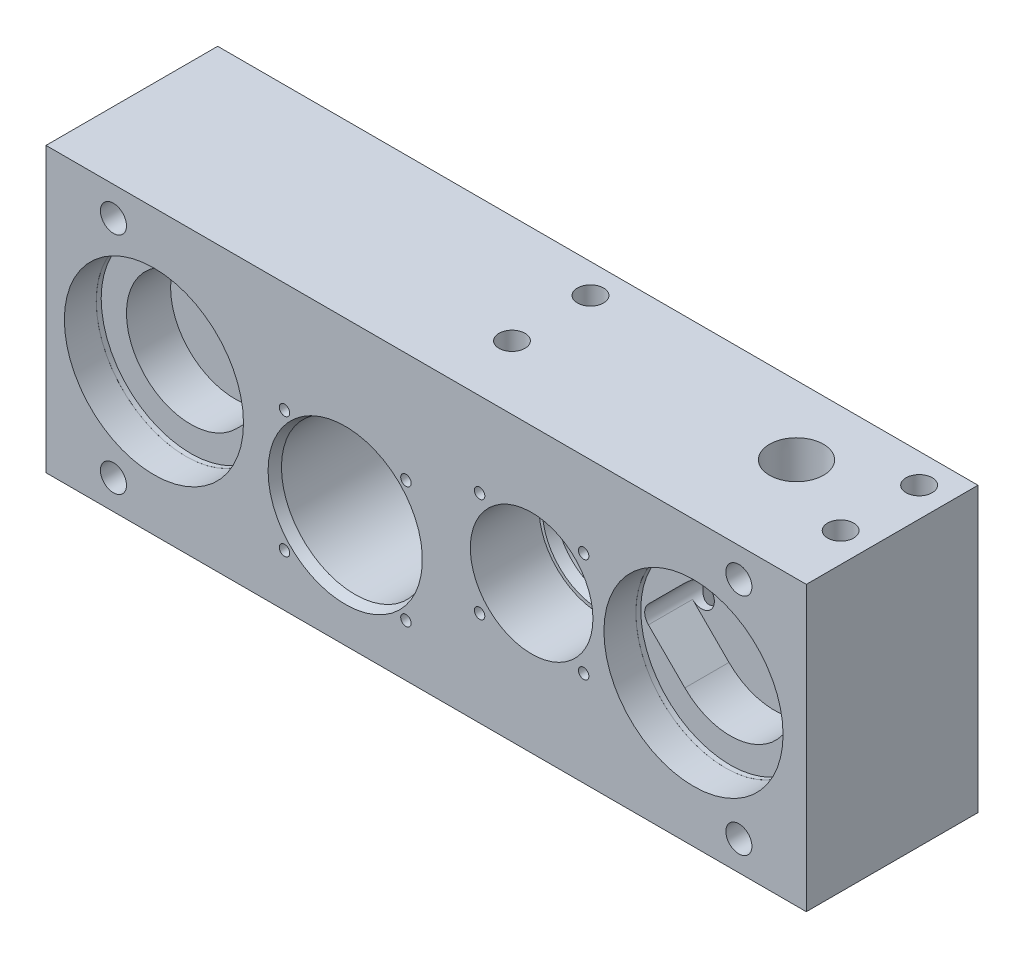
ISO-10303-21;
HEADER;
FILE_DESCRIPTION(('STEP AP214'),'2;1');
FILE_NAME('part.step','',(''),(''),'','','');
FILE_SCHEMA(('AUTOMOTIVE_DESIGN { 1 0 10303 214 1 1 1 1 }'));
ENDSEC;
DATA;
#1=APPLICATION_CONTEXT('core data for automotive mechanical design processes');
#2=APPLICATION_PROTOCOL_DEFINITION('international standard','automotive_design',2000,#1);
#3=PRODUCT_CONTEXT('',#1,'mechanical');
#4=PRODUCT('Part','Part','',(#3));
#5=PRODUCT_RELATED_PRODUCT_CATEGORY('part','',(#4));
#6=PRODUCT_DEFINITION_FORMATION('','',#4);
#7=PRODUCT_DEFINITION_CONTEXT('part definition',#1,'design');
#8=PRODUCT_DEFINITION('design','',#6,#7);
#9=PRODUCT_DEFINITION_SHAPE('','',#8);
#10=(LENGTH_UNIT() NAMED_UNIT(*) SI_UNIT(.MILLI.,.METRE.));
#11=(NAMED_UNIT(*) PLANE_ANGLE_UNIT() SI_UNIT($,.RADIAN.));
#12=(NAMED_UNIT(*) SI_UNIT($,.STERADIAN.) SOLID_ANGLE_UNIT());
#13=UNCERTAINTY_MEASURE_WITH_UNIT(LENGTH_MEASURE(1.E-05),#10,'distance_accuracy_value','');
#14=(GEOMETRIC_REPRESENTATION_CONTEXT(3) GLOBAL_UNCERTAINTY_ASSIGNED_CONTEXT((#13)) GLOBAL_UNIT_ASSIGNED_CONTEXT((#10,
#11,#12)) REPRESENTATION_CONTEXT('',''));
#15=CARTESIAN_POINT('',(0.,0.,0.));
#16=DIRECTION('',(0.,0.,1.));
#17=DIRECTION('',(1.,0.,0.));
#18=AXIS2_PLACEMENT_3D('',#15,#16,#17);
#19=CARTESIAN_POINT('',(0.,0.,23.495));
#20=DIRECTION('',(0.,0.,1.));
#21=DIRECTION('',(1.,0.,0.));
#22=AXIS2_PLACEMENT_3D('',#19,#20,#21);
#23=PLANE('',#22);
#24=CARTESIAN_POINT('',(27.94,36.703,23.495));
#25=DIRECTION('',(0.,0.,1.));
#26=DIRECTION('',(1.,0.,0.));
#27=AXIS2_PLACEMENT_3D('',#24,#25,#26);
#28=CIRCLE('',#27,4.7625);
#29=CARTESIAN_POINT('',(32.7025,36.703,23.495));
#30=VERTEX_POINT('',#29);
#31=EDGE_CURVE('E1867',#30,#30,#28,.T.);
#32=ORIENTED_EDGE('',*,*,#31,.F.);
#33=EDGE_LOOP('',(#32));
#34=FACE_BOUND('',#33,.T.);
#35=DIRECTION('',(-0.707106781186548,-0.707106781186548,0.));
#36=VECTOR('',#35,1.);
#37=CARTESIAN_POINT('',(49.1334044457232,34.368133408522,23.495));
#38=LINE('',#37,#36);
#39=CARTESIAN_POINT('',(49.1334044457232,34.368133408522,23.495));
#40=VERTEX_POINT('',#39);
#41=CARTESIAN_POINT('',(39.7041355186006,24.9388644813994,23.495));
#42=VERTEX_POINT('',#41);
#43=EDGE_CURVE('E517',#40,#42,#38,.T.);
#44=ORIENTED_EDGE('',*,*,#43,.F.);
#45=CARTESIAN_POINT('',(46.7985378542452,36.703,23.495));
#46=DIRECTION('',(0.,0.,1.));
#47=DIRECTION('',(1.,0.,0.));
#48=AXIS2_PLACEMENT_3D('',#45,#46,#47);
#49=CIRCLE('',#48,3.30200000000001);
#50=CARTESIAN_POINT('',(49.1334044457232,39.037866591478,23.495));
#51=VERTEX_POINT('',#50);
#52=EDGE_CURVE('E1863',#40,#51,#49,.F.);
#53=ORIENTED_EDGE('',*,*,#52,.T.);
#54=DIRECTION('',(0.707106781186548,-0.707106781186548,0.));
#55=VECTOR('',#54,1.);
#56=CARTESIAN_POINT('',(39.7041355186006,48.4671355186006,23.495));
#57=LINE('',#56,#55);
#58=CARTESIAN_POINT('',(39.7041355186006,48.4671355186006,23.495));
#59=VERTEX_POINT('',#58);
#60=EDGE_CURVE('E514',#59,#51,#57,.T.);
#61=ORIENTED_EDGE('',*,*,#60,.F.);
#62=CARTESIAN_POINT('',(27.94,36.703,23.495));
#63=DIRECTION('',(0.,0.,1.));
#64=DIRECTION('',(1.,0.,0.));
#65=AXIS2_PLACEMENT_3D('',#62,#63,#64);
#66=CIRCLE('',#65,16.637);
#67=EDGE_CURVE('E531',#42,#59,#66,.F.);
#68=ORIENTED_EDGE('',*,*,#67,.F.);
#69=EDGE_LOOP('',(#44,#53,#61,#68));
#70=FACE_BOUND('',#69,.T.);
#71=ADVANCED_FACE('F230',(#34,#70),#23,.T.);
#72=CARTESIAN_POINT('',(120.65,0.,17.78));
#73=DIRECTION('',(0.,-1.,0.));
#74=DIRECTION('',(0.,0.,-1.));
#75=AXIS2_PLACEMENT_3D('',#72,#73,#74);
#76=CYLINDRICAL_SURFACE('',#75,3.175);
#77=CARTESIAN_POINT('',(120.65,0.,17.78));
#78=DIRECTION('',(0.,-1.,0.));
#79=DIRECTION('',(0.,0.,-1.));
#80=AXIS2_PLACEMENT_3D('',#77,#78,#79);
#81=CIRCLE('',#80,3.175);
#82=CARTESIAN_POINT('',(120.65,0.,14.605));
#83=VERTEX_POINT('',#82);
#84=EDGE_CURVE('E1944',#83,#83,#81,.T.);
#85=ORIENTED_EDGE('',*,*,#84,.T.);
#86=EDGE_LOOP('',(#85));
#87=FACE_BOUND('',#86,.T.);
#88=CARTESIAN_POINT('',(120.65,16.51,17.78));
#89=DIRECTION('',(0.,-0.707106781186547,-0.707106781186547));
#90=DIRECTION('',(0.,-0.707106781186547,0.707106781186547));
#91=AXIS2_PLACEMENT_3D('',#88,#89,#90);
#92=ELLIPSE('',#91,4.49012806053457,3.17499999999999);
#93=CARTESIAN_POINT('',(117.475,16.51,17.78));
#94=VERTEX_POINT('',#93);
#95=CARTESIAN_POINT('',(120.65,13.335,20.955));
#96=VERTEX_POINT('',#95);
#97=EDGE_CURVE('E765',#94,#96,#92,.F.);
#98=ORIENTED_EDGE('',*,*,#97,.T.);
#99=CARTESIAN_POINT('',(123.825,16.51,17.78));
#100=VERTEX_POINT('',#99);
#101=EDGE_CURVE('E769',#96,#100,#92,.F.);
#102=ORIENTED_EDGE('',*,*,#101,.T.);
#103=CARTESIAN_POINT('',(120.65,16.51,17.78));
#104=DIRECTION('',(0.,-0.707106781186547,0.707106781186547));
#105=DIRECTION('',(0.,-0.707106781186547,-0.707106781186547));
#106=AXIS2_PLACEMENT_3D('',#103,#104,#105);
#107=ELLIPSE('',#106,4.49012806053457,3.17499999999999);
#108=EDGE_CURVE('E742',#100,#94,#107,.F.);
#109=ORIENTED_EDGE('',*,*,#108,.T.);
#110=EDGE_LOOP('',(#98,#102,#109));
#111=FACE_BOUND('',#110,.T.);
#112=ADVANCED_FACE('F882',(#87,#111),#76,.F.);
#113=CARTESIAN_POINT('',(125.73,38.1,0.));
#114=DIRECTION('',(0.,0.,1.));
#115=DIRECTION('',(1.,0.,0.));
#116=AXIS2_PLACEMENT_3D('',#113,#114,#115);
#117=CYLINDRICAL_SURFACE('',#116,14.0716);
#118=CARTESIAN_POINT('',(125.73,38.1,24.1300000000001));
#119=DIRECTION('',(0.,0.,1.));
#120=DIRECTION('',(1.,0.,0.));
#121=AXIS2_PLACEMENT_3D('',#118,#119,#120);
#122=CIRCLE('',#121,14.0716);
#123=CARTESIAN_POINT('',(139.8016,38.1,24.1300000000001));
#124=VERTEX_POINT('',#123);
#125=EDGE_CURVE('E13',#124,#124,#122,.T.);
#126=ORIENTED_EDGE('',*,*,#125,.T.);
#127=EDGE_LOOP('',(#126));
#128=FACE_BOUND('',#127,.T.);
#129=CARTESIAN_POINT('',(125.73,38.1,0.));
#130=DIRECTION('',(0.,0.,1.));
#131=DIRECTION('',(1.,0.,0.));
#132=AXIS2_PLACEMENT_3D('',#129,#130,#131);
#133=CIRCLE('',#132,14.0716);
#134=CARTESIAN_POINT('',(139.8016,38.1,0.));
#135=VERTEX_POINT('',#134);
#136=EDGE_CURVE('E540',#135,#135,#133,.T.);
#137=ORIENTED_EDGE('',*,*,#136,.F.);
#138=EDGE_LOOP('',(#137));
#139=FACE_BOUND('',#138,.T.);
#140=ADVANCED_FACE('F890',(#128,#139),#117,.F.);
#141=CARTESIAN_POINT('',(0.,0.,0.));
#142=DIRECTION('',(0.,0.,-1.));
#143=DIRECTION('',(-1.,0.,0.));
#144=AXIS2_PLACEMENT_3D('',#141,#142,#143);
#145=PLANE('',#144);
#146=CARTESIAN_POINT('',(155.574999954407,31.75,0.));
#147=DIRECTION('',(0.,0.,-1.));
#148=DIRECTION('',(-1.,0.,0.));
#149=AXIS2_PLACEMENT_3D('',#146,#147,#148);
#150=CIRCLE('',#149,27.5336);
#151=CARTESIAN_POINT('',(155.574999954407,4.21639999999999,0.));
#152=VERTEX_POINT('',#151);
#153=CARTESIAN_POINT('',(155.574999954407,59.2836,0.));
#154=VERTEX_POINT('',#153);
#155=EDGE_CURVE('E797',#152,#154,#150,.F.);
#156=ORIENTED_EDGE('',*,*,#155,.T.);
#157=DIRECTION('',(1.,0.,0.));
#158=VECTOR('',#157,1.);
#159=CARTESIAN_POINT('',(0.,59.2836,0.));
#160=LINE('',#159,#158);
#161=CARTESIAN_POINT('',(41.2749999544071,59.2836,0.));
#162=VERTEX_POINT('',#161);
#163=EDGE_CURVE('E806',#154,#162,#160,.F.);
#164=ORIENTED_EDGE('',*,*,#163,.T.);
#165=CARTESIAN_POINT('',(41.2749999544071,31.75,0.));
#166=DIRECTION('',(0.,0.,-1.));
#167=DIRECTION('',(-1.,0.,0.));
#168=AXIS2_PLACEMENT_3D('',#165,#166,#167);
#169=CIRCLE('',#168,27.5336);
#170=CARTESIAN_POINT('',(41.2749999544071,4.2164,0.));
#171=VERTEX_POINT('',#170);
#172=EDGE_CURVE('E803',#162,#171,#169,.F.);
#173=ORIENTED_EDGE('',*,*,#172,.T.);
#174=DIRECTION('',(-1.,0.,0.));
#175=VECTOR('',#174,1.);
#176=CARTESIAN_POINT('',(0.,4.2164,0.));
#177=LINE('',#176,#175);
#178=EDGE_CURVE('E800',#171,#152,#177,.F.);
#179=ORIENTED_EDGE('',*,*,#178,.T.);
#180=EDGE_LOOP('',(#156,#164,#173,#179));
#181=FACE_BOUND('',#180,.T.);
#182=DIRECTION('',(0.,-1.,0.));
#183=VECTOR('',#182,1.);
#184=CARTESIAN_POINT('',(0.,0.,0.));
#185=LINE('',#184,#183);
#186=CARTESIAN_POINT('',(0.,73.406,0.));
#187=VERTEX_POINT('',#186);
#188=CARTESIAN_POINT('',(0.,0.,0.));
#189=VERTEX_POINT('',#188);
#190=EDGE_CURVE('E597',#187,#189,#185,.T.);
#191=ORIENTED_EDGE('',*,*,#190,.F.);
#192=DIRECTION('',(-1.,0.,0.));
#193=VECTOR('',#192,1.);
#194=CARTESIAN_POINT('',(0.,73.406,0.));
#195=LINE('',#194,#193);
#196=CARTESIAN_POINT('',(196.85,73.406,0.));
#197=VERTEX_POINT('',#196);
#198=EDGE_CURVE('E603',#197,#187,#195,.T.);
#199=ORIENTED_EDGE('',*,*,#198,.F.);
#200=DIRECTION('',(0.,1.,0.));
#201=VECTOR('',#200,1.);
#202=CARTESIAN_POINT('',(196.85,0.,0.));
#203=LINE('',#202,#201);
#204=CARTESIAN_POINT('',(196.85,0.,0.));
#205=VERTEX_POINT('',#204);
#206=EDGE_CURVE('E619',#205,#197,#203,.T.);
#207=ORIENTED_EDGE('',*,*,#206,.F.);
#208=DIRECTION('',(1.,0.,0.));
#209=VECTOR('',#208,1.);
#210=CARTESIAN_POINT('',(0.,0.,0.));
#211=LINE('',#210,#209);
#212=EDGE_CURVE('E616',#189,#205,#211,.T.);
#213=ORIENTED_EDGE('',*,*,#212,.F.);
#214=EDGE_LOOP('',(#191,#199,#207,#213));
#215=FACE_BOUND('',#214,.T.);
#216=CARTESIAN_POINT('',(179.3875,65.786,0.));
#217=DIRECTION('',(0.,0.,1.));
#218=DIRECTION('',(1.,0.,0.));
#219=AXIS2_PLACEMENT_3D('',#216,#217,#218);
#220=CIRCLE('',#219,3.3782);
#221=CARTESIAN_POINT('',(182.7657,65.786,0.));
#222=VERTEX_POINT('',#221);
#223=EDGE_CURVE('E593',#222,#222,#220,.T.);
#224=ORIENTED_EDGE('',*,*,#223,.T.);
#225=EDGE_LOOP('',(#224));
#226=FACE_BOUND('',#225,.T.);
#227=CARTESIAN_POINT('',(179.3875,7.62,0.));
#228=DIRECTION('',(0.,0.,1.));
#229=DIRECTION('',(1.,0.,0.));
#230=AXIS2_PLACEMENT_3D('',#227,#228,#229);
#231=CIRCLE('',#230,3.3782);
#232=CARTESIAN_POINT('',(182.7657,7.62,0.));
#233=VERTEX_POINT('',#232);
#234=EDGE_CURVE('E585',#233,#233,#231,.T.);
#235=ORIENTED_EDGE('',*,*,#234,.T.);
#236=EDGE_LOOP('',(#235));
#237=FACE_BOUND('',#236,.T.);
#238=CARTESIAN_POINT('',(17.4625,7.62,0.));
#239=DIRECTION('',(0.,0.,1.));
#240=DIRECTION('',(1.,0.,0.));
#241=AXIS2_PLACEMENT_3D('',#238,#239,#240);
#242=CIRCLE('',#241,3.37819999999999);
#243=CARTESIAN_POINT('',(20.8407,7.62,0.));
#244=VERTEX_POINT('',#243);
#245=EDGE_CURVE('E577',#244,#244,#242,.T.);
#246=ORIENTED_EDGE('',*,*,#245,.T.);
#247=EDGE_LOOP('',(#246));
#248=FACE_BOUND('',#247,.T.);
#249=CARTESIAN_POINT('',(17.4625,65.786,0.));
#250=DIRECTION('',(0.,0.,1.));
#251=DIRECTION('',(1.,0.,0.));
#252=AXIS2_PLACEMENT_3D('',#249,#250,#251);
#253=CIRCLE('',#252,3.37819999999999);
#254=CARTESIAN_POINT('',(20.8407,65.786,0.));
#255=VERTEX_POINT('',#254);
#256=EDGE_CURVE('E569',#255,#255,#253,.T.);
#257=ORIENTED_EDGE('',*,*,#256,.T.);
#258=EDGE_LOOP('',(#257));
#259=FACE_BOUND('',#258,.T.);
#260=ADVANCED_FACE('F910',(#181,#215,#226,#237,#248,#259),#145,.T.);
#261=CARTESIAN_POINT('',(0.,0.,44.45));
#262=DIRECTION('',(1.,0.,0.));
#263=DIRECTION('',(0.,0.,-1.));
#264=AXIS2_PLACEMENT_3D('',#261,#262,#263);
#265=PLANE('',#264);
#266=ORIENTED_EDGE('',*,*,#190,.T.);
#267=DIRECTION('',(0.,0.,-1.));
#268=VECTOR('',#267,1.);
#269=CARTESIAN_POINT('',(0.,0.,44.45));
#270=LINE('',#269,#268);
#271=CARTESIAN_POINT('',(0.,0.,44.45));
#272=VERTEX_POINT('',#271);
#273=EDGE_CURVE('E635',#272,#189,#270,.T.);
#274=ORIENTED_EDGE('',*,*,#273,.F.);
#275=DIRECTION('',(0.,-1.,0.));
#276=VECTOR('',#275,1.);
#277=CARTESIAN_POINT('',(0.,0.,44.45));
#278=LINE('',#277,#276);
#279=CARTESIAN_POINT('',(0.,73.406,44.45));
#280=VERTEX_POINT('',#279);
#281=EDGE_CURVE('E598',#280,#272,#278,.T.);
#282=ORIENTED_EDGE('',*,*,#281,.F.);
#283=DIRECTION('',(0.,0.,-1.));
#284=VECTOR('',#283,1.);
#285=CARTESIAN_POINT('',(0.,73.406,44.45));
#286=LINE('',#285,#284);
#287=EDGE_CURVE('E612',#280,#187,#286,.T.);
#288=ORIENTED_EDGE('',*,*,#287,.T.);
#289=EDGE_LOOP('',(#266,#274,#282,#288));
#290=FACE_BOUND('',#289,.T.);
#291=ADVANCED_FACE('F973',(#290),#265,.F.);
#292=CARTESIAN_POINT('',(0.,0.,44.45));
#293=DIRECTION('',(0.,1.,0.));
#294=DIRECTION('',(0.,0.,1.));
#295=AXIS2_PLACEMENT_3D('',#292,#293,#294);
#296=PLANE('',#295);
#297=ORIENTED_EDGE('',*,*,#84,.F.);
#298=EDGE_LOOP('',(#297));
#299=FACE_BOUND('',#298,.T.);
#300=CARTESIAN_POINT('',(189.23,0.,7.62));
#301=DIRECTION('',(0.,-1.,0.));
#302=DIRECTION('',(0.,0.,-1.));
#303=AXIS2_PLACEMENT_3D('',#300,#301,#302);
#304=CIRCLE('',#303,3.3782);
#305=CARTESIAN_POINT('',(189.23,0.,4.2418));
#306=VERTEX_POINT('',#305);
#307=EDGE_CURVE('E1953',#306,#306,#304,.T.);
#308=ORIENTED_EDGE('',*,*,#307,.F.);
#309=EDGE_LOOP('',(#308));
#310=FACE_BOUND('',#309,.T.);
#311=CARTESIAN_POINT('',(189.23,0.,27.94));
#312=DIRECTION('',(0.,-1.,0.));
#313=DIRECTION('',(0.,0.,-1.));
#314=AXIS2_PLACEMENT_3D('',#311,#312,#313);
#315=CIRCLE('',#314,3.3782);
#316=CARTESIAN_POINT('',(189.23,0.,24.5618));
#317=VERTEX_POINT('',#316);
#318=EDGE_CURVE('E1965',#317,#317,#315,.T.);
#319=ORIENTED_EDGE('',*,*,#318,.F.);
#320=EDGE_LOOP('',(#319));
#321=FACE_BOUND('',#320,.T.);
#322=CARTESIAN_POINT('',(104.14,0.,7.62));
#323=DIRECTION('',(0.,-1.,0.));
#324=DIRECTION('',(0.,0.,-1.));
#325=AXIS2_PLACEMENT_3D('',#322,#323,#324);
#326=CIRCLE('',#325,3.3782);
#327=CARTESIAN_POINT('',(104.14,0.,4.2418));
#328=VERTEX_POINT('',#327);
#329=EDGE_CURVE('E1973',#328,#328,#326,.T.);
#330=ORIENTED_EDGE('',*,*,#329,.F.);
#331=EDGE_LOOP('',(#330));
#332=FACE_BOUND('',#331,.T.);
#333=CARTESIAN_POINT('',(104.14,0.,27.94));
#334=DIRECTION('',(0.,-1.,0.));
#335=DIRECTION('',(0.,0.,-1.));
#336=AXIS2_PLACEMENT_3D('',#333,#334,#335);
#337=CIRCLE('',#336,3.3782);
#338=CARTESIAN_POINT('',(104.14,0.,24.5618));
#339=VERTEX_POINT('',#338);
#340=EDGE_CURVE('E1981',#339,#339,#337,.T.);
#341=ORIENTED_EDGE('',*,*,#340,.F.);
#342=EDGE_LOOP('',(#341));
#343=FACE_BOUND('',#342,.T.);
#344=CARTESIAN_POINT('',(148.781462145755,0.,17.78));
#345=DIRECTION('',(0.,1.,0.));
#346=DIRECTION('',(0.,0.,1.));
#347=AXIS2_PLACEMENT_3D('',#344,#345,#346);
#348=CIRCLE('',#347,3.81000000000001);
#349=CARTESIAN_POINT('',(148.781462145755,0.,21.59));
#350=VERTEX_POINT('',#349);
#351=EDGE_CURVE('E1991',#350,#350,#348,.T.);
#352=ORIENTED_EDGE('',*,*,#351,.T.);
#353=EDGE_LOOP('',(#352));
#354=FACE_BOUND('',#353,.T.);
#355=ORIENTED_EDGE('',*,*,#212,.T.);
#356=DIRECTION('',(0.,0.,-1.));
#357=VECTOR('',#356,1.);
#358=CARTESIAN_POINT('',(196.85,0.,44.45));
#359=LINE('',#358,#357);
#360=CARTESIAN_POINT('',(196.85,0.,44.45));
#361=VERTEX_POINT('',#360);
#362=EDGE_CURVE('E631',#361,#205,#359,.T.);
#363=ORIENTED_EDGE('',*,*,#362,.F.);
#364=DIRECTION('',(1.,0.,0.));
#365=VECTOR('',#364,1.);
#366=CARTESIAN_POINT('',(0.,0.,44.45));
#367=LINE('',#366,#365);
#368=EDGE_CURVE('E602',#272,#361,#367,.T.);
#369=ORIENTED_EDGE('',*,*,#368,.F.);
#370=ORIENTED_EDGE('',*,*,#273,.T.);
#371=EDGE_LOOP('',(#355,#363,#369,#370));
#372=FACE_BOUND('',#371,.T.);
#373=ADVANCED_FACE('F969',(#299,#310,#321,#332,#343,#354,#372),#296,.F.);
#374=CARTESIAN_POINT('',(196.85,0.,44.45));
#375=DIRECTION('',(-1.,0.,0.));
#376=DIRECTION('',(0.,0.,1.));
#377=AXIS2_PLACEMENT_3D('',#374,#375,#376);
#378=PLANE('',#377);
#379=ORIENTED_EDGE('',*,*,#206,.T.);
#380=DIRECTION('',(0.,0.,-1.));
#381=VECTOR('',#380,1.);
#382=CARTESIAN_POINT('',(196.85,73.406,44.45));
#383=LINE('',#382,#381);
#384=CARTESIAN_POINT('',(196.85,73.406,44.45));
#385=VERTEX_POINT('',#384);
#386=EDGE_CURVE('E627',#385,#197,#383,.T.);
#387=ORIENTED_EDGE('',*,*,#386,.F.);
#388=DIRECTION('',(0.,1.,0.));
#389=VECTOR('',#388,1.);
#390=CARTESIAN_POINT('',(196.85,0.,44.45));
#391=LINE('',#390,#389);
#392=EDGE_CURVE('E606',#361,#385,#391,.T.);
#393=ORIENTED_EDGE('',*,*,#392,.F.);
#394=ORIENTED_EDGE('',*,*,#362,.T.);
#395=EDGE_LOOP('',(#379,#387,#393,#394));
#396=FACE_BOUND('',#395,.T.);
#397=ADVANCED_FACE('F965',(#396),#378,.F.);
#398=CARTESIAN_POINT('',(0.,73.406,44.45));
#399=DIRECTION('',(0.,-1.,0.));
#400=DIRECTION('',(0.,0.,-1.));
#401=AXIS2_PLACEMENT_3D('',#398,#399,#400);
#402=PLANE('',#401);
#403=CARTESIAN_POINT('',(167.64,73.406,17.78));
#404=DIRECTION('',(0.,1.,0.));
#405=DIRECTION('',(0.,0.,1.));
#406=AXIS2_PLACEMENT_3D('',#403,#404,#405);
#407=CIRCLE('',#406,6.98047879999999);
#408=CARTESIAN_POINT('',(167.64,73.406,24.7604788));
#409=VERTEX_POINT('',#408);
#410=EDGE_CURVE('E2379',#409,#409,#407,.T.);
#411=ORIENTED_EDGE('',*,*,#410,.F.);
#412=EDGE_LOOP('',(#411));
#413=FACE_BOUND('',#412,.T.);
#414=CARTESIAN_POINT('',(189.23,73.406,7.62));
#415=DIRECTION('',(0.,-1.,0.));
#416=DIRECTION('',(0.,0.,-1.));
#417=AXIS2_PLACEMENT_3D('',#414,#415,#416);
#418=CIRCLE('',#417,3.37819999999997);
#419=CARTESIAN_POINT('',(189.23,73.406,4.24180000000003));
#420=VERTEX_POINT('',#419);
#421=EDGE_CURVE('E1961',#420,#420,#418,.T.);
#422=ORIENTED_EDGE('',*,*,#421,.T.);
#423=EDGE_LOOP('',(#422));
#424=FACE_BOUND('',#423,.T.);
#425=CARTESIAN_POINT('',(189.23,73.406,27.94));
#426=DIRECTION('',(0.,-1.,0.));
#427=DIRECTION('',(0.,0.,-1.));
#428=AXIS2_PLACEMENT_3D('',#425,#426,#427);
#429=CIRCLE('',#428,3.37819999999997);
#430=CARTESIAN_POINT('',(189.23,73.406,24.5618));
#431=VERTEX_POINT('',#430);
#432=EDGE_CURVE('E1969',#431,#431,#429,.T.);
#433=ORIENTED_EDGE('',*,*,#432,.T.);
#434=EDGE_LOOP('',(#433));
#435=FACE_BOUND('',#434,.T.);
#436=CARTESIAN_POINT('',(104.14,73.406,7.62));
#437=DIRECTION('',(0.,-1.,0.));
#438=DIRECTION('',(0.,0.,-1.));
#439=AXIS2_PLACEMENT_3D('',#436,#437,#438);
#440=CIRCLE('',#439,3.37819999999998);
#441=CARTESIAN_POINT('',(104.14,73.406,4.24180000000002));
#442=VERTEX_POINT('',#441);
#443=EDGE_CURVE('E1977',#442,#442,#440,.T.);
#444=ORIENTED_EDGE('',*,*,#443,.T.);
#445=EDGE_LOOP('',(#444));
#446=FACE_BOUND('',#445,.T.);
#447=CARTESIAN_POINT('',(104.14,73.406,27.94));
#448=DIRECTION('',(0.,-1.,0.));
#449=DIRECTION('',(0.,0.,-1.));
#450=AXIS2_PLACEMENT_3D('',#447,#448,#449);
#451=CIRCLE('',#450,3.37819999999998);
#452=CARTESIAN_POINT('',(104.14,73.406,24.5618));
#453=VERTEX_POINT('',#452);
#454=EDGE_CURVE('E1985',#453,#453,#451,.T.);
#455=ORIENTED_EDGE('',*,*,#454,.T.);
#456=EDGE_LOOP('',(#455));
#457=FACE_BOUND('',#456,.T.);
#458=ORIENTED_EDGE('',*,*,#198,.T.);
#459=ORIENTED_EDGE('',*,*,#287,.F.);
#460=DIRECTION('',(-1.,0.,0.));
#461=VECTOR('',#460,1.);
#462=CARTESIAN_POINT('',(0.,73.406,44.45));
#463=LINE('',#462,#461);
#464=EDGE_CURVE('E609',#385,#280,#463,.T.);
#465=ORIENTED_EDGE('',*,*,#464,.F.);
#466=ORIENTED_EDGE('',*,*,#386,.T.);
#467=EDGE_LOOP('',(#458,#459,#465,#466));
#468=FACE_BOUND('',#467,.T.);
#469=ADVANCED_FACE('F956',(#413,#424,#435,#446,#457,#468),#402,.F.);
#470=CARTESIAN_POINT('',(0.,0.,44.45));
#471=DIRECTION('',(0.,0.,-1.));
#472=DIRECTION('',(-1.,0.,0.));
#473=AXIS2_PLACEMENT_3D('',#470,#471,#472);
#474=PLANE('',#473);
#475=CARTESIAN_POINT('',(77.47,29.21,44.45));
#476=DIRECTION('',(0.,0.,-1.));
#477=DIRECTION('',(-1.,0.,0.));
#478=AXIS2_PLACEMENT_3D('',#475,#476,#477);
#479=CIRCLE('',#478,19.9744843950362);
#480=CARTESIAN_POINT('',(57.4955156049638,29.21,44.45));
#481=VERTEX_POINT('',#480);
#482=EDGE_CURVE('E860',#481,#481,#479,.T.);
#483=ORIENTED_EDGE('',*,*,#482,.T.);
#484=EDGE_LOOP('',(#483));
#485=FACE_BOUND('',#484,.T.);
#486=CARTESIAN_POINT('',(139.200384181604,51.5703841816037,44.45));
#487=DIRECTION('',(0.,0.,1.));
#488=DIRECTION('',(1.,0.,0.));
#489=AXIS2_PLACEMENT_3D('',#486,#487,#488);
#490=CIRCLE('',#489,1.35254999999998);
#491=CARTESIAN_POINT('',(140.552934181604,51.5703841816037,44.45));
#492=VERTEX_POINT('',#491);
#493=EDGE_CURVE('E838',#492,#492,#490,.T.);
#494=ORIENTED_EDGE('',*,*,#493,.F.);
#495=EDGE_LOOP('',(#494));
#496=FACE_BOUND('',#495,.T.);
#497=CARTESIAN_POINT('',(112.259615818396,51.5703841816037,44.45));
#498=DIRECTION('',(0.,0.,1.));
#499=DIRECTION('',(1.,0.,0.));
#500=AXIS2_PLACEMENT_3D('',#497,#498,#499);
#501=CIRCLE('',#500,1.35254999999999);
#502=CARTESIAN_POINT('',(113.612165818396,51.5703841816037,44.45));
#503=VERTEX_POINT('',#502);
#504=EDGE_CURVE('E1883',#503,#503,#501,.T.);
#505=ORIENTED_EDGE('',*,*,#504,.F.);
#506=EDGE_LOOP('',(#505));
#507=FACE_BOUND('',#506,.T.);
#508=CARTESIAN_POINT('',(112.259615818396,24.6296158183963,44.45));
#509=DIRECTION('',(0.,0.,1.));
#510=DIRECTION('',(1.,0.,0.));
#511=AXIS2_PLACEMENT_3D('',#508,#509,#510);
#512=CIRCLE('',#511,1.35254999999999);
#513=CARTESIAN_POINT('',(113.612165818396,24.6296158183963,44.45));
#514=VERTEX_POINT('',#513);
#515=EDGE_CURVE('E1891',#514,#514,#512,.T.);
#516=ORIENTED_EDGE('',*,*,#515,.F.);
#517=EDGE_LOOP('',(#516));
#518=FACE_BOUND('',#517,.T.);
#519=CARTESIAN_POINT('',(139.200384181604,24.6296158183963,44.45));
#520=DIRECTION('',(0.,0.,1.));
#521=DIRECTION('',(1.,0.,0.));
#522=AXIS2_PLACEMENT_3D('',#519,#520,#521);
#523=CIRCLE('',#522,1.35254999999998);
#524=CARTESIAN_POINT('',(140.552934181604,24.6296158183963,44.45));
#525=VERTEX_POINT('',#524);
#526=EDGE_CURVE('E1899',#525,#525,#523,.T.);
#527=ORIENTED_EDGE('',*,*,#526,.F.);
#528=EDGE_LOOP('',(#527));
#529=FACE_BOUND('',#528,.T.);
#530=CARTESIAN_POINT('',(61.754551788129,44.925448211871,44.45));
#531=DIRECTION('',(0.,0.,1.));
#532=DIRECTION('',(1.,0.,0.));
#533=AXIS2_PLACEMENT_3D('',#530,#531,#532);
#534=CIRCLE('',#533,1.35254999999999);
#535=CARTESIAN_POINT('',(63.107101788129,44.925448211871,44.45));
#536=VERTEX_POINT('',#535);
#537=EDGE_CURVE('E1907',#536,#536,#534,.T.);
#538=ORIENTED_EDGE('',*,*,#537,.F.);
#539=EDGE_LOOP('',(#538));
#540=FACE_BOUND('',#539,.T.);
#541=CARTESIAN_POINT('',(93.185448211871,13.494551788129,44.45));
#542=DIRECTION('',(0.,0.,1.));
#543=DIRECTION('',(1.,0.,0.));
#544=AXIS2_PLACEMENT_3D('',#541,#542,#543);
#545=CIRCLE('',#544,1.35254999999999);
#546=CARTESIAN_POINT('',(94.537998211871,13.494551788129,44.45));
#547=VERTEX_POINT('',#546);
#548=EDGE_CURVE('E1915',#547,#547,#545,.T.);
#549=ORIENTED_EDGE('',*,*,#548,.F.);
#550=EDGE_LOOP('',(#549));
#551=FACE_BOUND('',#550,.T.);
#552=CARTESIAN_POINT('',(93.185448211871,44.925448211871,44.45));
#553=DIRECTION('',(0.,0.,1.));
#554=DIRECTION('',(1.,0.,0.));
#555=AXIS2_PLACEMENT_3D('',#552,#553,#554);
#556=CIRCLE('',#555,1.35254999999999);
#557=CARTESIAN_POINT('',(94.537998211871,44.925448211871,44.45));
#558=VERTEX_POINT('',#557);
#559=EDGE_CURVE('E1923',#558,#558,#556,.T.);
#560=ORIENTED_EDGE('',*,*,#559,.F.);
#561=EDGE_LOOP('',(#560));
#562=FACE_BOUND('',#561,.T.);
#563=CARTESIAN_POINT('',(61.754551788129,13.494551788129,44.45));
#564=DIRECTION('',(0.,0.,1.));
#565=DIRECTION('',(1.,0.,0.));
#566=AXIS2_PLACEMENT_3D('',#563,#564,#565);
#567=CIRCLE('',#566,1.35254999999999);
#568=CARTESIAN_POINT('',(63.107101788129,13.494551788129,44.45));
#569=VERTEX_POINT('',#568);
#570=EDGE_CURVE('E1931',#569,#569,#567,.T.);
#571=ORIENTED_EDGE('',*,*,#570,.F.);
#572=EDGE_LOOP('',(#571));
#573=FACE_BOUND('',#572,.T.);
#574=CARTESIAN_POINT('',(27.94,36.703,44.45));
#575=DIRECTION('',(0.,0.,1.));
#576=DIRECTION('',(1.,0.,0.));
#577=AXIS2_PLACEMENT_3D('',#574,#575,#576);
#578=CIRCLE('',#577,23.1902);
#579=CARTESIAN_POINT('',(51.1302,36.703,44.45));
#580=VERTEX_POINT('',#579);
#581=EDGE_CURVE('E2023',#580,#580,#578,.T.);
#582=ORIENTED_EDGE('',*,*,#581,.F.);
#583=EDGE_LOOP('',(#582));
#584=FACE_BOUND('',#583,.T.);
#585=CARTESIAN_POINT('',(167.64,36.703,44.45));
#586=DIRECTION('',(0.,0.,1.));
#587=DIRECTION('',(1.,0.,0.));
#588=AXIS2_PLACEMENT_3D('',#585,#586,#587);
#589=CIRCLE('',#588,23.1902);
#590=CARTESIAN_POINT('',(190.8302,36.703,44.45));
#591=VERTEX_POINT('',#590);
#592=EDGE_CURVE('E2027',#591,#591,#589,.T.);
#593=ORIENTED_EDGE('',*,*,#592,.F.);
#594=EDGE_LOOP('',(#593));
#595=FACE_BOUND('',#594,.T.);
#596=CARTESIAN_POINT('',(125.73,38.1,44.45));
#597=DIRECTION('',(0.,0.,1.));
#598=DIRECTION('',(1.,0.,0.));
#599=AXIS2_PLACEMENT_3D('',#596,#597,#598);
#600=CIRCLE('',#599,15.875);
#601=CARTESIAN_POINT('',(141.605,38.1,44.45));
#602=VERTEX_POINT('',#601);
#603=EDGE_CURVE('E496',#602,#602,#600,.T.);
#604=ORIENTED_EDGE('',*,*,#603,.F.);
#605=EDGE_LOOP('',(#604));
#606=FACE_BOUND('',#605,.T.);
#607=CARTESIAN_POINT('',(17.4625,65.786,44.45));
#608=DIRECTION('',(0.,0.,1.));
#609=DIRECTION('',(1.,0.,0.));
#610=AXIS2_PLACEMENT_3D('',#607,#608,#609);
#611=CIRCLE('',#610,3.37819999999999);
#612=CARTESIAN_POINT('',(20.8407,65.786,44.45));
#613=VERTEX_POINT('',#612);
#614=EDGE_CURVE('E565',#613,#613,#611,.T.);
#615=ORIENTED_EDGE('',*,*,#614,.F.);
#616=EDGE_LOOP('',(#615));
#617=FACE_BOUND('',#616,.T.);
#618=CARTESIAN_POINT('',(17.4625,7.62,44.45));
#619=DIRECTION('',(0.,0.,1.));
#620=DIRECTION('',(1.,0.,0.));
#621=AXIS2_PLACEMENT_3D('',#618,#619,#620);
#622=CIRCLE('',#621,3.37819999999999);
#623=CARTESIAN_POINT('',(20.8407,7.62,44.45));
#624=VERTEX_POINT('',#623);
#625=EDGE_CURVE('E573',#624,#624,#622,.T.);
#626=ORIENTED_EDGE('',*,*,#625,.F.);
#627=EDGE_LOOP('',(#626));
#628=FACE_BOUND('',#627,.T.);
#629=CARTESIAN_POINT('',(179.3875,7.62,44.45));
#630=DIRECTION('',(0.,0.,1.));
#631=DIRECTION('',(1.,0.,0.));
#632=AXIS2_PLACEMENT_3D('',#629,#630,#631);
#633=CIRCLE('',#632,3.3782);
#634=CARTESIAN_POINT('',(182.7657,7.62,44.45));
#635=VERTEX_POINT('',#634);
#636=EDGE_CURVE('E581',#635,#635,#633,.T.);
#637=ORIENTED_EDGE('',*,*,#636,.F.);
#638=EDGE_LOOP('',(#637));
#639=FACE_BOUND('',#638,.T.);
#640=CARTESIAN_POINT('',(179.3875,65.786,44.45));
#641=DIRECTION('',(0.,0.,1.));
#642=DIRECTION('',(1.,0.,0.));
#643=AXIS2_PLACEMENT_3D('',#640,#641,#642);
#644=CIRCLE('',#643,3.3782);
#645=CARTESIAN_POINT('',(182.7657,65.786,44.45));
#646=VERTEX_POINT('',#645);
#647=EDGE_CURVE('E589',#646,#646,#644,.T.);
#648=ORIENTED_EDGE('',*,*,#647,.F.);
#649=EDGE_LOOP('',(#648));
#650=FACE_BOUND('',#649,.T.);
#651=ORIENTED_EDGE('',*,*,#281,.T.);
#652=ORIENTED_EDGE('',*,*,#368,.T.);
#653=ORIENTED_EDGE('',*,*,#392,.T.);
#654=ORIENTED_EDGE('',*,*,#464,.T.);
#655=EDGE_LOOP('',(#651,#652,#653,#654));
#656=FACE_BOUND('',#655,.T.);
#657=ADVANCED_FACE('F952',(#485,#496,#507,#518,#529,#540,#551,#562,#573,#584,#595,#606,#617,
#628,#639,#650,#656),#474,.F.);
#658=CARTESIAN_POINT('',(179.3875,65.786,44.45));
#659=DIRECTION('',(0.,0.,1.));
#660=DIRECTION('',(1.,0.,0.));
#661=AXIS2_PLACEMENT_3D('',#658,#659,#660);
#662=CYLINDRICAL_SURFACE('',#661,3.3782);
#663=ORIENTED_EDGE('',*,*,#223,.F.);
#664=EDGE_LOOP('',(#663));
#665=FACE_BOUND('',#664,.T.);
#666=ORIENTED_EDGE('',*,*,#647,.T.);
#667=EDGE_LOOP('',(#666));
#668=FACE_BOUND('',#667,.T.);
#669=ADVANCED_FACE('F948',(#665,#668),#662,.F.);
#670=CARTESIAN_POINT('',(179.3875,7.62,44.45));
#671=DIRECTION('',(0.,0.,1.));
#672=DIRECTION('',(1.,0.,0.));
#673=AXIS2_PLACEMENT_3D('',#670,#671,#672);
#674=CYLINDRICAL_SURFACE('',#673,3.3782);
#675=ORIENTED_EDGE('',*,*,#234,.F.);
#676=EDGE_LOOP('',(#675));
#677=FACE_BOUND('',#676,.T.);
#678=ORIENTED_EDGE('',*,*,#636,.T.);
#679=EDGE_LOOP('',(#678));
#680=FACE_BOUND('',#679,.T.);
#681=ADVANCED_FACE('F944',(#677,#680),#674,.F.);
#682=CARTESIAN_POINT('',(17.4625,7.62,44.45));
#683=DIRECTION('',(0.,0.,1.));
#684=DIRECTION('',(1.,0.,0.));
#685=AXIS2_PLACEMENT_3D('',#682,#683,#684);
#686=CYLINDRICAL_SURFACE('',#685,3.37819999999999);
#687=ORIENTED_EDGE('',*,*,#245,.F.);
#688=EDGE_LOOP('',(#687));
#689=FACE_BOUND('',#688,.T.);
#690=ORIENTED_EDGE('',*,*,#625,.T.);
#691=EDGE_LOOP('',(#690));
#692=FACE_BOUND('',#691,.T.);
#693=ADVANCED_FACE('F940',(#689,#692),#686,.F.);
#694=CARTESIAN_POINT('',(17.4625,65.786,44.45));
#695=DIRECTION('',(0.,0.,1.));
#696=DIRECTION('',(1.,0.,0.));
#697=AXIS2_PLACEMENT_3D('',#694,#695,#696);
#698=CYLINDRICAL_SURFACE('',#697,3.37819999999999);
#699=ORIENTED_EDGE('',*,*,#256,.F.);
#700=EDGE_LOOP('',(#699));
#701=FACE_BOUND('',#700,.T.);
#702=ORIENTED_EDGE('',*,*,#614,.T.);
#703=EDGE_LOOP('',(#702));
#704=FACE_BOUND('',#703,.T.);
#705=ADVANCED_FACE('F920',(#701,#704),#698,.F.);
#706=CARTESIAN_POINT('',(41.2749999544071,31.75,2.1082));
#707=DIRECTION('',(0.,0.,-1.));
#708=DIRECTION('',(-1.,0.,0.));
#709=AXIS2_PLACEMENT_3D('',#706,#707,#708);
#710=PLANE('',#709);
#711=CARTESIAN_POINT('',(41.2749999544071,31.75,2.1082));
#712=DIRECTION('',(0.,0.,-1.));
#713=DIRECTION('',(-1.,0.,0.));
#714=AXIS2_PLACEMENT_3D('',#711,#712,#713);
#715=CIRCLE('',#714,24.4626885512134);
#716=CARTESIAN_POINT('',(41.2749999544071,56.2126885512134,2.1082));
#717=VERTEX_POINT('',#716);
#718=CARTESIAN_POINT('',(41.2749999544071,7.28731144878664,2.1082));
#719=VERTEX_POINT('',#718);
#720=EDGE_CURVE('E674',#717,#719,#715,.F.);
#721=ORIENTED_EDGE('',*,*,#720,.T.);
#722=DIRECTION('',(1.,0.,0.));
#723=VECTOR('',#722,1.);
#724=CARTESIAN_POINT('',(41.2749999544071,7.28731144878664,2.1082));
#725=LINE('',#724,#723);
#726=CARTESIAN_POINT('',(155.574999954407,7.28731144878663,2.1082));
#727=VERTEX_POINT('',#726);
#728=EDGE_CURVE('E677',#719,#727,#725,.T.);
#729=ORIENTED_EDGE('',*,*,#728,.T.);
#730=CARTESIAN_POINT('',(155.574999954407,31.75,2.1082));
#731=DIRECTION('',(0.,0.,-1.));
#732=DIRECTION('',(-1.,0.,0.));
#733=AXIS2_PLACEMENT_3D('',#730,#731,#732);
#734=CIRCLE('',#733,24.4626885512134);
#735=CARTESIAN_POINT('',(155.574999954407,56.2126885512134,2.1082));
#736=VERTEX_POINT('',#735);
#737=EDGE_CURVE('E668',#727,#736,#734,.F.);
#738=ORIENTED_EDGE('',*,*,#737,.T.);
#739=DIRECTION('',(-1.,0.,0.));
#740=VECTOR('',#739,1.);
#741=CARTESIAN_POINT('',(41.2749999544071,56.2126885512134,2.1082));
#742=LINE('',#741,#740);
#743=EDGE_CURVE('E671',#736,#717,#742,.T.);
#744=ORIENTED_EDGE('',*,*,#743,.T.);
#745=EDGE_LOOP('',(#721,#729,#738,#744));
#746=FACE_BOUND('',#745,.T.);
#747=CARTESIAN_POINT('',(155.574999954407,31.75,2.1082));
#748=DIRECTION('',(0.,0.,-1.));
#749=DIRECTION('',(-1.,0.,0.));
#750=AXIS2_PLACEMENT_3D('',#747,#748,#749);
#751=CIRCLE('',#750,26.8986);
#752=CARTESIAN_POINT('',(155.574999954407,58.6486,2.1082));
#753=VERTEX_POINT('',#752);
#754=CARTESIAN_POINT('',(155.574999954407,4.85139999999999,2.1082));
#755=VERTEX_POINT('',#754);
#756=EDGE_CURVE('E661',#753,#755,#751,.T.);
#757=ORIENTED_EDGE('',*,*,#756,.T.);
#758=DIRECTION('',(-1.,0.,0.));
#759=VECTOR('',#758,1.);
#760=CARTESIAN_POINT('',(41.2749999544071,4.8514,2.1082));
#761=LINE('',#760,#759);
#762=CARTESIAN_POINT('',(41.2749999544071,4.8514,2.1082));
#763=VERTEX_POINT('',#762);
#764=EDGE_CURVE('E664',#755,#763,#761,.T.);
#765=ORIENTED_EDGE('',*,*,#764,.T.);
#766=CARTESIAN_POINT('',(41.2749999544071,31.75,2.1082));
#767=DIRECTION('',(0.,0.,-1.));
#768=DIRECTION('',(-1.,0.,0.));
#769=AXIS2_PLACEMENT_3D('',#766,#767,#768);
#770=CIRCLE('',#769,26.8986);
#771=CARTESIAN_POINT('',(41.2749999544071,58.6486,2.1082));
#772=VERTEX_POINT('',#771);
#773=EDGE_CURVE('E655',#763,#772,#770,.T.);
#774=ORIENTED_EDGE('',*,*,#773,.T.);
#775=DIRECTION('',(1.,0.,0.));
#776=VECTOR('',#775,1.);
#777=CARTESIAN_POINT('',(155.574999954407,58.6486,2.1082));
#778=LINE('',#777,#776);
#779=EDGE_CURVE('E658',#772,#753,#778,.T.);
#780=ORIENTED_EDGE('',*,*,#779,.T.);
#781=EDGE_LOOP('',(#757,#765,#774,#780));
#782=FACE_BOUND('',#781,.T.);
#783=ADVANCED_FACE('F916',(#746,#782),#710,.T.);
#784=CARTESIAN_POINT('',(41.2749999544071,31.75,0.));
#785=DIRECTION('',(0.,0.,1.));
#786=DIRECTION('',(1.,0.,0.));
#787=AXIS2_PLACEMENT_3D('',#784,#785,#786);
#788=CYLINDRICAL_SURFACE('',#787,27.2796);
#789=DIRECTION('',(0.,0.,1.));
#790=VECTOR('',#789,1.);
#791=CARTESIAN_POINT('',(41.2749999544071,4.4704,0.));
#792=LINE('',#791,#790);
#793=CARTESIAN_POINT('',(41.2749999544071,4.4704,0.254));
#794=VERTEX_POINT('',#793);
#795=CARTESIAN_POINT('',(41.2749999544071,4.4704,1.7272));
#796=VERTEX_POINT('',#795);
#797=EDGE_CURVE('E552',#794,#796,#792,.T.);
#798=ORIENTED_EDGE('',*,*,#797,.F.);
#799=CARTESIAN_POINT('',(41.2749999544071,31.75,0.254));
#800=DIRECTION('',(0.,0.,-1.));
#801=DIRECTION('',(-1.,0.,0.));
#802=AXIS2_PLACEMENT_3D('',#799,#800,#801);
#803=CIRCLE('',#802,27.2796);
#804=CARTESIAN_POINT('',(41.2749999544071,59.0296,0.254));
#805=VERTEX_POINT('',#804);
#806=EDGE_CURVE('E810',#794,#805,#803,.T.);
#807=ORIENTED_EDGE('',*,*,#806,.T.);
#808=DIRECTION('',(0.,0.,1.));
#809=VECTOR('',#808,1.);
#810=CARTESIAN_POINT('',(41.2749999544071,59.0296,0.));
#811=LINE('',#810,#809);
#812=CARTESIAN_POINT('',(41.2749999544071,59.0296,1.7272));
#813=VERTEX_POINT('',#812);
#814=EDGE_CURVE('E562',#805,#813,#811,.T.);
#815=ORIENTED_EDGE('',*,*,#814,.T.);
#816=CARTESIAN_POINT('',(41.2749999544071,31.75,1.7272));
#817=DIRECTION('',(0.,0.,-1.));
#818=DIRECTION('',(-1.,0.,0.));
#819=AXIS2_PLACEMENT_3D('',#816,#817,#818);
#820=CIRCLE('',#819,27.2796);
#821=EDGE_CURVE('E705',#813,#796,#820,.F.);
#822=ORIENTED_EDGE('',*,*,#821,.T.);
#823=EDGE_LOOP('',(#798,#807,#815,#822));
#824=FACE_BOUND('',#823,.T.);
#825=ADVANCED_FACE('F919',(#824),#788,.F.);
#826=CARTESIAN_POINT('',(155.574999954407,59.0296,0.));
#827=DIRECTION('',(0.,-1.,0.));
#828=DIRECTION('',(1.,0.,0.));
#829=AXIS2_PLACEMENT_3D('',#826,#827,#828);
#830=PLANE('',#829);
#831=ORIENTED_EDGE('',*,*,#814,.F.);
#832=DIRECTION('',(1.,0.,0.));
#833=VECTOR('',#832,1.);
#834=CARTESIAN_POINT('',(155.574999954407,59.0296,0.254));
#835=LINE('',#834,#833);
#836=CARTESIAN_POINT('',(155.574999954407,59.0296,0.254));
#837=VERTEX_POINT('',#836);
#838=EDGE_CURVE('E793',#805,#837,#835,.T.);
#839=ORIENTED_EDGE('',*,*,#838,.T.);
#840=DIRECTION('',(0.,0.,1.));
#841=VECTOR('',#840,1.);
#842=CARTESIAN_POINT('',(155.574999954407,59.0296,0.));
#843=LINE('',#842,#841);
#844=CARTESIAN_POINT('',(155.574999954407,59.0296,1.7272));
#845=VERTEX_POINT('',#844);
#846=EDGE_CURVE('E559',#837,#845,#843,.T.);
#847=ORIENTED_EDGE('',*,*,#846,.T.);
#848=DIRECTION('',(1.,0.,0.));
#849=VECTOR('',#848,1.);
#850=CARTESIAN_POINT('',(41.2749999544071,59.0296,1.7272));
#851=LINE('',#850,#849);
#852=EDGE_CURVE('E701',#845,#813,#851,.F.);
#853=ORIENTED_EDGE('',*,*,#852,.T.);
#854=EDGE_LOOP('',(#831,#839,#847,#853));
#855=FACE_BOUND('',#854,.T.);
#856=ADVANCED_FACE('F930',(#855),#830,.T.);
#857=CARTESIAN_POINT('',(155.574999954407,31.75,0.));
#858=DIRECTION('',(0.,0.,1.));
#859=DIRECTION('',(1.,0.,0.));
#860=AXIS2_PLACEMENT_3D('',#857,#858,#859);
#861=CYLINDRICAL_SURFACE('',#860,27.2796);
#862=ORIENTED_EDGE('',*,*,#846,.F.);
#863=CARTESIAN_POINT('',(155.574999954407,31.75,0.254));
#864=DIRECTION('',(0.,0.,-1.));
#865=DIRECTION('',(-1.,0.,0.));
#866=AXIS2_PLACEMENT_3D('',#863,#864,#865);
#867=CIRCLE('',#866,27.2796);
#868=CARTESIAN_POINT('',(155.574999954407,4.47039999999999,0.254));
#869=VERTEX_POINT('',#868);
#870=EDGE_CURVE('E819',#837,#869,#867,.T.);
#871=ORIENTED_EDGE('',*,*,#870,.T.);
#872=DIRECTION('',(0.,0.,1.));
#873=VECTOR('',#872,1.);
#874=CARTESIAN_POINT('',(155.574999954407,4.47039999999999,0.));
#875=LINE('',#874,#873);
#876=CARTESIAN_POINT('',(155.574999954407,4.47039999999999,1.7272));
#877=VERTEX_POINT('',#876);
#878=EDGE_CURVE('E555',#869,#877,#875,.T.);
#879=ORIENTED_EDGE('',*,*,#878,.T.);
#880=CARTESIAN_POINT('',(155.574999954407,31.75,1.7272));
#881=DIRECTION('',(0.,0.,-1.));
#882=DIRECTION('',(-1.,0.,0.));
#883=AXIS2_PLACEMENT_3D('',#880,#881,#882);
#884=CIRCLE('',#883,27.2796);
#885=EDGE_CURVE('E697',#877,#845,#884,.F.);
#886=ORIENTED_EDGE('',*,*,#885,.T.);
#887=EDGE_LOOP('',(#862,#871,#879,#886));
#888=FACE_BOUND('',#887,.T.);
#889=ADVANCED_FACE('F926',(#888),#861,.F.);
#890=CARTESIAN_POINT('',(155.574999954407,4.47039999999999,0.));
#891=DIRECTION('',(0.,1.,0.));
#892=DIRECTION('',(-1.,0.,0.));
#893=AXIS2_PLACEMENT_3D('',#890,#891,#892);
#894=PLANE('',#893);
#895=ORIENTED_EDGE('',*,*,#878,.F.);
#896=DIRECTION('',(-1.,0.,0.));
#897=VECTOR('',#896,1.);
#898=CARTESIAN_POINT('',(155.574999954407,4.47039999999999,0.254));
#899=LINE('',#898,#897);
#900=EDGE_CURVE('E813',#869,#794,#899,.T.);
#901=ORIENTED_EDGE('',*,*,#900,.T.);
#902=ORIENTED_EDGE('',*,*,#797,.T.);
#903=DIRECTION('',(-1.,0.,0.));
#904=VECTOR('',#903,1.);
#905=CARTESIAN_POINT('',(155.574999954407,4.47039999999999,1.7272));
#906=LINE('',#905,#904);
#907=EDGE_CURVE('E693',#796,#877,#906,.F.);
#908=ORIENTED_EDGE('',*,*,#907,.T.);
#909=EDGE_LOOP('',(#895,#901,#902,#908));
#910=FACE_BOUND('',#909,.T.);
#911=ADVANCED_FACE('F922',(#910),#894,.T.);
#912=CARTESIAN_POINT('',(155.574999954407,31.75,2.1082));
#913=DIRECTION('',(0.,0.,-1.));
#914=DIRECTION('',(1.,0.,0.));
#915=AXIS2_PLACEMENT_3D('',#912,#913,#914);
#916=CONICAL_SURFACE('',#915,23.876,0.41887902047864);
#917=DIRECTION('',(0.,-0.406736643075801,-0.913545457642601));
#918=VECTOR('',#917,1.);
#919=CARTESIAN_POINT('',(155.574999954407,7.87399999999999,2.1082));
#920=LINE('',#919,#918);
#921=CARTESIAN_POINT('',(155.574999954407,7.09445404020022,0.357311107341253));
#922=VERTEX_POINT('',#921);
#923=CARTESIAN_POINT('',(155.574999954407,7.63537226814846,1.57223333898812));
#924=VERTEX_POINT('',#923);
#925=EDGE_CURVE('E556',#922,#924,#920,.F.);
#926=ORIENTED_EDGE('',*,*,#925,.F.);
#927=CARTESIAN_POINT('',(155.574999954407,31.75,0.357311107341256));
#928=DIRECTION('',(0.,0.,-1.));
#929=DIRECTION('',(-1.,0.,0.));
#930=AXIS2_PLACEMENT_3D('',#927,#928,#929);
#931=CIRCLE('',#930,24.6555459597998);
#932=CARTESIAN_POINT('',(155.574999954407,56.4055459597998,0.357311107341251));
#933=VERTEX_POINT('',#932);
#934=EDGE_CURVE('E816',#922,#933,#931,.F.);
#935=ORIENTED_EDGE('',*,*,#934,.T.);
#936=DIRECTION('',(0.,0.406736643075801,-0.913545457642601));
#937=VECTOR('',#936,1.);
#938=CARTESIAN_POINT('',(155.574999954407,55.626,2.1082));
#939=LINE('',#938,#937);
#940=CARTESIAN_POINT('',(155.574999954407,55.8646277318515,1.57223333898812));
#941=VERTEX_POINT('',#940);
#942=EDGE_CURVE('E640',#933,#941,#939,.F.);
#943=ORIENTED_EDGE('',*,*,#942,.T.);
#944=CARTESIAN_POINT('',(155.574999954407,31.75,1.57223333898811));
#945=DIRECTION('',(0.,0.,1.));
#946=DIRECTION('',(1.,0.,0.));
#947=AXIS2_PLACEMENT_3D('',#944,#945,#946);
#948=CIRCLE('',#947,24.1146277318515);
#949=EDGE_CURVE('E689',#941,#924,#948,.F.);
#950=ORIENTED_EDGE('',*,*,#949,.T.);
#951=EDGE_LOOP('',(#926,#935,#943,#950));
#952=FACE_BOUND('',#951,.T.);
#953=ADVANCED_FACE('F925',(#952),#916,.T.);
#954=CARTESIAN_POINT('',(0.,7.874,2.1082));
#955=DIRECTION('',(0.,-0.913545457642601,0.406736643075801));
#956=DIRECTION('',(0.,-0.406736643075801,-0.913545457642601));
#957=AXIS2_PLACEMENT_3D('',#954,#955,#956);
#958=PLANE('',#957);
#959=DIRECTION('',(0.,-0.406736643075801,-0.913545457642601));
#960=VECTOR('',#959,1.);
#961=CARTESIAN_POINT('',(41.2749999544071,7.874,2.1082));
#962=LINE('',#961,#960);
#963=CARTESIAN_POINT('',(41.2749999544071,7.09445404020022,0.357311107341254));
#964=VERTEX_POINT('',#963);
#965=CARTESIAN_POINT('',(41.2749999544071,7.63537226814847,1.57223333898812));
#966=VERTEX_POINT('',#965);
#967=EDGE_CURVE('E647',#964,#966,#962,.F.);
#968=ORIENTED_EDGE('',*,*,#967,.F.);
#969=DIRECTION('',(-1.,0.,0.));
#970=VECTOR('',#969,1.);
#971=CARTESIAN_POINT('',(155.574999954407,7.09445404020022,0.357311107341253));
#972=LINE('',#971,#970);
#973=EDGE_CURVE('E790',#964,#922,#972,.F.);
#974=ORIENTED_EDGE('',*,*,#973,.T.);
#975=ORIENTED_EDGE('',*,*,#925,.T.);
#976=DIRECTION('',(-1.,0.,0.));
#977=VECTOR('',#976,1.);
#978=CARTESIAN_POINT('',(0.,7.63537226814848,1.57223333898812));
#979=LINE('',#978,#977);
#980=EDGE_CURVE('E639',#924,#966,#979,.T.);
#981=ORIENTED_EDGE('',*,*,#980,.T.);
#982=EDGE_LOOP('',(#968,#974,#975,#981));
#983=FACE_BOUND('',#982,.T.);
#984=ADVANCED_FACE('F984',(#983),#958,.T.);
#985=CARTESIAN_POINT('',(41.2749999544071,31.75,2.1082));
#986=DIRECTION('',(0.,0.,-1.));
#987=DIRECTION('',(1.,0.,0.));
#988=AXIS2_PLACEMENT_3D('',#985,#986,#987);
#989=CONICAL_SURFACE('',#988,23.876,0.41887902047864);
#990=DIRECTION('',(0.,0.406736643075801,-0.913545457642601));
#991=VECTOR('',#990,1.);
#992=CARTESIAN_POINT('',(41.2749999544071,55.626,2.1082));
#993=LINE('',#992,#991);
#994=CARTESIAN_POINT('',(41.2749999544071,56.4055459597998,0.357311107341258));
#995=VERTEX_POINT('',#994);
#996=CARTESIAN_POINT('',(41.2749999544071,55.8646277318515,1.57223333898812));
#997=VERTEX_POINT('',#996);
#998=EDGE_CURVE('E643',#995,#997,#993,.F.);
#999=ORIENTED_EDGE('',*,*,#998,.F.);
#1000=CARTESIAN_POINT('',(41.2749999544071,31.75,0.357311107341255));
#1001=DIRECTION('',(0.,0.,-1.));
#1002=DIRECTION('',(-1.,0.,0.));
#1003=AXIS2_PLACEMENT_3D('',#1000,#1001,#1002);
#1004=CIRCLE('',#1003,24.6555459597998);
#1005=EDGE_CURVE('E787',#995,#964,#1004,.F.);
#1006=ORIENTED_EDGE('',*,*,#1005,.T.);
#1007=ORIENTED_EDGE('',*,*,#967,.T.);
#1008=CARTESIAN_POINT('',(41.2749999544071,31.75,1.57223333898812));
#1009=DIRECTION('',(0.,0.,1.));
#1010=DIRECTION('',(1.,0.,0.));
#1011=AXIS2_PLACEMENT_3D('',#1008,#1009,#1010);
#1012=CIRCLE('',#1011,24.1146277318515);
#1013=EDGE_CURVE('E681',#966,#997,#1012,.F.);
#1014=ORIENTED_EDGE('',*,*,#1013,.T.);
#1015=EDGE_LOOP('',(#999,#1006,#1007,#1014));
#1016=FACE_BOUND('',#1015,.T.);
#1017=ADVANCED_FACE('F980',(#1016),#989,.T.);
#1018=CARTESIAN_POINT('',(0.,55.626,2.1082));
#1019=DIRECTION('',(0.,0.913545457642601,0.406736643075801));
#1020=DIRECTION('',(0.,-0.406736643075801,0.913545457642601));
#1021=AXIS2_PLACEMENT_3D('',#1018,#1019,#1020);
#1022=PLANE('',#1021);
#1023=ORIENTED_EDGE('',*,*,#942,.F.);
#1024=DIRECTION('',(1.,0.,0.));
#1025=VECTOR('',#1024,1.);
#1026=CARTESIAN_POINT('',(41.2749999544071,56.4055459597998,0.357311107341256));
#1027=LINE('',#1026,#1025);
#1028=EDGE_CURVE('E783',#933,#995,#1027,.F.);
#1029=ORIENTED_EDGE('',*,*,#1028,.T.);
#1030=ORIENTED_EDGE('',*,*,#998,.T.);
#1031=DIRECTION('',(1.,0.,0.));
#1032=VECTOR('',#1031,1.);
#1033=CARTESIAN_POINT('',(0.,55.8646277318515,1.57223333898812));
#1034=LINE('',#1033,#1032);
#1035=EDGE_CURVE('E685',#997,#941,#1034,.T.);
#1036=ORIENTED_EDGE('',*,*,#1035,.T.);
#1037=EDGE_LOOP('',(#1023,#1029,#1030,#1036));
#1038=FACE_BOUND('',#1037,.T.);
#1039=ADVANCED_FACE('F961',(#1038),#1022,.T.);
#1040=CARTESIAN_POINT('',(46.7985378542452,36.703,0.));
#1041=DIRECTION('',(0.,0.,1.));
#1042=DIRECTION('',(1.,0.,0.));
#1043=AXIS2_PLACEMENT_3D('',#1040,#1041,#1042);
#1044=CIRCLE('',#1043,3.30200000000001);
#1045=CARTESIAN_POINT('',(50.1005378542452,36.703,0.));
#1046=VERTEX_POINT('',#1045);
#1047=EDGE_CURVE('E1858',#1046,#1046,#1044,.T.);
#1048=ORIENTED_EDGE('',*,*,#1047,.T.);
#1049=EDGE_LOOP('',(#1048));
#1050=FACE_BOUND('',#1049,.T.);
#1051=CARTESIAN_POINT('',(27.94,36.703,0.));
#1052=DIRECTION('',(0.,0.,1.));
#1053=DIRECTION('',(1.,0.,0.));
#1054=AXIS2_PLACEMENT_3D('',#1051,#1052,#1053);
#1055=CIRCLE('',#1054,4.7625);
#1056=CARTESIAN_POINT('',(32.7025,36.703,0.));
#1057=VERTEX_POINT('',#1056);
#1058=EDGE_CURVE('E843',#1057,#1057,#1055,.T.);
#1059=ORIENTED_EDGE('',*,*,#1058,.T.);
#1060=EDGE_LOOP('',(#1059));
#1061=FACE_BOUND('',#1060,.T.);
#1062=CARTESIAN_POINT('',(41.2749999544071,31.75,0.));
#1063=DIRECTION('',(0.,0.,-1.));
#1064=DIRECTION('',(-1.,0.,0.));
#1065=AXIS2_PLACEMENT_3D('',#1062,#1063,#1064);
#1066=CIRCLE('',#1065,24.4235054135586);
#1067=CARTESIAN_POINT('',(41.2749999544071,7.32649458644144,0.));
#1068=VERTEX_POINT('',#1067);
#1069=CARTESIAN_POINT('',(41.2749999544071,56.1735054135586,0.));
#1070=VERTEX_POINT('',#1069);
#1071=EDGE_CURVE('E776',#1068,#1070,#1066,.T.);
#1072=ORIENTED_EDGE('',*,*,#1071,.T.);
#1073=DIRECTION('',(-1.,0.,0.));
#1074=VECTOR('',#1073,1.);
#1075=CARTESIAN_POINT('',(155.574999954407,56.1735054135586,0.));
#1076=LINE('',#1075,#1074);
#1077=CARTESIAN_POINT('',(155.574999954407,56.1735054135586,0.));
#1078=VERTEX_POINT('',#1077);
#1079=EDGE_CURVE('E779',#1070,#1078,#1076,.F.);
#1080=ORIENTED_EDGE('',*,*,#1079,.T.);
#1081=CARTESIAN_POINT('',(155.574999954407,31.75,0.));
#1082=DIRECTION('',(0.,0.,-1.));
#1083=DIRECTION('',(-1.,0.,0.));
#1084=AXIS2_PLACEMENT_3D('',#1081,#1082,#1083);
#1085=CIRCLE('',#1084,24.4235054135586);
#1086=CARTESIAN_POINT('',(155.574999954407,7.32649458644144,0.));
#1087=VERTEX_POINT('',#1086);
#1088=EDGE_CURVE('E770',#1078,#1087,#1085,.T.);
#1089=ORIENTED_EDGE('',*,*,#1088,.T.);
#1090=DIRECTION('',(1.,0.,0.));
#1091=VECTOR('',#1090,1.);
#1092=CARTESIAN_POINT('',(41.2749999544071,7.32649458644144,0.));
#1093=LINE('',#1092,#1091);
#1094=EDGE_CURVE('E773',#1087,#1068,#1093,.F.);
#1095=ORIENTED_EDGE('',*,*,#1094,.T.);
#1096=EDGE_LOOP('',(#1072,#1080,#1089,#1095));
#1097=FACE_BOUND('',#1096,.T.);
#1098=CARTESIAN_POINT('',(120.65,16.51,0.));
#1099=DIRECTION('',(0.,0.,-1.));
#1100=DIRECTION('',(-1.,0.,0.));
#1101=AXIS2_PLACEMENT_3D('',#1098,#1099,#1100);
#1102=CIRCLE('',#1101,3.17499999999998);
#1103=CARTESIAN_POINT('',(117.475,16.51,0.));
#1104=VERTEX_POINT('',#1103);
#1105=EDGE_CURVE('E1939',#1104,#1104,#1102,.T.);
#1106=ORIENTED_EDGE('',*,*,#1105,.F.);
#1107=EDGE_LOOP('',(#1106));
#1108=FACE_BOUND('',#1107,.T.);
#1109=ORIENTED_EDGE('',*,*,#136,.T.);
#1110=EDGE_LOOP('',(#1109));
#1111=FACE_BOUND('',#1110,.T.);
#1112=CARTESIAN_POINT('',(77.47,29.21,0.));
#1113=DIRECTION('',(0.,0.,1.));
#1114=DIRECTION('',(1.,0.,0.));
#1115=AXIS2_PLACEMENT_3D('',#1112,#1113,#1114);
#1116=CIRCLE('',#1115,19.05);
#1117=CARTESIAN_POINT('',(96.52,29.21,0.));
#1118=VERTEX_POINT('',#1117);
#1119=EDGE_CURVE('E547',#1118,#1118,#1116,.T.);
#1120=ORIENTED_EDGE('',*,*,#1119,.T.);
#1121=EDGE_LOOP('',(#1120));
#1122=FACE_BOUND('',#1121,.T.);
#1123=ADVANCED_FACE('F958',(#1050,#1061,#1097,#1108,#1111,#1122),#145,.T.);
#1124=CARTESIAN_POINT('',(0.,56.2126885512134,1.7272));
#1125=DIRECTION('',(-1.,0.,0.));
#1126=DIRECTION('',(0.,-1.,0.));
#1127=AXIS2_PLACEMENT_3D('',#1124,#1125,#1126);
#1128=CYLINDRICAL_SURFACE('',#1127,0.381);
#1129=CARTESIAN_POINT('',(41.2749999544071,56.2126885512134,1.7272));
#1130=DIRECTION('',(1.,0.,0.));
#1131=DIRECTION('',(0.,0.,-1.));
#1132=AXIS2_PLACEMENT_3D('',#1129,#1130,#1131);
#1133=CIRCLE('',#1132,0.381);
#1134=EDGE_CURVE('E718',#717,#997,#1133,.T.);
#1135=ORIENTED_EDGE('',*,*,#1134,.F.);
#1136=ORIENTED_EDGE('',*,*,#743,.F.);
#1137=CARTESIAN_POINT('',(155.574999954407,56.2126885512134,1.7272));
#1138=DIRECTION('',(-1.,0.,0.));
#1139=DIRECTION('',(0.,0.,1.));
#1140=AXIS2_PLACEMENT_3D('',#1137,#1138,#1139);
#1141=CIRCLE('',#1140,0.381);
#1142=EDGE_CURVE('E644',#941,#736,#1141,.T.);
#1143=ORIENTED_EDGE('',*,*,#1142,.F.);
#1144=ORIENTED_EDGE('',*,*,#1035,.F.);
#1145=EDGE_LOOP('',(#1135,#1136,#1143,#1144));
#1146=FACE_BOUND('',#1145,.T.);
#1147=ADVANCED_FACE('F960',(#1146),#1128,.F.);
#1148=CARTESIAN_POINT('',(155.574999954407,31.75,1.7272));
#1149=DIRECTION('',(0.,0.,-1.));
#1150=DIRECTION('',(-1.,0.,0.));
#1151=AXIS2_PLACEMENT_3D('',#1148,#1149,#1150);
#1152=TOROIDAL_SURFACE('',#1151,24.4626885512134,0.381);
#1153=ORIENTED_EDGE('',*,*,#1142,.T.);
#1154=ORIENTED_EDGE('',*,*,#737,.F.);
#1155=CARTESIAN_POINT('',(155.574999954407,7.28731144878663,1.7272));
#1156=DIRECTION('',(1.,0.,0.));
#1157=DIRECTION('',(0.,0.,-1.));
#1158=AXIS2_PLACEMENT_3D('',#1155,#1156,#1157);
#1159=CIRCLE('',#1158,0.381);
#1160=EDGE_CURVE('E714',#924,#727,#1159,.T.);
#1161=ORIENTED_EDGE('',*,*,#1160,.F.);
#1162=ORIENTED_EDGE('',*,*,#949,.F.);
#1163=EDGE_LOOP('',(#1153,#1154,#1161,#1162));
#1164=FACE_BOUND('',#1163,.T.);
#1165=ADVANCED_FACE('F1000',(#1164),#1152,.F.);
#1166=CARTESIAN_POINT('',(41.2749999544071,31.75,1.7272));
#1167=DIRECTION('',(0.,0.,-1.));
#1168=DIRECTION('',(-1.,0.,0.));
#1169=AXIS2_PLACEMENT_3D('',#1166,#1167,#1168);
#1170=TOROIDAL_SURFACE('',#1169,24.4626885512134,0.381);
#1171=ORIENTED_EDGE('',*,*,#1134,.T.);
#1172=ORIENTED_EDGE('',*,*,#1013,.F.);
#1173=CARTESIAN_POINT('',(41.2749999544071,7.28731144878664,1.7272));
#1174=DIRECTION('',(-1.,0.,0.));
#1175=DIRECTION('',(0.,0.,1.));
#1176=AXIS2_PLACEMENT_3D('',#1173,#1174,#1175);
#1177=CIRCLE('',#1176,0.381);
#1178=EDGE_CURVE('E710',#719,#966,#1177,.T.);
#1179=ORIENTED_EDGE('',*,*,#1178,.F.);
#1180=ORIENTED_EDGE('',*,*,#720,.F.);
#1181=EDGE_LOOP('',(#1171,#1172,#1179,#1180));
#1182=FACE_BOUND('',#1181,.T.);
#1183=ADVANCED_FACE('F996',(#1182),#1170,.F.);
#1184=CARTESIAN_POINT('',(0.,7.28731144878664,1.7272));
#1185=DIRECTION('',(1.,0.,0.));
#1186=DIRECTION('',(0.,1.,0.));
#1187=AXIS2_PLACEMENT_3D('',#1184,#1185,#1186);
#1188=CYLINDRICAL_SURFACE('',#1187,0.381);
#1189=ORIENTED_EDGE('',*,*,#1160,.T.);
#1190=ORIENTED_EDGE('',*,*,#728,.F.);
#1191=ORIENTED_EDGE('',*,*,#1178,.T.);
#1192=ORIENTED_EDGE('',*,*,#980,.F.);
#1193=EDGE_LOOP('',(#1189,#1190,#1191,#1192));
#1194=FACE_BOUND('',#1193,.T.);
#1195=ADVANCED_FACE('F992',(#1194),#1188,.F.);
#1196=CARTESIAN_POINT('',(41.2749999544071,58.6486,1.7272));
#1197=DIRECTION('',(-1.,0.,0.));
#1198=DIRECTION('',(0.,-1.,0.));
#1199=AXIS2_PLACEMENT_3D('',#1196,#1197,#1198);
#1200=CYLINDRICAL_SURFACE('',#1199,0.381);
#1201=CARTESIAN_POINT('',(41.2749999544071,58.6486,1.7272));
#1202=DIRECTION('',(1.,0.,0.));
#1203=DIRECTION('',(0.,0.,-1.));
#1204=AXIS2_PLACEMENT_3D('',#1201,#1202,#1203);
#1205=CIRCLE('',#1204,0.381);
#1206=EDGE_CURVE('E731',#813,#772,#1205,.T.);
#1207=ORIENTED_EDGE('',*,*,#1206,.F.);
#1208=ORIENTED_EDGE('',*,*,#852,.F.);
#1209=CARTESIAN_POINT('',(155.574999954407,58.6486,1.7272));
#1210=DIRECTION('',(-1.,0.,0.));
#1211=DIRECTION('',(0.,0.,1.));
#1212=AXIS2_PLACEMENT_3D('',#1209,#1210,#1211);
#1213=CIRCLE('',#1212,0.381);
#1214=EDGE_CURVE('E715',#753,#845,#1213,.T.);
#1215=ORIENTED_EDGE('',*,*,#1214,.F.);
#1216=ORIENTED_EDGE('',*,*,#779,.F.);
#1217=EDGE_LOOP('',(#1207,#1208,#1215,#1216));
#1218=FACE_BOUND('',#1217,.T.);
#1219=ADVANCED_FACE('F995',(#1218),#1200,.F.);
#1220=CARTESIAN_POINT('',(155.574999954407,31.75,1.7272));
#1221=DIRECTION('',(0.,0.,-1.));
#1222=DIRECTION('',(-1.,0.,0.));
#1223=AXIS2_PLACEMENT_3D('',#1220,#1221,#1222);
#1224=TOROIDAL_SURFACE('',#1223,26.8986,0.381);
#1225=ORIENTED_EDGE('',*,*,#1214,.T.);
#1226=ORIENTED_EDGE('',*,*,#885,.F.);
#1227=CARTESIAN_POINT('',(155.574999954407,4.85139999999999,1.7272));
#1228=DIRECTION('',(1.,0.,0.));
#1229=DIRECTION('',(0.,0.,-1.));
#1230=AXIS2_PLACEMENT_3D('',#1227,#1228,#1229);
#1231=CIRCLE('',#1230,0.381);
#1232=EDGE_CURVE('E727',#755,#877,#1231,.T.);
#1233=ORIENTED_EDGE('',*,*,#1232,.F.);
#1234=ORIENTED_EDGE('',*,*,#756,.F.);
#1235=EDGE_LOOP('',(#1225,#1226,#1233,#1234));
#1236=FACE_BOUND('',#1235,.T.);
#1237=ADVANCED_FACE('F1014',(#1236),#1224,.F.);
#1238=CARTESIAN_POINT('',(41.2749999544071,31.75,1.7272));
#1239=DIRECTION('',(0.,0.,-1.));
#1240=DIRECTION('',(-1.,0.,0.));
#1241=AXIS2_PLACEMENT_3D('',#1238,#1239,#1240);
#1242=TOROIDAL_SURFACE('',#1241,26.8986,0.381);
#1243=ORIENTED_EDGE('',*,*,#1206,.T.);
#1244=ORIENTED_EDGE('',*,*,#773,.F.);
#1245=CARTESIAN_POINT('',(41.2749999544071,4.8514,1.7272));
#1246=DIRECTION('',(-1.,0.,0.));
#1247=DIRECTION('',(0.,0.,1.));
#1248=AXIS2_PLACEMENT_3D('',#1245,#1246,#1247);
#1249=CIRCLE('',#1248,0.381);
#1250=EDGE_CURVE('E551',#796,#763,#1249,.T.);
#1251=ORIENTED_EDGE('',*,*,#1250,.F.);
#1252=ORIENTED_EDGE('',*,*,#821,.F.);
#1253=EDGE_LOOP('',(#1243,#1244,#1251,#1252));
#1254=FACE_BOUND('',#1253,.T.);
#1255=ADVANCED_FACE('F1010',(#1254),#1242,.F.);
#1256=CARTESIAN_POINT('',(41.2749999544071,4.8514,1.7272));
#1257=DIRECTION('',(1.,0.,0.));
#1258=DIRECTION('',(0.,1.,0.));
#1259=AXIS2_PLACEMENT_3D('',#1256,#1257,#1258);
#1260=CYLINDRICAL_SURFACE('',#1259,0.381);
#1261=ORIENTED_EDGE('',*,*,#1232,.T.);
#1262=ORIENTED_EDGE('',*,*,#907,.F.);
#1263=ORIENTED_EDGE('',*,*,#1250,.T.);
#1264=ORIENTED_EDGE('',*,*,#764,.F.);
#1265=EDGE_LOOP('',(#1261,#1262,#1263,#1264));
#1266=FACE_BOUND('',#1265,.T.);
#1267=ADVANCED_FACE('F914',(#1266),#1260,.F.);
#1268=CARTESIAN_POINT('',(77.47,29.21,0.));
#1269=DIRECTION('',(0.,0.,1.));
#1270=DIRECTION('',(1.,0.,0.));
#1271=AXIS2_PLACEMENT_3D('',#1268,#1269,#1270);
#1272=CYLINDRICAL_SURFACE('',#1271,19.05);
#1273=CARTESIAN_POINT('',(77.47,29.21,41.9099999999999));
#1274=DIRECTION('',(0.,0.,-1.));
#1275=DIRECTION('',(-1.,0.,0.));
#1276=AXIS2_PLACEMENT_3D('',#1273,#1274,#1275);
#1277=CIRCLE('',#1276,19.05);
#1278=CARTESIAN_POINT('',(58.42,29.21,41.9099999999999));
#1279=VERTEX_POINT('',#1278);
#1280=EDGE_CURVE('E822',#1279,#1279,#1277,.F.);
#1281=ORIENTED_EDGE('',*,*,#1280,.T.);
#1282=EDGE_LOOP('',(#1281));
#1283=FACE_BOUND('',#1282,.T.);
#1284=ORIENTED_EDGE('',*,*,#1119,.F.);
#1285=EDGE_LOOP('',(#1284));
#1286=FACE_BOUND('',#1285,.T.);
#1287=ADVANCED_FACE('F903',(#1283,#1286),#1272,.F.);
#1288=CARTESIAN_POINT('',(125.73,38.1,26.67));
#1289=DIRECTION('',(0.,0.,1.));
#1290=DIRECTION('',(1.,0.,0.));
#1291=AXIS2_PLACEMENT_3D('',#1288,#1289,#1290);
#1292=PLANE('',#1291);
#1293=CARTESIAN_POINT('',(125.73,38.1,26.67));
#1294=DIRECTION('',(0.,0.,1.));
#1295=DIRECTION('',(1.,0.,0.));
#1296=AXIS2_PLACEMENT_3D('',#1293,#1294,#1295);
#1297=CIRCLE('',#1296,14.9960843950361);
#1298=CARTESIAN_POINT('',(140.726084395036,38.1,26.67));
#1299=VERTEX_POINT('',#1298);
#1300=EDGE_CURVE('E240',#1299,#1299,#1297,.F.);
#1301=ORIENTED_EDGE('',*,*,#1300,.T.);
#1302=EDGE_LOOP('',(#1301));
#1303=FACE_BOUND('',#1302,.T.);
#1304=CARTESIAN_POINT('',(125.73,38.1,26.67));
#1305=DIRECTION('',(0.,0.,1.));
#1306=DIRECTION('',(1.,0.,0.));
#1307=AXIS2_PLACEMENT_3D('',#1304,#1305,#1306);
#1308=CIRCLE('',#1307,15.875);
#1309=CARTESIAN_POINT('',(141.605,38.1,26.67));
#1310=VERTEX_POINT('',#1309);
#1311=EDGE_CURVE('E536',#1310,#1310,#1308,.T.);
#1312=ORIENTED_EDGE('',*,*,#1311,.T.);
#1313=EDGE_LOOP('',(#1312));
#1314=FACE_BOUND('',#1313,.T.);
#1315=ADVANCED_FACE('F868',(#1303,#1314),#1292,.T.);
#1316=CARTESIAN_POINT('',(125.73,38.1,26.67));
#1317=DIRECTION('',(0.,0.,1.));
#1318=DIRECTION('',(1.,0.,0.));
#1319=AXIS2_PLACEMENT_3D('',#1316,#1317,#1318);
#1320=CYLINDRICAL_SURFACE('',#1319,15.875);
#1321=ORIENTED_EDGE('',*,*,#1311,.F.);
#1322=EDGE_LOOP('',(#1321));
#1323=FACE_BOUND('',#1322,.T.);
#1324=ORIENTED_EDGE('',*,*,#603,.T.);
#1325=EDGE_LOOP('',(#1324));
#1326=FACE_BOUND('',#1325,.T.);
#1327=ADVANCED_FACE('F902',(#1323,#1326),#1320,.F.);
#1328=CARTESIAN_POINT('',(0.,0.,36.195));
#1329=DIRECTION('',(0.,0.,1.));
#1330=DIRECTION('',(1.,0.,0.));
#1331=AXIS2_PLACEMENT_3D('',#1328,#1329,#1330);
#1332=PLANE('',#1331);
#1333=CARTESIAN_POINT('',(167.64,36.703,36.195));
#1334=DIRECTION('',(0.,0.,1.));
#1335=DIRECTION('',(1.,0.,0.));
#1336=AXIS2_PLACEMENT_3D('',#1333,#1334,#1335);
#1337=CIRCLE('',#1336,23.1775);
#1338=CARTESIAN_POINT('',(190.8175,36.703,36.195));
#1339=VERTEX_POINT('',#1338);
#1340=EDGE_CURVE('E747',#1339,#1339,#1337,.T.);
#1341=ORIENTED_EDGE('',*,*,#1340,.F.);
#1342=EDGE_LOOP('',(#1341));
#1343=FACE_BOUND('',#1342,.T.);
#1344=CARTESIAN_POINT('',(167.64,36.703,36.195));
#1345=DIRECTION('',(0.,0.,1.));
#1346=DIRECTION('',(1.,0.,0.));
#1347=AXIS2_PLACEMENT_3D('',#1344,#1345,#1346);
#1348=CIRCLE('',#1347,23.1902);
#1349=CARTESIAN_POINT('',(190.8302,36.703,36.195));
#1350=VERTEX_POINT('',#1349);
#1351=EDGE_CURVE('E752',#1350,#1350,#1348,.F.);
#1352=ORIENTED_EDGE('',*,*,#1351,.F.);
#1353=EDGE_LOOP('',(#1352));
#1354=FACE_BOUND('',#1353,.T.);
#1355=ADVANCED_FACE('F906',(#1343,#1354),#1332,.T.);
#1356=CARTESIAN_POINT('',(167.64,36.703,-30.6667907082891));
#1357=DIRECTION('',(0.,0.,1.));
#1358=DIRECTION('',(1.,0.,0.));
#1359=AXIS2_PLACEMENT_3D('',#1356,#1357,#1358);
#1360=CYLINDRICAL_SURFACE('',#1359,23.1902);
#1361=ORIENTED_EDGE('',*,*,#1351,.T.);
#1362=EDGE_LOOP('',(#1361));
#1363=FACE_BOUND('',#1362,.T.);
#1364=ORIENTED_EDGE('',*,*,#592,.T.);
#1365=EDGE_LOOP('',(#1364));
#1366=FACE_BOUND('',#1365,.T.);
#1367=ADVANCED_FACE('F1386',(#1363,#1366),#1360,.F.);
#1368=CARTESIAN_POINT('',(0.,0.,36.195));
#1369=DIRECTION('',(0.,0.,1.));
#1370=DIRECTION('',(1.,0.,0.));
#1371=AXIS2_PLACEMENT_3D('',#1368,#1369,#1370);
#1372=PLANE('',#1371);
#1373=CARTESIAN_POINT('',(27.94,36.703,36.195));
#1374=DIRECTION('',(0.,0.,1.));
#1375=DIRECTION('',(1.,0.,0.));
#1376=AXIS2_PLACEMENT_3D('',#1373,#1374,#1375);
#1377=CIRCLE('',#1376,23.1775);
#1378=CARTESIAN_POINT('',(51.1175,36.703,36.195));
#1379=VERTEX_POINT('',#1378);
#1380=EDGE_CURVE('E743',#1379,#1379,#1377,.T.);
#1381=ORIENTED_EDGE('',*,*,#1380,.F.);
#1382=EDGE_LOOP('',(#1381));
#1383=FACE_BOUND('',#1382,.T.);
#1384=CARTESIAN_POINT('',(27.94,36.703,36.195));
#1385=DIRECTION('',(0.,0.,1.));
#1386=DIRECTION('',(1.,0.,0.));
#1387=AXIS2_PLACEMENT_3D('',#1384,#1385,#1386);
#1388=CIRCLE('',#1387,23.1902);
#1389=CARTESIAN_POINT('',(51.1302,36.703,36.195));
#1390=VERTEX_POINT('',#1389);
#1391=EDGE_CURVE('E518',#1390,#1390,#1388,.F.);
#1392=ORIENTED_EDGE('',*,*,#1391,.F.);
#1393=EDGE_LOOP('',(#1392));
#1394=FACE_BOUND('',#1393,.T.);
#1395=ADVANCED_FACE('F1397',(#1383,#1394),#1372,.T.);
#1396=CARTESIAN_POINT('',(27.94,36.703,-30.6667907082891));
#1397=DIRECTION('',(0.,0.,1.));
#1398=DIRECTION('',(1.,0.,0.));
#1399=AXIS2_PLACEMENT_3D('',#1396,#1397,#1398);
#1400=CYLINDRICAL_SURFACE('',#1399,23.1902);
#1401=ORIENTED_EDGE('',*,*,#1391,.T.);
#1402=EDGE_LOOP('',(#1401));
#1403=FACE_BOUND('',#1402,.T.);
#1404=ORIENTED_EDGE('',*,*,#581,.T.);
#1405=EDGE_LOOP('',(#1404));
#1406=FACE_BOUND('',#1405,.T.);
#1407=ADVANCED_FACE('F1405',(#1403,#1406),#1400,.F.);
#1408=CARTESIAN_POINT('',(0.,0.,34.925));
#1409=DIRECTION('',(0.,0.,1.));
#1410=DIRECTION('',(1.,0.,0.));
#1411=AXIS2_PLACEMENT_3D('',#1408,#1409,#1410);
#1412=PLANE('',#1411);
#1413=CARTESIAN_POINT('',(27.94,36.703,34.925));
#1414=DIRECTION('',(0.,0.,1.));
#1415=DIRECTION('',(1.,0.,0.));
#1416=AXIS2_PLACEMENT_3D('',#1413,#1414,#1415);
#1417=CIRCLE('',#1416,23.1775);
#1418=CARTESIAN_POINT('',(51.1175,36.703,34.925));
#1419=VERTEX_POINT('',#1418);
#1420=EDGE_CURVE('E2000',#1419,#1419,#1417,.F.);
#1421=ORIENTED_EDGE('',*,*,#1420,.F.);
#1422=EDGE_LOOP('',(#1421));
#1423=FACE_BOUND('',#1422,.T.);
#1424=DIRECTION('',(0.707106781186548,-0.707106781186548,0.));
#1425=VECTOR('',#1424,1.);
#1426=CARTESIAN_POINT('',(39.7041355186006,48.4671355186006,34.925));
#1427=LINE('',#1426,#1425);
#1428=CARTESIAN_POINT('',(39.7041355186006,48.4671355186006,34.925));
#1429=VERTEX_POINT('',#1428);
#1430=CARTESIAN_POINT('',(49.1334044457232,39.037866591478,34.925));
#1431=VERTEX_POINT('',#1430);
#1432=EDGE_CURVE('E2013',#1429,#1431,#1427,.T.);
#1433=ORIENTED_EDGE('',*,*,#1432,.T.);
#1434=CARTESIAN_POINT('',(46.7985378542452,36.703,34.925));
#1435=DIRECTION('',(0.,0.,1.));
#1436=DIRECTION('',(1.,0.,0.));
#1437=AXIS2_PLACEMENT_3D('',#1434,#1435,#1436);
#1438=CIRCLE('',#1437,3.30200000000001);
#1439=CARTESIAN_POINT('',(49.1334044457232,34.368133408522,34.925));
#1440=VERTEX_POINT('',#1439);
#1441=EDGE_CURVE('E709',#1431,#1440,#1438,.F.);
#1442=ORIENTED_EDGE('',*,*,#1441,.T.);
#1443=DIRECTION('',(-0.707106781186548,-0.707106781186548,0.));
#1444=VECTOR('',#1443,1.);
#1445=CARTESIAN_POINT('',(49.1334044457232,34.368133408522,34.925));
#1446=LINE('',#1445,#1444);
#1447=CARTESIAN_POINT('',(39.7041355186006,24.9388644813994,34.925));
#1448=VERTEX_POINT('',#1447);
#1449=EDGE_CURVE('E2004',#1440,#1448,#1446,.T.);
#1450=ORIENTED_EDGE('',*,*,#1449,.T.);
#1451=CARTESIAN_POINT('',(27.94,36.703,34.925));
#1452=DIRECTION('',(0.,0.,1.));
#1453=DIRECTION('',(1.,0.,0.));
#1454=AXIS2_PLACEMENT_3D('',#1451,#1452,#1453);
#1455=CIRCLE('',#1454,16.637);
#1456=EDGE_CURVE('E2010',#1448,#1429,#1455,.F.);
#1457=ORIENTED_EDGE('',*,*,#1456,.T.);
#1458=EDGE_LOOP('',(#1433,#1442,#1450,#1457));
#1459=FACE_BOUND('',#1458,.T.);
#1460=ADVANCED_FACE('F1414',(#1423,#1459),#1412,.T.);
#1461=CARTESIAN_POINT('',(27.94,36.703,-30.6308696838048));
#1462=DIRECTION('',(0.,0.,1.));
#1463=DIRECTION('',(1.,0.,0.));
#1464=AXIS2_PLACEMENT_3D('',#1461,#1462,#1463);
#1465=CYLINDRICAL_SURFACE('',#1464,23.1775);
#1466=ORIENTED_EDGE('',*,*,#1380,.T.);
#1467=EDGE_LOOP('',(#1466));
#1468=FACE_BOUND('',#1467,.T.);
#1469=ORIENTED_EDGE('',*,*,#1420,.T.);
#1470=EDGE_LOOP('',(#1469));
#1471=FACE_BOUND('',#1470,.T.);
#1472=ADVANCED_FACE('F1468',(#1468,#1471),#1465,.F.);
#1473=CARTESIAN_POINT('',(0.,0.,34.925));
#1474=DIRECTION('',(0.,0.,1.));
#1475=DIRECTION('',(1.,0.,0.));
#1476=AXIS2_PLACEMENT_3D('',#1473,#1474,#1475);
#1477=PLANE('',#1476);
#1478=CARTESIAN_POINT('',(167.64,36.703,34.925));
#1479=DIRECTION('',(0.,0.,1.));
#1480=DIRECTION('',(1.,0.,0.));
#1481=AXIS2_PLACEMENT_3D('',#1478,#1479,#1480);
#1482=CIRCLE('',#1481,23.1775);
#1483=CARTESIAN_POINT('',(190.8175,36.703,34.925));
#1484=VERTEX_POINT('',#1483);
#1485=EDGE_CURVE('E1996',#1484,#1484,#1482,.F.);
#1486=ORIENTED_EDGE('',*,*,#1485,.F.);
#1487=EDGE_LOOP('',(#1486));
#1488=FACE_BOUND('',#1487,.T.);
#1489=DIRECTION('',(-0.707106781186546,0.70710678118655,0.));
#1490=VECTOR('',#1489,1.);
#1491=CARTESIAN_POINT('',(146.446595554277,34.368133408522,34.925));
#1492=LINE('',#1491,#1490);
#1493=CARTESIAN_POINT('',(155.875864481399,24.9388644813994,34.925));
#1494=VERTEX_POINT('',#1493);
#1495=CARTESIAN_POINT('',(146.446595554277,34.368133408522,34.925));
#1496=VERTEX_POINT('',#1495);
#1497=EDGE_CURVE('E748',#1494,#1496,#1492,.T.);
#1498=ORIENTED_EDGE('',*,*,#1497,.T.);
#1499=CARTESIAN_POINT('',(148.781462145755,36.703,34.925));
#1500=DIRECTION('',(0.,0.,1.));
#1501=DIRECTION('',(1.,0.,0.));
#1502=AXIS2_PLACEMENT_3D('',#1499,#1500,#1501);
#1503=CIRCLE('',#1502,3.30199999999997);
#1504=CARTESIAN_POINT('',(146.446595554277,39.037866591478,34.925));
#1505=VERTEX_POINT('',#1504);
#1506=EDGE_CURVE('E500',#1496,#1505,#1503,.F.);
#1507=ORIENTED_EDGE('',*,*,#1506,.T.);
#1508=DIRECTION('',(0.707106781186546,0.707106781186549,0.));
#1509=VECTOR('',#1508,1.);
#1510=CARTESIAN_POINT('',(146.446595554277,39.037866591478,34.925));
#1511=LINE('',#1510,#1509);
#1512=CARTESIAN_POINT('',(155.875864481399,48.4671355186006,34.925));
#1513=VERTEX_POINT('',#1512);
#1514=EDGE_CURVE('E2016',#1505,#1513,#1511,.T.);
#1515=ORIENTED_EDGE('',*,*,#1514,.T.);
#1516=CARTESIAN_POINT('',(167.64,36.703,34.925));
#1517=DIRECTION('',(0.,0.,1.));
#1518=DIRECTION('',(1.,0.,0.));
#1519=AXIS2_PLACEMENT_3D('',#1516,#1517,#1518);
#1520=CIRCLE('',#1519,16.637);
#1521=EDGE_CURVE('E2019',#1513,#1494,#1520,.F.);
#1522=ORIENTED_EDGE('',*,*,#1521,.T.);
#1523=EDGE_LOOP('',(#1498,#1507,#1515,#1522));
#1524=FACE_BOUND('',#1523,.T.);
#1525=ADVANCED_FACE('F1477',(#1488,#1524),#1477,.T.);
#1526=CARTESIAN_POINT('',(167.64,36.703,-30.6308696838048));
#1527=DIRECTION('',(0.,0.,1.));
#1528=DIRECTION('',(1.,0.,0.));
#1529=AXIS2_PLACEMENT_3D('',#1526,#1527,#1528);
#1530=CYLINDRICAL_SURFACE('',#1529,23.1775);
#1531=ORIENTED_EDGE('',*,*,#1340,.T.);
#1532=EDGE_LOOP('',(#1531));
#1533=FACE_BOUND('',#1532,.T.);
#1534=ORIENTED_EDGE('',*,*,#1485,.T.);
#1535=EDGE_LOOP('',(#1534));
#1536=FACE_BOUND('',#1535,.T.);
#1537=ADVANCED_FACE('F1249',(#1533,#1536),#1530,.F.);
#1538=CARTESIAN_POINT('',(46.7985378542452,36.703,-27.6167209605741));
#1539=DIRECTION('',(0.,0.,1.));
#1540=DIRECTION('',(1.,0.,0.));
#1541=AXIS2_PLACEMENT_3D('',#1538,#1539,#1540);
#1542=CYLINDRICAL_SURFACE('',#1541,3.30200000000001);
#1543=ORIENTED_EDGE('',*,*,#1441,.F.);
#1544=DIRECTION('',(0.,0.,1.));
#1545=VECTOR('',#1544,1.);
#1546=CARTESIAN_POINT('',(49.1334044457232,39.037866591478,-27.6167209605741));
#1547=LINE('',#1546,#1545);
#1548=EDGE_CURVE('E502',#51,#1431,#1547,.T.);
#1549=ORIENTED_EDGE('',*,*,#1548,.F.);
#1550=ORIENTED_EDGE('',*,*,#52,.F.);
#1551=DIRECTION('',(0.,0.,1.));
#1552=VECTOR('',#1551,1.);
#1553=CARTESIAN_POINT('',(49.1334044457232,34.368133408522,-27.6167209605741));
#1554=LINE('',#1553,#1552);
#1555=EDGE_CURVE('E527',#40,#1440,#1554,.T.);
#1556=ORIENTED_EDGE('',*,*,#1555,.T.);
#1557=EDGE_LOOP('',(#1543,#1549,#1550,#1556));
#1558=FACE_BOUND('',#1557,.T.);
#1559=ORIENTED_EDGE('',*,*,#1047,.F.);
#1560=EDGE_LOOP('',(#1559));
#1561=FACE_BOUND('',#1560,.T.);
#1562=ADVANCED_FACE('F1243',(#1558,#1561),#1542,.F.);
#1563=CARTESIAN_POINT('',(49.1334044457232,34.368133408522,-27.6167209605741));
#1564=DIRECTION('',(0.707106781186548,-0.707106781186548,0.));
#1565=DIRECTION('',(0.707106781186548,0.707106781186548,0.));
#1566=AXIS2_PLACEMENT_3D('',#1563,#1564,#1565);
#1567=PLANE('',#1566);
#1568=ORIENTED_EDGE('',*,*,#1449,.F.);
#1569=ORIENTED_EDGE('',*,*,#1555,.F.);
#1570=ORIENTED_EDGE('',*,*,#43,.T.);
#1571=DIRECTION('',(0.,0.,1.));
#1572=VECTOR('',#1571,1.);
#1573=CARTESIAN_POINT('',(39.7041355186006,24.9388644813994,-27.6167209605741));
#1574=LINE('',#1573,#1572);
#1575=EDGE_CURVE('E523',#42,#1448,#1574,.T.);
#1576=ORIENTED_EDGE('',*,*,#1575,.T.);
#1577=EDGE_LOOP('',(#1568,#1569,#1570,#1576));
#1578=FACE_BOUND('',#1577,.T.);
#1579=ADVANCED_FACE('F899',(#1578),#1567,.F.);
#1580=CARTESIAN_POINT('',(27.94,36.703,-27.6167209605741));
#1581=DIRECTION('',(0.,0.,1.));
#1582=DIRECTION('',(1.,0.,0.));
#1583=AXIS2_PLACEMENT_3D('',#1580,#1581,#1582);
#1584=CYLINDRICAL_SURFACE('',#1583,16.637);
#1585=ORIENTED_EDGE('',*,*,#1456,.F.);
#1586=ORIENTED_EDGE('',*,*,#1575,.F.);
#1587=ORIENTED_EDGE('',*,*,#67,.T.);
#1588=DIRECTION('',(0.,0.,1.));
#1589=VECTOR('',#1588,1.);
#1590=CARTESIAN_POINT('',(39.7041355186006,48.4671355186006,-27.6167209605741));
#1591=LINE('',#1590,#1589);
#1592=EDGE_CURVE('E510',#59,#1429,#1591,.T.);
#1593=ORIENTED_EDGE('',*,*,#1592,.T.);
#1594=EDGE_LOOP('',(#1585,#1586,#1587,#1593));
#1595=FACE_BOUND('',#1594,.T.);
#1596=ADVANCED_FACE('F1423',(#1595),#1584,.F.);
#1597=CARTESIAN_POINT('',(39.7041355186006,48.4671355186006,-27.6167209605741));
#1598=DIRECTION('',(0.707106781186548,0.707106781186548,0.));
#1599=DIRECTION('',(-0.707106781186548,0.707106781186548,0.));
#1600=AXIS2_PLACEMENT_3D('',#1597,#1598,#1599);
#1601=PLANE('',#1600);
#1602=ORIENTED_EDGE('',*,*,#1432,.F.);
#1603=ORIENTED_EDGE('',*,*,#1592,.F.);
#1604=ORIENTED_EDGE('',*,*,#60,.T.);
#1605=ORIENTED_EDGE('',*,*,#1548,.T.);
#1606=EDGE_LOOP('',(#1602,#1603,#1604,#1605));
#1607=FACE_BOUND('',#1606,.T.);
#1608=ADVANCED_FACE('F1377',(#1607),#1601,.F.);
#1609=CARTESIAN_POINT('',(0.,0.,23.495));
#1610=DIRECTION('',(0.,0.,1.));
#1611=DIRECTION('',(1.,0.,0.));
#1612=AXIS2_PLACEMENT_3D('',#1609,#1610,#1611);
#1613=PLANE('',#1612);
#1614=CARTESIAN_POINT('',(148.781462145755,36.703,23.495));
#1615=DIRECTION('',(0.,0.,1.));
#1616=DIRECTION('',(1.,0.,0.));
#1617=AXIS2_PLACEMENT_3D('',#1614,#1615,#1616);
#1618=CIRCLE('',#1617,3.30199999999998);
#1619=CARTESIAN_POINT('',(146.446595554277,34.3681334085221,23.495));
#1620=VERTEX_POINT('',#1619);
#1621=CARTESIAN_POINT('',(146.446595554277,39.037866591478,23.495));
#1622=VERTEX_POINT('',#1621);
#1623=EDGE_CURVE('E473',#1620,#1622,#1618,.T.);
#1624=ORIENTED_EDGE('',*,*,#1623,.F.);
#1625=DIRECTION('',(-0.707106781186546,0.70710678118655,0.));
#1626=VECTOR('',#1625,1.);
#1627=CARTESIAN_POINT('',(146.446595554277,34.368133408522,23.495));
#1628=LINE('',#1627,#1626);
#1629=CARTESIAN_POINT('',(155.875864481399,24.9388644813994,23.495));
#1630=VERTEX_POINT('',#1629);
#1631=EDGE_CURVE('E478',#1630,#1620,#1628,.T.);
#1632=ORIENTED_EDGE('',*,*,#1631,.F.);
#1633=CARTESIAN_POINT('',(167.64,36.703,23.495));
#1634=DIRECTION('',(0.,0.,1.));
#1635=DIRECTION('',(1.,0.,0.));
#1636=AXIS2_PLACEMENT_3D('',#1633,#1634,#1635);
#1637=CIRCLE('',#1636,16.637);
#1638=CARTESIAN_POINT('',(155.875864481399,48.4671355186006,23.495));
#1639=VERTEX_POINT('',#1638);
#1640=EDGE_CURVE('E2037',#1639,#1630,#1637,.F.);
#1641=ORIENTED_EDGE('',*,*,#1640,.F.);
#1642=DIRECTION('',(0.707106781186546,0.707106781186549,0.));
#1643=VECTOR('',#1642,1.);
#1644=CARTESIAN_POINT('',(146.446595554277,39.037866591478,23.495));
#1645=LINE('',#1644,#1643);
#1646=EDGE_CURVE('E479',#1622,#1639,#1645,.T.);
#1647=ORIENTED_EDGE('',*,*,#1646,.F.);
#1648=EDGE_LOOP('',(#1624,#1632,#1641,#1647));
#1649=FACE_BOUND('',#1648,.T.);
#1650=CARTESIAN_POINT('',(167.64,36.703,23.495));
#1651=DIRECTION('',(0.,0.,1.));
#1652=DIRECTION('',(1.,0.,0.));
#1653=AXIS2_PLACEMENT_3D('',#1650,#1651,#1652);
#1654=CIRCLE('',#1653,4.76250000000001);
#1655=CARTESIAN_POINT('',(172.4025,36.703,23.495));
#1656=VERTEX_POINT('',#1655);
#1657=EDGE_CURVE('E1828',#1656,#1656,#1654,.T.);
#1658=ORIENTED_EDGE('',*,*,#1657,.F.);
#1659=EDGE_LOOP('',(#1658));
#1660=FACE_BOUND('',#1659,.T.);
#1661=ADVANCED_FACE('F475',(#1649,#1660),#1613,.T.);
#1662=CARTESIAN_POINT('',(148.781462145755,36.703,-27.6167209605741));
#1663=DIRECTION('',(0.,0.,1.));
#1664=DIRECTION('',(1.,0.,0.));
#1665=AXIS2_PLACEMENT_3D('',#1662,#1663,#1664);
#1666=CYLINDRICAL_SURFACE('',#1665,3.30199999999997);
#1667=ORIENTED_EDGE('',*,*,#1506,.F.);
#1668=DIRECTION('',(0.,0.,1.));
#1669=VECTOR('',#1668,1.);
#1670=CARTESIAN_POINT('',(146.446595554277,34.368133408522,-27.6167209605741));
#1671=LINE('',#1670,#1669);
#1672=EDGE_CURVE('E492',#1620,#1496,#1671,.T.);
#1673=ORIENTED_EDGE('',*,*,#1672,.F.);
#1674=ORIENTED_EDGE('',*,*,#1623,.T.);
#1675=DIRECTION('',(0.,0.,1.));
#1676=VECTOR('',#1675,1.);
#1677=CARTESIAN_POINT('',(146.446595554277,39.037866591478,-27.6167209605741));
#1678=LINE('',#1677,#1676);
#1679=EDGE_CURVE('E2040',#1622,#1505,#1678,.T.);
#1680=ORIENTED_EDGE('',*,*,#1679,.T.);
#1681=EDGE_LOOP('',(#1667,#1673,#1674,#1680));
#1682=FACE_BOUND('',#1681,.T.);
#1683=CARTESIAN_POINT('',(148.781462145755,40.005,21.59));
#1684=CARTESIAN_POINT('',(148.936448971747,40.0049949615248,21.5899950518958));
#1685=CARTESIAN_POINT('',(149.091471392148,39.9940086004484,21.5804621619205));
#1686=CARTESIAN_POINT('',(149.396303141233,39.9509108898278,21.5432044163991));
#1687=CARTESIAN_POINT('',(149.546108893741,39.9187853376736,21.5154673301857));
#1688=CARTESIAN_POINT('',(149.835393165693,39.8358831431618,21.4443418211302));
#1689=CARTESIAN_POINT('',(149.974928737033,39.7852206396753,21.4010492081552));
#1690=CARTESIAN_POINT('',(150.2421492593,39.6679509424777,21.3017701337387));
#1691=CARTESIAN_POINT('',(150.369829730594,39.6013377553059,21.2457789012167));
#1692=CARTESIAN_POINT('',(150.658723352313,39.4265112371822,21.1007144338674));
#1693=CARTESIAN_POINT('',(150.814010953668,39.3121422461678,21.0071900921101));
#1694=CARTESIAN_POINT('',(151.027564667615,39.1252379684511,20.8587521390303));
#1695=CARTESIAN_POINT('',(151.095624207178,39.0602476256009,20.807815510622));
#1696=CARTESIAN_POINT('',(151.225325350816,38.9254916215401,20.7041249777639));
#1697=CARTESIAN_POINT('',(151.286969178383,38.855727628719,20.6513717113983));
#1698=CARTESIAN_POINT('',(151.405108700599,38.7101526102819,20.5438910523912));
#1699=CARTESIAN_POINT('',(151.46146825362,38.6342450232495,20.4891454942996));
#1700=CARTESIAN_POINT('',(151.567583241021,38.4777324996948,20.3798895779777));
#1701=CARTESIAN_POINT('',(151.617336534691,38.3971260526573,20.325379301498));
#1702=CARTESIAN_POINT('',(151.71005568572,38.231252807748,20.2181244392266));
#1703=CARTESIAN_POINT('',(151.753035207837,38.1459958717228,20.1653764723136));
#1704=CARTESIAN_POINT('',(151.832073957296,37.9703740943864,20.0634230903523));
#1705=CARTESIAN_POINT('',(151.868138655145,37.8800133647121,20.0142148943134));
#1706=CARTESIAN_POINT('',(151.93426388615,37.6897206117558,19.9199497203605));
#1707=CARTESIAN_POINT('',(151.964009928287,37.5895462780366,19.8751527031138));
#1708=CARTESIAN_POINT('',(152.014453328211,37.3828751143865,19.7964479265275));
#1709=CARTESIAN_POINT('',(152.035170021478,37.2763923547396,19.7625169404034));
#1710=CARTESIAN_POINT('',(152.063899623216,37.074006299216,19.7145249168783));
#1711=CARTESIAN_POINT('',(152.073331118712,36.9788450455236,19.6982780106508));
#1712=CARTESIAN_POINT('',(152.083796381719,36.7867381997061,19.6802143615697));
#1713=CARTESIAN_POINT('',(152.084840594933,36.6897949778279,19.678379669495));
#1714=CARTESIAN_POINT('',(152.078451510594,36.4972057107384,19.6894471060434));
#1715=CARTESIAN_POINT('',(152.07102837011,36.4015582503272,19.7023315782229));
#1716=CARTESIAN_POINT('',(152.048384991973,36.2137033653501,19.7405605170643));
#1717=CARTESIAN_POINT('',(152.033150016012,36.1215027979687,19.7659285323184));
#1718=CARTESIAN_POINT('',(151.983740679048,35.8835366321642,19.8451434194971));
#1719=CARTESIAN_POINT('',(151.943689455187,35.7416606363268,19.9068001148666));
#1720=CARTESIAN_POINT('',(151.847870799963,35.46959315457,20.0427892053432));
#1721=CARTESIAN_POINT('',(151.792038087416,35.33945322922,20.1171737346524));
#1722=CARTESIAN_POINT('',(151.680793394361,35.119187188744,20.2530155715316));
#1723=CARTESIAN_POINT('',(151.628375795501,35.0268529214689,20.3133944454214));
#1724=CARTESIAN_POINT('',(151.515221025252,34.8480126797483,20.4351018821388));
#1725=CARTESIAN_POINT('',(151.454479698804,34.7615096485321,20.4964309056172));
#1726=CARTESIAN_POINT('',(151.324794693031,34.5944894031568,20.6182150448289));
#1727=CARTESIAN_POINT('',(151.255863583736,34.5139633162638,20.6786713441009));
#1728=CARTESIAN_POINT('',(151.109666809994,34.3590695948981,20.7973555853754));
#1729=CARTESIAN_POINT('',(151.032400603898,34.2847023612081,20.8555833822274));
#1730=CARTESIAN_POINT('',(150.827131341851,34.1058089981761,20.9977621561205));
#1731=CARTESIAN_POINT('',(150.693597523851,34.0056447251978,21.0793919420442));
#1732=CARTESIAN_POINT('',(150.407627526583,33.8242236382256,21.2292988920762));
#1733=CARTESIAN_POINT('',(150.255222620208,33.7429361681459,21.2975976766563));
#1734=CARTESIAN_POINT('',(149.962098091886,33.6159182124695,21.4051964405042));
#1735=CARTESIAN_POINT('',(149.824120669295,33.5664351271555,21.4474934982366));
#1736=CARTESIAN_POINT('',(149.53921312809,33.4857202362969,21.5167570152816));
#1737=CARTESIAN_POINT('',(149.392288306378,33.4544777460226,21.5437324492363));
#1738=CARTESIAN_POINT('',(149.092664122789,33.4122042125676,21.5802786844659));
#1739=CARTESIAN_POINT('',(148.939941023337,33.4012681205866,21.5897677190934));
#1740=CARTESIAN_POINT('',(148.634432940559,33.4007418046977,21.590223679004));
#1741=CARTESIAN_POINT('',(148.481647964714,33.4111495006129,21.5811924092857));
#1742=CARTESIAN_POINT('',(148.192518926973,33.4509180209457,21.5468083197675));
#1743=CARTESIAN_POINT('',(148.055806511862,33.4787823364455,21.5227446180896));
#1744=CARTESIAN_POINT('',(147.789825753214,33.550406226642,21.4612238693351));
#1745=CARTESIAN_POINT('',(147.660558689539,33.5941685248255,21.4237645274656));
#1746=CARTESIAN_POINT('',(147.401820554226,33.6995320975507,21.3342756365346));
#1747=CARTESIAN_POINT('',(147.273132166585,33.7622652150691,21.2813322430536));
#1748=CARTESIAN_POINT('',(147.028298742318,33.9013069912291,21.1653985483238));
#1749=CARTESIAN_POINT('',(146.912162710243,33.9776252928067,21.1024011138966));
#1750=CARTESIAN_POINT('',(146.63657142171,34.1839437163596,20.9348631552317));
#1751=CARTESIAN_POINT('',(146.485475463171,34.3213919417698,20.8255956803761));
#1752=CARTESIAN_POINT('',(146.281279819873,34.5437259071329,20.656297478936));
#1753=CARTESIAN_POINT('',(146.21686541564,34.6206759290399,20.5988626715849));
#1754=CARTESIAN_POINT('',(146.09545089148,34.7798363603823,20.4834118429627));
#1755=CARTESIAN_POINT('',(146.03844850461,34.8620451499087,20.4253960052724));
#1756=CARTESIAN_POINT('',(145.942807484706,35.0143350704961,20.3220536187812));
#1757=CARTESIAN_POINT('',(145.902798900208,35.0834514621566,20.2765618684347));
#1758=CARTESIAN_POINT('',(145.827551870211,35.2251460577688,20.1870578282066));
#1759=CARTESIAN_POINT('',(145.792312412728,35.2977235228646,20.1430452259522));
#1760=CARTESIAN_POINT('',(145.726830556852,35.4464118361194,20.0577636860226));
#1761=CARTESIAN_POINT('',(145.696576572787,35.5225139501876,20.0164885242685));
#1762=CARTESIAN_POINT('',(145.641280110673,35.6786392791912,19.9381597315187));
#1763=CARTESIAN_POINT('',(145.616233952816,35.7586596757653,19.9011031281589));
#1764=CARTESIAN_POINT('',(145.568226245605,35.9361425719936,19.8277860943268));
#1765=CARTESIAN_POINT('',(145.546247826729,36.034340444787,19.7926122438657));
#1766=CARTESIAN_POINT('',(145.511088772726,36.2358140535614,19.7349724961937));
#1767=CARTESIAN_POINT('',(145.497885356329,36.3390758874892,19.7124737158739));
#1768=CARTESIAN_POINT('',(145.481301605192,36.5499917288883,19.6840355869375));
#1769=CARTESIAN_POINT('',(145.478033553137,36.6576821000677,19.6782855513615));
#1770=CARTESIAN_POINT('',(145.48205427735,36.8722803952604,19.6852589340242));
#1771=CARTESIAN_POINT('',(145.48935020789,36.9791877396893,19.6979948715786));
#1772=CARTESIAN_POINT('',(145.515652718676,37.205781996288,19.7424781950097));
#1773=CARTESIAN_POINT('',(145.536382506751,37.3246920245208,19.7769991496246));
#1774=CARTESIAN_POINT('',(145.589065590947,37.5549826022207,19.8601689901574));
#1775=CARTESIAN_POINT('',(145.62106033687,37.6663335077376,19.9088699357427));
#1776=CARTESIAN_POINT('',(145.689542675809,37.8660635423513,20.0069258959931));
#1777=CARTESIAN_POINT('',(145.724731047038,37.9554490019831,20.0551888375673));
#1778=CARTESIAN_POINT('',(145.801846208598,38.1292317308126,20.1552858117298));
#1779=CARTESIAN_POINT('',(145.843777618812,38.2136255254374,20.2071222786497));
#1780=CARTESIAN_POINT('',(145.934192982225,38.3778299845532,20.3125864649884));
#1781=CARTESIAN_POINT('',(145.982686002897,38.4576340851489,20.3662165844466));
#1782=CARTESIAN_POINT('',(146.086092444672,38.6126772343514,20.4738176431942));
#1783=CARTESIAN_POINT('',(146.141004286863,38.6879173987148,20.5277884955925));
#1784=CARTESIAN_POINT('',(146.2608432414,38.838293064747,20.6382537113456));
#1785=CARTESIAN_POINT('',(146.32617727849,38.9131413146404,20.6947007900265));
#1786=CARTESIAN_POINT('',(146.464136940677,39.057396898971,20.8055511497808));
#1787=CARTESIAN_POINT('',(146.536763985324,39.1268031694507,20.8599540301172));
#1788=CARTESIAN_POINT('',(146.765405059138,39.325863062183,21.0181756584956));
#1789=CARTESIAN_POINT('',(146.932613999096,39.4469112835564,21.1174257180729));
#1790=CARTESIAN_POINT('',(147.242439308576,39.6282034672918,21.2682691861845));
#1791=CARTESIAN_POINT('',(147.378082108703,39.6958948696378,21.3253301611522));
#1792=CARTESIAN_POINT('',(147.661983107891,39.8132189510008,21.4249120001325));
#1793=CARTESIAN_POINT('',(147.810225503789,39.8628738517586,21.4674507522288));
#1794=CARTESIAN_POINT('',(148.094739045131,39.93565817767,21.5300246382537));
#1795=CARTESIAN_POINT('',(148.22980075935,39.9615192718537,21.5523692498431));
#1796=CARTESIAN_POINT('',(148.503719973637,39.99619086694,21.5823577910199));
#1797=CARTESIAN_POINT('',(148.64257676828,40.0050045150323,21.5900044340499));
#1798=CARTESIAN_POINT('',(148.781462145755,40.005,21.59));
#1799=B_SPLINE_CURVE_WITH_KNOTS('',3,(#1683,#1684,#1685,#1686,#1687,#1688,#1689,#1690,#1691,
#1692,#1693,#1694,#1695,#1696,#1697,#1698,#1699,#1700,#1701,#1702,#1703,#1704,#1705,#1706,#1707,
#1708,#1709,#1710,#1711,#1712,#1713,#1714,#1715,#1716,#1717,#1718,#1719,#1720,#1721,#1722,#1723,
#1724,#1725,#1726,#1727,#1728,#1729,#1730,#1731,#1732,#1733,#1734,#1735,#1736,#1737,#1738,#1739,
#1740,#1741,#1742,#1743,#1744,#1745,#1746,#1747,#1748,#1749,#1750,#1751,#1752,#1753,#1754,#1755,
#1756,#1757,#1758,#1759,#1760,#1761,#1762,#1763,#1764,#1765,#1766,#1767,#1768,#1769,#1770,#1771,
#1772,#1773,#1774,#1775,#1776,#1777,#1778,#1779,#1780,#1781,#1782,#1783,#1784,#1785,#1786,#1787,
#1788,#1789,#1790,#1791,#1792,#1793,#1794,#1795,#1796,#1797,#1798),.UNSPECIFIED.,.T.,.F.,(4,2,2,
2,2,2,2,2,2,2,2,2,2,2,2,2,2,2,2,2,2,2,2,2,2,2,2,2,2,2,2,2,2,2,2,2,2,2,2,2,2,2,2,2,2,2,2,2,2,2,2,
2,2,2,2,2,2,4),(0.,0.464371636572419,0.929055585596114,1.39092517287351,1.85296858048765,
2.49225640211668,2.81305332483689,3.13373869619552,3.46119349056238,3.78875413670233,
4.11564529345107,4.44227676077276,4.78257964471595,5.12215017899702,5.41186554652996,
5.70122004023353,5.99022780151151,6.27978284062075,6.75646037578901,7.23513932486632,
7.60114548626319,7.9673350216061,8.33296960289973,8.69862795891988,9.25392835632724,
9.8083205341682,10.2641171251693,10.7196464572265,11.1773004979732,11.6349099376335,
12.0578311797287,12.4808249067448,12.9370683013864,13.3936368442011,14.0845373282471,
14.4311718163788,14.7777000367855,15.0532528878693,15.3287471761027,15.6035919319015,
15.8782418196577,16.1970639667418,16.5150551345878,16.8366269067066,17.1584165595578,
17.5329414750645,17.908859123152,18.2309521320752,18.5532667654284,18.8760314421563,
19.1987168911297,19.5411173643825,19.8835846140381,20.5660911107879,21.050264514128,
21.5338393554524,21.9500446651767,22.3661731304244),.UNSPECIFIED.);
#1800=CARTESIAN_POINT('',(148.781462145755,40.005,21.59));
#1801=VERTEX_POINT('',#1800);
#1802=EDGE_CURVE('E245',#1801,#1801,#1799,.T.);
#1803=ORIENTED_EDGE('',*,*,#1802,.T.);
#1804=EDGE_LOOP('',(#1803));
#1805=FACE_BOUND('',#1804,.T.);
#1806=ADVANCED_FACE('F499',(#1682,#1805),#1666,.F.);
#1807=CARTESIAN_POINT('',(146.446595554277,39.037866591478,-27.6167209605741));
#1808=DIRECTION('',(-0.707106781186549,0.707106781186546,0.));
#1809=DIRECTION('',(-0.707106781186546,-0.707106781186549,0.));
#1810=AXIS2_PLACEMENT_3D('',#1807,#1808,#1809);
#1811=PLANE('',#1810);
#1812=ORIENTED_EDGE('',*,*,#1514,.F.);
#1813=ORIENTED_EDGE('',*,*,#1679,.F.);
#1814=ORIENTED_EDGE('',*,*,#1646,.T.);
#1815=DIRECTION('',(0.,0.,1.));
#1816=VECTOR('',#1815,1.);
#1817=CARTESIAN_POINT('',(155.875864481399,48.4671355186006,-27.6167209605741));
#1818=LINE('',#1817,#1816);
#1819=EDGE_CURVE('E507',#1639,#1513,#1818,.T.);
#1820=ORIENTED_EDGE('',*,*,#1819,.T.);
#1821=EDGE_LOOP('',(#1812,#1813,#1814,#1820));
#1822=FACE_BOUND('',#1821,.T.);
#1823=ADVANCED_FACE('F1294',(#1822),#1811,.F.);
#1824=CARTESIAN_POINT('',(167.64,36.703,-27.6167209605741));
#1825=DIRECTION('',(0.,0.,1.));
#1826=DIRECTION('',(1.,0.,0.));
#1827=AXIS2_PLACEMENT_3D('',#1824,#1825,#1826);
#1828=CYLINDRICAL_SURFACE('',#1827,16.637);
#1829=ORIENTED_EDGE('',*,*,#1521,.F.);
#1830=ORIENTED_EDGE('',*,*,#1819,.F.);
#1831=ORIENTED_EDGE('',*,*,#1640,.T.);
#1832=DIRECTION('',(0.,0.,1.));
#1833=VECTOR('',#1832,1.);
#1834=CARTESIAN_POINT('',(155.875864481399,24.9388644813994,-27.6167209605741));
#1835=LINE('',#1834,#1833);
#1836=EDGE_CURVE('E494',#1630,#1494,#1835,.T.);
#1837=ORIENTED_EDGE('',*,*,#1836,.T.);
#1838=EDGE_LOOP('',(#1829,#1830,#1831,#1837));
#1839=FACE_BOUND('',#1838,.T.);
#1840=ADVANCED_FACE('F1444',(#1839),#1828,.F.);
#1841=CARTESIAN_POINT('',(146.446595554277,34.368133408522,-27.6167209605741));
#1842=DIRECTION('',(-0.70710678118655,-0.707106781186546,0.));
#1843=DIRECTION('',(0.707106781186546,-0.70710678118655,0.));
#1844=AXIS2_PLACEMENT_3D('',#1841,#1842,#1843);
#1845=PLANE('',#1844);
#1846=ORIENTED_EDGE('',*,*,#1497,.F.);
#1847=ORIENTED_EDGE('',*,*,#1836,.F.);
#1848=ORIENTED_EDGE('',*,*,#1631,.T.);
#1849=ORIENTED_EDGE('',*,*,#1672,.T.);
#1850=EDGE_LOOP('',(#1846,#1847,#1848,#1849));
#1851=FACE_BOUND('',#1850,.T.);
#1852=ADVANCED_FACE('F491',(#1851),#1845,.F.);
#1853=CARTESIAN_POINT('',(148.781462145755,40.005,17.78));
#1854=DIRECTION('',(0.,-1.,0.));
#1855=DIRECTION('',(0.,0.,-1.));
#1856=AXIS2_PLACEMENT_3D('',#1853,#1854,#1855);
#1857=CYLINDRICAL_SURFACE('',#1856,3.81000000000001);
#1858=CARTESIAN_POINT('',(148.781462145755,40.005,17.78));
#1859=DIRECTION('',(0.,1.,0.));
#1860=DIRECTION('',(0.,0.,1.));
#1861=AXIS2_PLACEMENT_3D('',#1858,#1859,#1860);
#1862=CIRCLE('',#1861,3.81000000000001);
#1863=EDGE_CURVE('E1992',#1801,#1801,#1862,.T.);
#1864=ORIENTED_EDGE('',*,*,#1863,.T.);
#1865=ORIENTED_EDGE('',*,*,#1802,.F.);
#1866=EDGE_LOOP('',(#1864,#1865));
#1867=FACE_BOUND('',#1866,.T.);
#1868=ORIENTED_EDGE('',*,*,#351,.F.);
#1869=EDGE_LOOP('',(#1868));
#1870=FACE_BOUND('',#1869,.T.);
#1871=ADVANCED_FACE('F1461',(#1867,#1870),#1857,.F.);
#1872=CARTESIAN_POINT('',(148.781462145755,40.005,17.78));
#1873=DIRECTION('',(0.,1.,0.));
#1874=DIRECTION('',(0.,0.,1.));
#1875=AXIS2_PLACEMENT_3D('',#1872,#1873,#1874);
#1876=PLANE('',#1875);
#1877=ORIENTED_EDGE('',*,*,#1863,.F.);
#1878=EDGE_LOOP('',(#1877));
#1879=FACE_BOUND('',#1878,.T.);
#1880=ADVANCED_FACE('F1502',(#1879),#1876,.F.);
#1881=CARTESIAN_POINT('',(167.64,31.9405,17.78));
#1882=DIRECTION('',(0.,1.,0.));
#1883=DIRECTION('',(0.,0.,1.));
#1884=AXIS2_PLACEMENT_3D('',#1881,#1882,#1883);
#1885=CYLINDRICAL_SURFACE('',#1884,4.445);
#1886=CARTESIAN_POINT('',(167.64,57.4944781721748,17.78));
#1887=DIRECTION('',(0.,1.,0.));
#1888=DIRECTION('',(0.,0.,1.));
#1889=AXIS2_PLACEMENT_3D('',#1886,#1887,#1888);
#1890=CIRCLE('',#1889,4.445);
#1891=CARTESIAN_POINT('',(167.64,57.4944781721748,22.225));
#1892=VERTEX_POINT('',#1891);
#1893=EDGE_CURVE('E485',#1892,#1892,#1890,.F.);
#1894=ORIENTED_EDGE('',*,*,#1893,.F.);
#1895=EDGE_LOOP('',(#1894));
#1896=FACE_BOUND('',#1895,.T.);
#1897=CARTESIAN_POINT('',(172.085,34.9932101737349,17.78));
#1898=CARTESIAN_POINT('',(172.085015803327,34.9932867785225,17.8401091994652));
#1899=CARTESIAN_POINT('',(172.083781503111,34.990041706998,17.9001594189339));
#1900=CARTESIAN_POINT('',(172.078947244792,34.9775349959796,18.0193267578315));
#1901=CARTESIAN_POINT('',(172.075355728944,34.9682948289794,18.0784464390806));
#1902=CARTESIAN_POINT('',(172.066037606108,34.9446644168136,18.1941607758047));
#1903=CARTESIAN_POINT('',(172.06035686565,34.9303850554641,18.2507823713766));
#1904=CARTESIAN_POINT('',(172.047020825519,34.8974830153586,18.3625471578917));
#1905=CARTESIAN_POINT('',(172.039363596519,34.8788560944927,18.41768884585));
#1906=CARTESIAN_POINT('',(172.017464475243,34.8267305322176,18.5566423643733));
#1907=CARTESIAN_POINT('',(172.001931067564,34.7907288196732,18.6393074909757));
#1908=CARTESIAN_POINT('',(171.966957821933,34.7128572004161,18.8009344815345));
#1909=CARTESIAN_POINT('',(171.947515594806,34.6709837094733,18.8798940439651));
#1910=CARTESIAN_POINT('',(171.90477662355,34.5827360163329,19.0355055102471));
#1911=CARTESIAN_POINT('',(171.881435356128,34.5363127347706,19.1121170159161));
#1912=CARTESIAN_POINT('',(171.831252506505,34.4407595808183,19.262465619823));
#1913=CARTESIAN_POINT('',(171.804409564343,34.3916286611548,19.3362015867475));
#1914=CARTESIAN_POINT('',(171.720711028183,34.2450479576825,19.5487656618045));
#1915=CARTESIAN_POINT('',(171.659209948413,34.1452626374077,19.684175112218));
#1916=CARTESIAN_POINT('',(171.523698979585,33.9438157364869,19.9472043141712));
#1917=CARTESIAN_POINT('',(171.449679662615,33.8421527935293,20.0748180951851));
#1918=CARTESIAN_POINT('',(171.289265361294,33.6401858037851,20.3221478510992));
#1919=CARTESIAN_POINT('',(171.202920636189,33.5398779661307,20.441893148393));
#1920=CARTESIAN_POINT('',(171.017382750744,33.3424870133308,20.6736706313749));
#1921=CARTESIAN_POINT('',(170.918197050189,33.245402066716,20.7857072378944));
#1922=CARTESIAN_POINT('',(170.656225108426,33.0114437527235,21.0526292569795));
#1923=CARTESIAN_POINT('',(170.485596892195,32.8775577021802,21.2026113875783));
#1924=CARTESIAN_POINT('',(170.114850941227,32.6279068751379,21.4795326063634));
#1925=CARTESIAN_POINT('',(169.914764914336,32.5121228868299,21.6064961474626));
#1926=CARTESIAN_POINT('',(169.530349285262,32.3276706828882,21.8075764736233));
#1927=CARTESIAN_POINT('',(169.351263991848,32.2542100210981,21.8871918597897));
#1928=CARTESIAN_POINT('',(169.071383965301,32.1596241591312,21.9893996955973));
#1929=CARTESIAN_POINT('',(168.976269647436,32.13070779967,22.0205875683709));
#1930=CARTESIAN_POINT('',(168.782737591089,32.0785455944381,22.0767787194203));
#1931=CARTESIAN_POINT('',(168.684321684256,32.0552966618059,22.1017853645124));
#1932=CARTESIAN_POINT('',(168.508196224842,32.0196549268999,22.1400890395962));
#1933=CARTESIAN_POINT('',(168.431035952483,32.0059948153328,22.1547568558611));
#1934=CARTESIAN_POINT('',(168.275496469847,31.9824348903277,22.1800425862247));
#1935=CARTESIAN_POINT('',(168.197117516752,31.9725342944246,22.190661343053));
#1936=CARTESIAN_POINT('',(168.039186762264,31.95659347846,22.207753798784));
#1937=CARTESIAN_POINT('',(167.959631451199,31.9505693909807,22.2142101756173));
#1938=CARTESIAN_POINT('',(167.80005273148,31.9425168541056,22.2228390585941));
#1939=CARTESIAN_POINT('',(167.720029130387,31.9404901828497,22.2250096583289));
#1940=CARTESIAN_POINT('',(167.64,31.9405,22.225));
#1941=B_SPLINE_CURVE_WITH_KNOTS('',3,(#1897,#1898,#1899,#1900,#1901,#1902,#1903,#1904,#1905,
#1906,#1907,#1908,#1909,#1910,#1911,#1912,#1913,#1914,#1915,#1916,#1917,#1918,#1919,#1920,#1921,
#1922,#1923,#1924,#1925,#1926,#1927,#1928,#1929,#1930,#1931,#1932,#1933,#1934,#1935,#1936,#1937,
#1938,#1939,#1940),.UNSPECIFIED.,.F.,.F.,(4,2,2,2,2,2,2,2,2,2,2,2,2,2,2,2,2,2,2,2,2,4),(0.,
0.180133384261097,0.359625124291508,0.535391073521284,0.711329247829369,0.985309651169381,
1.25945803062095,1.53698283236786,1.81461574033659,2.35113945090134,2.88806905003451,
3.4228686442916,3.95735893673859,4.74554880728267,5.53289640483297,6.1580588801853,
6.47030320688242,6.78237708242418,7.02135549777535,7.26028414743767,7.50020080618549,
7.74022416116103),.UNSPECIFIED.);
#1942=CARTESIAN_POINT('',(172.085,34.9932101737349,17.78));
#1943=VERTEX_POINT('',#1942);
#1944=CARTESIAN_POINT('',(167.64,31.9405,22.225));
#1945=VERTEX_POINT('',#1944);
#1946=EDGE_CURVE('E1797',#1943,#1945,#1941,.T.);
#1947=ORIENTED_EDGE('',*,*,#1946,.F.);
#1948=DIRECTION('',(0.,1.,0.));
#1949=VECTOR('',#1948,1.);
#1950=CARTESIAN_POINT('',(172.085,31.9405,17.78));
#1951=LINE('',#1950,#1949);
#1952=CARTESIAN_POINT('',(172.085,38.4127898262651,17.78));
#1953=VERTEX_POINT('',#1952);
#1954=EDGE_CURVE('E1841',#1943,#1953,#1951,.T.);
#1955=ORIENTED_EDGE('',*,*,#1954,.T.);
#1956=CARTESIAN_POINT('',(163.195,38.4127898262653,17.78));
#1957=CARTESIAN_POINT('',(163.194984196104,38.4127132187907,17.8401097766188));
#1958=CARTESIAN_POINT('',(163.196218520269,38.4159583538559,17.900160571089));
#1959=CARTESIAN_POINT('',(163.201052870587,38.4284653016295,18.0193290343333));
#1960=CARTESIAN_POINT('',(163.20464445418,38.4377056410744,18.0784492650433));
#1961=CARTESIAN_POINT('',(163.213962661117,38.4613362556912,18.1941635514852));
#1962=CARTESIAN_POINT('',(163.219643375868,38.4756155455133,18.2507845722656));
#1963=CARTESIAN_POINT('',(163.232979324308,38.5085173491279,18.3625482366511));
#1964=CARTESIAN_POINT('',(163.240636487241,38.5271441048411,18.4176893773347));
#1965=CARTESIAN_POINT('',(163.262535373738,38.5792691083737,18.5566414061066));
#1966=CARTESIAN_POINT('',(163.278068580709,38.6152703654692,18.6393056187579));
#1967=CARTESIAN_POINT('',(163.313041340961,38.6931409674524,18.8009308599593));
#1968=CARTESIAN_POINT('',(163.332483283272,38.7350138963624,18.8798895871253));
#1969=CARTESIAN_POINT('',(163.375222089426,38.8232614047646,19.0355012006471));
#1970=CARTESIAN_POINT('',(163.398563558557,38.869685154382,19.1121136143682));
#1971=CARTESIAN_POINT('',(163.448746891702,38.9652393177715,19.2624639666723));
#1972=CARTESIAN_POINT('',(163.475590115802,39.0143707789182,19.3362007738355));
#1973=CARTESIAN_POINT('',(163.559290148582,39.160954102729,19.5487686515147));
#1974=CARTESIAN_POINT('',(163.620792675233,39.2607416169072,19.6841808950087));
#1975=CARTESIAN_POINT('',(163.756307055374,39.4621928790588,19.9472153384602));
#1976=CARTESIAN_POINT('',(163.830328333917,39.563857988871,20.0748315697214));
#1977=CARTESIAN_POINT('',(163.990743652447,39.7658248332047,20.3221606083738));
#1978=CARTESIAN_POINT('',(164.077086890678,39.866130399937,20.4419030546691));
#1979=CARTESIAN_POINT('',(164.262621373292,40.0635170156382,20.6736752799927));
#1980=CARTESIAN_POINT('',(164.36180517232,40.1605998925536,20.7857094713));
#1981=CARTESIAN_POINT('',(164.623787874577,40.3945678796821,21.0526425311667));
#1982=CARTESIAN_POINT('',(164.794431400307,40.528464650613,21.2026364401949));
#1983=CARTESIAN_POINT('',(165.165182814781,40.778112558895,21.47955390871));
#1984=CARTESIAN_POINT('',(165.365254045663,40.8938859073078,21.6065057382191));
#1985=CARTESIAN_POINT('',(165.749512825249,41.0782633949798,21.8075046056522));
#1986=CARTESIAN_POINT('',(165.928444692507,41.151671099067,21.8870630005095));
#1987=CARTESIAN_POINT('',(166.208229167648,41.2462553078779,21.9892696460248));
#1988=CARTESIAN_POINT('',(166.303412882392,41.2752006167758,22.0204888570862));
#1989=CARTESIAN_POINT('',(166.497090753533,41.3274141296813,22.0767353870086));
#1990=CARTESIAN_POINT('',(166.595583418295,41.3506848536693,22.1017654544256));
#1991=CARTESIAN_POINT('',(166.796037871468,41.3912484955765,22.145358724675));
#1992=CARTESIAN_POINT('',(166.898020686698,41.4084935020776,22.1638701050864));
#1993=CARTESIAN_POINT('',(167.103875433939,41.436366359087,22.1937744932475));
#1994=CARTESIAN_POINT('',(167.207746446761,41.4469973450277,22.205170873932));
#1995=CARTESIAN_POINT('',(167.416490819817,41.4614023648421,22.2206102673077));
#1996=CARTESIAN_POINT('',(167.521364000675,41.4651776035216,22.2246545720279));
#1997=CARTESIAN_POINT('',(167.731146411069,41.4657827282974,22.2253029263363));
#1998=CARTESIAN_POINT('',(167.8360556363,41.4626132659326,22.2219076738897));
#1999=CARTESIAN_POINT('',(168.032894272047,41.4501689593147,22.2085705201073));
#2000=CARTESIAN_POINT('',(168.124926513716,41.4416396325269,22.1994279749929));
#2001=CARTESIAN_POINT('',(168.307632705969,41.4193713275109,22.1755426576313));
#2002=CARTESIAN_POINT('',(168.398306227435,41.4056307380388,22.1607981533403));
#2003=CARTESIAN_POINT('',(168.667334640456,41.3569344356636,22.1084975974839));
#2004=CARTESIAN_POINT('',(168.842864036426,41.3144930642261,22.0628626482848));
#2005=CARTESIAN_POINT('',(169.18816133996,41.2105818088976,21.9507757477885));
#2006=CARTESIAN_POINT('',(169.357527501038,41.1485113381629,21.8836658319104));
#2007=CARTESIAN_POINT('',(169.681721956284,41.0092695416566,21.7323967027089));
#2008=CARTESIAN_POINT('',(169.836542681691,40.9320904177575,21.6482286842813));
#2009=CARTESIAN_POINT('',(170.207553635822,40.7223487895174,21.4180127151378));
#2010=CARTESIAN_POINT('',(170.413568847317,40.5819122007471,21.2626040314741));
#2011=CARTESIAN_POINT('',(170.695260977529,40.3583090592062,21.0110001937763));
#2012=CARTESIAN_POINT('',(170.78473190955,40.2814749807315,20.923886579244));
#2013=CARTESIAN_POINT('',(170.954777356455,40.1245510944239,20.7440459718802));
#2014=CARTESIAN_POINT('',(171.035353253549,40.0444617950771,20.6513198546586));
#2015=CARTESIAN_POINT('',(171.189671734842,39.8801470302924,20.4583412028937));
#2016=CARTESIAN_POINT('',(171.263193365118,39.7958682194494,20.3579585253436));
#2017=CARTESIAN_POINT('',(171.401280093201,39.6263745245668,20.151955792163));
#2018=CARTESIAN_POINT('',(171.465844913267,39.541159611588,20.0463355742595));
#2019=CARTESIAN_POINT('',(171.586073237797,39.3714648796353,19.8298419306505));
#2020=CARTESIAN_POINT('',(171.641748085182,39.2869842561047,19.7189754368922));
#2021=CARTESIAN_POINT('',(171.744273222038,39.1208197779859,19.4913010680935));
#2022=CARTESIAN_POINT('',(171.791129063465,39.039134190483,19.3744969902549));
#2023=CARTESIAN_POINT('',(171.87402008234,38.8851524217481,19.1387047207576));
#2024=CARTESIAN_POINT('',(171.910426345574,38.8126062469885,19.0200130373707));
#2025=CARTESIAN_POINT('',(171.974225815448,38.6781931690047,18.7742790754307));
#2026=CARTESIAN_POINT('',(172.001629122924,38.6163143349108,18.6472463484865));
#2027=CARTESIAN_POINT('',(172.039994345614,38.5259658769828,18.4185177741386));
#2028=CARTESIAN_POINT('',(172.053390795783,38.4929876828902,18.3190723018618));
#2029=CARTESIAN_POINT('',(172.073457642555,38.44272861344,18.1157842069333));
#2030=CARTESIAN_POINT('',(172.080157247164,38.4253796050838,18.0119627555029));
#2031=CARTESIAN_POINT('',(172.084396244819,38.4143488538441,17.8650311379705));
#2032=CARTESIAN_POINT('',(172.085013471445,38.4127287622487,17.8225181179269));
#2033=CARTESIAN_POINT('',(172.085,38.4127898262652,17.78));
#2034=B_SPLINE_CURVE_WITH_KNOTS('',3,(#1956,#1957,#1958,#1959,#1960,#1961,#1962,#1963,#1964,
#1965,#1966,#1967,#1968,#1969,#1970,#1971,#1972,#1973,#1974,#1975,#1976,#1977,#1978,#1979,#1980,
#1981,#1982,#1983,#1984,#1985,#1986,#1987,#1988,#1989,#1990,#1991,#1992,#1993,#1994,#1995,#1996,
#1997,#1998,#1999,#2000,#2001,#2002,#2003,#2004,#2005,#2006,#2007,#2008,#2009,#2010,#2011,#2012,
#2013,#2014,#2015,#2016,#2017,#2018,#2019,#2020,#2021,#2022,#2023,#2024,#2025,#2026,#2027,#2028,
#2029,#2030,#2031,#2032,#2033),.UNSPECIFIED.,.F.,.F.,(4,2,2,2,2,2,2,2,2,2,2,2,2,2,2,2,2,2,2,2,2,
2,2,2,2,2,2,2,2,2,2,2,2,2,2,2,2,2,4),(0.,0.180135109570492,0.359628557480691,0.535392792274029,
0.711329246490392,0.98530654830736,1.25945181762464,1.53697972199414,1.814615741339,
2.35115089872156,2.88809181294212,3.4228797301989,3.9573589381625,4.74561456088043,
5.53289644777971,6.1575553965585,6.47003633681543,6.78237825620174,7.09714997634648,
7.41177236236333,7.7263394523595,8.04087703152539,8.31917457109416,8.59755822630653,
9.15382936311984,9.72910609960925,10.3046805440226,11.1808410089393,11.620417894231,
12.0599263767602,12.5104129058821,12.9609134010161,13.410834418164,13.8604712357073,
14.2912708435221,14.7215854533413,15.0374194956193,15.3518699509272,15.4793978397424),.UNSPECIFIED.);
#2035=CARTESIAN_POINT('',(163.195,38.4127898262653,17.78));
#2036=VERTEX_POINT('',#2035);
#2037=EDGE_CURVE('E1805',#2036,#1953,#2034,.T.);
#2038=ORIENTED_EDGE('',*,*,#2037,.F.);
#2039=DIRECTION('',(0.,1.,0.));
#2040=VECTOR('',#2039,1.);
#2041=CARTESIAN_POINT('',(163.195,31.9405,17.78));
#2042=LINE('',#2041,#2040);
#2043=CARTESIAN_POINT('',(163.195,34.9932101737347,17.78));
#2044=VERTEX_POINT('',#2043);
#2045=EDGE_CURVE('E1838',#2036,#2044,#2042,.F.);
#2046=ORIENTED_EDGE('',*,*,#2045,.T.);
#2047=CARTESIAN_POINT('',(167.64,31.9405,22.225));
#2048=CARTESIAN_POINT('',(167.537723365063,31.9404740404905,22.2250255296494));
#2049=CARTESIAN_POINT('',(167.435463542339,31.9437934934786,22.221471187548));
#2050=CARTESIAN_POINT('',(167.231919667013,31.9569276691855,22.2073957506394));
#2051=CARTESIAN_POINT('',(167.130634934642,31.966737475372,22.1968799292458));
#2052=CARTESIAN_POINT('',(166.930642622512,31.9925519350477,22.169187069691));
#2053=CARTESIAN_POINT('',(166.831920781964,32.0085055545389,22.152064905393));
#2054=CARTESIAN_POINT('',(166.636925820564,32.0462726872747,22.1114874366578));
#2055=CARTESIAN_POINT('',(166.540653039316,32.0680870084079,22.0880312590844));
#2056=CARTESIAN_POINT('',(166.351468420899,32.1170854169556,22.0352704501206));
#2057=CARTESIAN_POINT('',(166.258547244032,32.1442529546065,22.0059838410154));
#2058=CARTESIAN_POINT('',(166.076210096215,32.2035369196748,21.9419626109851));
#2059=CARTESIAN_POINT('',(165.986795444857,32.2356551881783,21.9072259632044));
#2060=CARTESIAN_POINT('',(165.724145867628,32.3387940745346,21.7954377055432));
#2061=CARTESIAN_POINT('',(165.556700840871,32.4165466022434,21.7108637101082));
#2062=CARTESIAN_POINT('',(165.174829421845,32.6203229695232,21.4877933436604));
#2063=CARTESIAN_POINT('',(164.968716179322,32.7531639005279,21.3413102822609));
#2064=CARTESIAN_POINT('',(164.685451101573,32.9658757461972,21.103247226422));
#2065=CARTESIAN_POINT('',(164.595214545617,33.039158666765,21.0206790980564));
#2066=CARTESIAN_POINT('',(164.423236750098,33.1891931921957,20.8500346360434));
#2067=CARTESIAN_POINT('',(164.341493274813,33.2659438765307,20.7619597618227));
#2068=CARTESIAN_POINT('',(164.166390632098,33.4419317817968,20.557510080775));
#2069=CARTESIAN_POINT('',(164.075446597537,33.5418780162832,20.4396801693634));
#2070=CARTESIAN_POINT('',(163.906297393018,33.7435759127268,20.1964954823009));
#2071=CARTESIAN_POINT('',(163.828101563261,33.8453288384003,20.0711352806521));
#2072=CARTESIAN_POINT('',(163.684274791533,34.0479905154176,19.8127660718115));
#2073=CARTESIAN_POINT('',(163.618643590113,34.1488992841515,19.6797572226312));
#2074=CARTESIAN_POINT('',(163.500017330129,34.3460754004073,19.4051036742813));
#2075=CARTESIAN_POINT('',(163.447005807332,34.4423486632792,19.2634705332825));
#2076=CARTESIAN_POINT('',(163.365389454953,34.6017844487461,19.004512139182));
#2077=CARTESIAN_POINT('',(163.333981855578,34.6673317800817,18.8895655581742));
#2078=CARTESIAN_POINT('',(163.27979984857,34.7861644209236,18.6525448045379));
#2079=CARTESIAN_POINT('',(163.256953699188,34.8395500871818,18.5305402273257));
#2080=CARTESIAN_POINT('',(163.225021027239,34.9167302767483,18.3052573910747));
#2081=CARTESIAN_POINT('',(163.214023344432,34.9444340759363,18.2036706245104));
#2082=CARTESIAN_POINT('',(163.202748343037,34.9731696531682,18.0476075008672));
#2083=CARTESIAN_POINT('',(163.19985865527,34.9806185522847,17.9944887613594));
#2084=CARTESIAN_POINT('',(163.195977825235,34.9906669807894,17.8875961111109));
#2085=CARTESIAN_POINT('',(163.194991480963,34.9932542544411,17.8338208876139));
#2086=CARTESIAN_POINT('',(163.195,34.9932101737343,17.7799999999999));
#2087=B_SPLINE_CURVE_WITH_KNOTS('',3,(#2047,#2048,#2049,#2050,#2051,#2052,#2053,#2054,#2055,
#2056,#2057,#2058,#2059,#2060,#2061,#2062,#2063,#2064,#2065,#2066,#2067,#2068,#2069,#2070,#2071,
#2072,#2073,#2074,#2075,#2076,#2077,#2078,#2079,#2080,#2081,#2082,#2083,#2084,#2085,#2086),
.UNSPECIFIED.,.F.,.F.,(4,2,2,2,2,2,2,2,2,2,2,2,2,2,2,2,2,2,2,4),(0.,0.306687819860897,
0.613143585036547,0.917106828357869,1.22111199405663,1.52419165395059,1.82738429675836,
2.43439232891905,3.28638338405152,3.7138469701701,4.141197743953,4.67839581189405,
5.21598571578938,5.7535645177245,6.29043807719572,6.69779479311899,7.10165734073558,
7.41776347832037,7.57867237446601,7.73998636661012),.UNSPECIFIED.);
#2088=EDGE_CURVE('E1811',#1945,#2044,#2087,.T.);
#2089=ORIENTED_EDGE('',*,*,#2088,.F.);
#2090=CARTESIAN_POINT('',(167.64,31.9405,17.78));
#2091=DIRECTION('',(0.,-1.,0.));
#2092=DIRECTION('',(0.,0.,-1.));
#2093=AXIS2_PLACEMENT_3D('',#2090,#2091,#2092);
#2094=CIRCLE('',#2093,4.445);
#2095=EDGE_CURVE('E1856',#1945,#1945,#2094,.T.);
#2096=ORIENTED_EDGE('',*,*,#2095,.T.);
#2097=EDGE_LOOP('',(#1947,#1955,#2038,#2046,#2089,#2096));
#2098=FACE_BOUND('',#2097,.T.);
#2099=ADVANCED_FACE('F1511',(#1896,#2098),#1885,.F.);
#2100=CARTESIAN_POINT('',(167.64,31.9405,17.78));
#2101=DIRECTION('',(0.,-1.,0.));
#2102=DIRECTION('',(0.,0.,-1.));
#2103=AXIS2_PLACEMENT_3D('',#2100,#2101,#2102);
#2104=PLANE('',#2103);
#2105=ORIENTED_EDGE('',*,*,#2095,.F.);
#2106=EDGE_LOOP('',(#2105));
#2107=FACE_BOUND('',#2106,.T.);
#2108=ADVANCED_FACE('F1519',(#2107),#2104,.F.);
#2109=CARTESIAN_POINT('',(104.14,0.,27.94));
#2110=DIRECTION('',(0.,-1.,0.));
#2111=DIRECTION('',(0.,0.,-1.));
#2112=AXIS2_PLACEMENT_3D('',#2109,#2110,#2111);
#2113=CYLINDRICAL_SURFACE('',#2112,3.37819999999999);
#2114=ORIENTED_EDGE('',*,*,#454,.F.);
#2115=EDGE_LOOP('',(#2114));
#2116=FACE_BOUND('',#2115,.T.);
#2117=ORIENTED_EDGE('',*,*,#340,.T.);
#2118=EDGE_LOOP('',(#2117));
#2119=FACE_BOUND('',#2118,.T.);
#2120=ADVANCED_FACE('F1527',(#2116,#2119),#2113,.F.);
#2121=CARTESIAN_POINT('',(104.14,0.,7.62));
#2122=DIRECTION('',(0.,-1.,0.));
#2123=DIRECTION('',(0.,0.,-1.));
#2124=AXIS2_PLACEMENT_3D('',#2121,#2122,#2123);
#2125=CYLINDRICAL_SURFACE('',#2124,3.37819999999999);
#2126=ORIENTED_EDGE('',*,*,#443,.F.);
#2127=EDGE_LOOP('',(#2126));
#2128=FACE_BOUND('',#2127,.T.);
#2129=ORIENTED_EDGE('',*,*,#329,.T.);
#2130=EDGE_LOOP('',(#2129));
#2131=FACE_BOUND('',#2130,.T.);
#2132=ADVANCED_FACE('F1536',(#2128,#2131),#2125,.F.);
#2133=CARTESIAN_POINT('',(189.23,0.,27.94));
#2134=DIRECTION('',(0.,-1.,0.));
#2135=DIRECTION('',(0.,0.,-1.));
#2136=AXIS2_PLACEMENT_3D('',#2133,#2134,#2135);
#2137=CYLINDRICAL_SURFACE('',#2136,3.37819999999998);
#2138=ORIENTED_EDGE('',*,*,#432,.F.);
#2139=EDGE_LOOP('',(#2138));
#2140=FACE_BOUND('',#2139,.T.);
#2141=ORIENTED_EDGE('',*,*,#318,.T.);
#2142=EDGE_LOOP('',(#2141));
#2143=FACE_BOUND('',#2142,.T.);
#2144=ADVANCED_FACE('F1546',(#2140,#2143),#2137,.F.);
#2145=CARTESIAN_POINT('',(189.23,0.,7.62));
#2146=DIRECTION('',(0.,-1.,0.));
#2147=DIRECTION('',(0.,0.,-1.));
#2148=AXIS2_PLACEMENT_3D('',#2145,#2146,#2147);
#2149=CYLINDRICAL_SURFACE('',#2148,3.37819999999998);
#2150=ORIENTED_EDGE('',*,*,#421,.F.);
#2151=EDGE_LOOP('',(#2150));
#2152=FACE_BOUND('',#2151,.T.);
#2153=ORIENTED_EDGE('',*,*,#307,.T.);
#2154=EDGE_LOOP('',(#2153));
#2155=FACE_BOUND('',#2154,.T.);
#2156=ADVANCED_FACE('F1556',(#2152,#2155),#2149,.F.);
#2157=CARTESIAN_POINT('',(120.65,16.51,0.));
#2158=DIRECTION('',(0.,0.,-1.));
#2159=DIRECTION('',(-1.,0.,0.));
#2160=AXIS2_PLACEMENT_3D('',#2157,#2158,#2159);
#2161=CYLINDRICAL_SURFACE('',#2160,3.17499999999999);
#2162=ORIENTED_EDGE('',*,*,#1105,.T.);
#2163=EDGE_LOOP('',(#2162));
#2164=FACE_BOUND('',#2163,.T.);
#2165=ORIENTED_EDGE('',*,*,#108,.F.);
#2166=CARTESIAN_POINT('',(120.65,16.51,17.78));
#2167=DIRECTION('',(0.,-0.707106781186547,-0.707106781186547));
#2168=DIRECTION('',(0.,-0.707106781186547,0.707106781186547));
#2169=AXIS2_PLACEMENT_3D('',#2166,#2167,#2168);
#2170=ELLIPSE('',#2169,4.49012806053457,3.17499999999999);
#2171=CARTESIAN_POINT('',(120.65,19.685,14.605));
#2172=VERTEX_POINT('',#2171);
#2173=EDGE_CURVE('E760',#2172,#100,#2170,.T.);
#2174=ORIENTED_EDGE('',*,*,#2173,.F.);
#2175=EDGE_CURVE('E764',#94,#2172,#2170,.T.);
#2176=ORIENTED_EDGE('',*,*,#2175,.F.);
#2177=EDGE_LOOP('',(#2165,#2174,#2176));
#2178=FACE_BOUND('',#2177,.T.);
#2179=ADVANCED_FACE('F1566',(#2164,#2178),#2161,.F.);
#2180=CARTESIAN_POINT('',(400098.425,19.685,291597.7775));
#2181=DIRECTION('',(0.,-1.,0.));
#2182=DIRECTION('',(0.,0.,-1.));
#2183=AXIS2_PLACEMENT_3D('',#2180,#2181,#2182);
#2184=PLANE('',#2183);
#2185=CARTESIAN_POINT('',(120.65,19.685,17.78));
#2186=DIRECTION('',(0.,-1.,0.));
#2187=DIRECTION('',(0.,0.,-1.));
#2188=AXIS2_PLACEMENT_3D('',#2185,#2186,#2187);
#2189=CIRCLE('',#2188,3.175);
#2190=CARTESIAN_POINT('',(120.65,19.685,20.955));
#2191=VERTEX_POINT('',#2190);
#2192=EDGE_CURVE('E1949',#2172,#2191,#2189,.F.);
#2193=ORIENTED_EDGE('',*,*,#2192,.F.);
#2194=EDGE_CURVE('E1954',#2191,#2172,#2189,.F.);
#2195=ORIENTED_EDGE('',*,*,#2194,.F.);
#2196=EDGE_LOOP('',(#2193,#2195));
#2197=FACE_BOUND('',#2196,.T.);
#2198=ADVANCED_FACE('F1581',(#2197),#2184,.T.);
#2199=CARTESIAN_POINT('',(120.65,16.51,17.78));
#2200=DIRECTION('',(0.,-0.707106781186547,0.707106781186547));
#2201=DIRECTION('',(0.,-0.707106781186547,-0.707106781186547));
#2202=AXIS2_PLACEMENT_3D('',#2199,#2200,#2201);
#2203=ELLIPSE('',#2202,4.49012806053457,3.17499999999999);
#2204=EDGE_CURVE('E755',#2191,#94,#2203,.T.);
#2205=ORIENTED_EDGE('',*,*,#2204,.T.);
#2206=ORIENTED_EDGE('',*,*,#2175,.T.);
#2207=ORIENTED_EDGE('',*,*,#2192,.T.);
#2208=EDGE_LOOP('',(#2205,#2206,#2207));
#2209=FACE_BOUND('',#2208,.T.);
#2210=ADVANCED_FACE('F894',(#2209),#76,.F.);
#2211=ORIENTED_EDGE('',*,*,#2194,.T.);
#2212=ORIENTED_EDGE('',*,*,#2173,.T.);
#2213=EDGE_CURVE('E759',#100,#2191,#2203,.T.);
#2214=ORIENTED_EDGE('',*,*,#2213,.T.);
#2215=EDGE_LOOP('',(#2211,#2212,#2214));
#2216=FACE_BOUND('',#2215,.T.);
#2217=ADVANCED_FACE('F893',(#2216),#76,.F.);
#2218=CARTESIAN_POINT('',(400098.425,-291533.325,20.955));
#2219=DIRECTION('',(0.,0.,-1.));
#2220=DIRECTION('',(-1.,0.,0.));
#2221=AXIS2_PLACEMENT_3D('',#2218,#2219,#2220);
#2222=PLANE('',#2221);
#2223=CARTESIAN_POINT('',(120.65,16.51,20.955));
#2224=DIRECTION('',(0.,0.,-1.));
#2225=DIRECTION('',(-1.,0.,0.));
#2226=AXIS2_PLACEMENT_3D('',#2223,#2224,#2225);
#2227=CIRCLE('',#2226,3.17499999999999);
#2228=EDGE_CURVE('E1940',#96,#2191,#2227,.F.);
#2229=ORIENTED_EDGE('',*,*,#2228,.F.);
#2230=EDGE_CURVE('E1945',#2191,#96,#2227,.F.);
#2231=ORIENTED_EDGE('',*,*,#2230,.F.);
#2232=EDGE_LOOP('',(#2229,#2231));
#2233=FACE_BOUND('',#2232,.T.);
#2234=ADVANCED_FACE('F1576',(#2233),#2222,.T.);
#2235=ORIENTED_EDGE('',*,*,#2228,.T.);
#2236=ORIENTED_EDGE('',*,*,#2213,.F.);
#2237=ORIENTED_EDGE('',*,*,#101,.F.);
#2238=EDGE_LOOP('',(#2235,#2236,#2237));
#2239=FACE_BOUND('',#2238,.T.);
#2240=ADVANCED_FACE('F1609',(#2239),#2161,.F.);
#2241=ORIENTED_EDGE('',*,*,#2204,.F.);
#2242=ORIENTED_EDGE('',*,*,#2230,.T.);
#2243=ORIENTED_EDGE('',*,*,#97,.F.);
#2244=EDGE_LOOP('',(#2241,#2242,#2243));
#2245=FACE_BOUND('',#2244,.T.);
#2246=ADVANCED_FACE('F1610',(#2245),#2161,.F.);
#2247=CARTESIAN_POINT('',(61.754551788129,13.494551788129,35.052));
#2248=DIRECTION('',(0.,0.,1.));
#2249=DIRECTION('',(1.,0.,0.));
#2250=AXIS2_PLACEMENT_3D('',#2247,#2248,#2249);
#2251=CONICAL_SURFACE('',#2250,1.35254999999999,1.02974425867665);
#2252=CARTESIAN_POINT('',(61.754551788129,13.494551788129,34.2393059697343));
#2253=VERTEX_POINT('',#2252);
#2254=VERTEX_LOOP('',#2253);
#2255=FACE_BOUND('',#2254,.T.);
#2256=CARTESIAN_POINT('',(61.754551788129,13.494551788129,35.052));
#2257=DIRECTION('',(0.,0.,1.));
#2258=DIRECTION('',(1.,0.,0.));
#2259=AXIS2_PLACEMENT_3D('',#2256,#2257,#2258);
#2260=CIRCLE('',#2259,1.35254999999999);
#2261=CARTESIAN_POINT('',(63.107101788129,13.494551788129,35.052));
#2262=VERTEX_POINT('',#2261);
#2263=EDGE_CURVE('E1935',#2262,#2262,#2260,.T.);
#2264=ORIENTED_EDGE('',*,*,#2263,.T.);
#2265=EDGE_LOOP('',(#2264));
#2266=FACE_BOUND('',#2265,.T.);
#2267=ADVANCED_FACE('F1632',(#2255,#2266),#2251,.F.);
#2268=CARTESIAN_POINT('',(61.754551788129,13.494551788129,44.45));
#2269=DIRECTION('',(0.,0.,1.));
#2270=DIRECTION('',(1.,0.,0.));
#2271=AXIS2_PLACEMENT_3D('',#2268,#2269,#2270);
#2272=CYLINDRICAL_SURFACE('',#2271,1.35254999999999);
#2273=ORIENTED_EDGE('',*,*,#2263,.F.);
#2274=EDGE_LOOP('',(#2273));
#2275=FACE_BOUND('',#2274,.T.);
#2276=ORIENTED_EDGE('',*,*,#570,.T.);
#2277=EDGE_LOOP('',(#2276));
#2278=FACE_BOUND('',#2277,.T.);
#2279=ADVANCED_FACE('F1640',(#2275,#2278),#2272,.F.);
#2280=CARTESIAN_POINT('',(93.185448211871,44.925448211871,35.052));
#2281=DIRECTION('',(0.,0.,1.));
#2282=DIRECTION('',(1.,0.,0.));
#2283=AXIS2_PLACEMENT_3D('',#2280,#2281,#2282);
#2284=CONICAL_SURFACE('',#2283,1.35254999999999,1.02974425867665);
#2285=CARTESIAN_POINT('',(93.185448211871,44.925448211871,34.2393059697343));
#2286=VERTEX_POINT('',#2285);
#2287=VERTEX_LOOP('',#2286);
#2288=FACE_BOUND('',#2287,.T.);
#2289=CARTESIAN_POINT('',(93.185448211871,44.925448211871,35.052));
#2290=DIRECTION('',(0.,0.,1.));
#2291=DIRECTION('',(1.,0.,0.));
#2292=AXIS2_PLACEMENT_3D('',#2289,#2290,#2291);
#2293=CIRCLE('',#2292,1.35254999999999);
#2294=CARTESIAN_POINT('',(94.537998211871,44.925448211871,35.052));
#2295=VERTEX_POINT('',#2294);
#2296=EDGE_CURVE('E1927',#2295,#2295,#2293,.T.);
#2297=ORIENTED_EDGE('',*,*,#2296,.T.);
#2298=EDGE_LOOP('',(#2297));
#2299=FACE_BOUND('',#2298,.T.);
#2300=ADVANCED_FACE('F1649',(#2288,#2299),#2284,.F.);
#2301=CARTESIAN_POINT('',(93.185448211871,44.925448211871,44.45));
#2302=DIRECTION('',(0.,0.,1.));
#2303=DIRECTION('',(1.,0.,0.));
#2304=AXIS2_PLACEMENT_3D('',#2301,#2302,#2303);
#2305=CYLINDRICAL_SURFACE('',#2304,1.35254999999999);
#2306=ORIENTED_EDGE('',*,*,#2296,.F.);
#2307=EDGE_LOOP('',(#2306));
#2308=FACE_BOUND('',#2307,.T.);
#2309=ORIENTED_EDGE('',*,*,#559,.T.);
#2310=EDGE_LOOP('',(#2309));
#2311=FACE_BOUND('',#2310,.T.);
#2312=ADVANCED_FACE('F1659',(#2308,#2311),#2305,.F.);
#2313=CARTESIAN_POINT('',(93.185448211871,13.494551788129,35.052));
#2314=DIRECTION('',(0.,0.,1.));
#2315=DIRECTION('',(1.,0.,0.));
#2316=AXIS2_PLACEMENT_3D('',#2313,#2314,#2315);
#2317=CONICAL_SURFACE('',#2316,1.35254999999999,1.02974425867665);
#2318=CARTESIAN_POINT('',(93.185448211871,13.494551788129,34.2393059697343));
#2319=VERTEX_POINT('',#2318);
#2320=VERTEX_LOOP('',#2319);
#2321=FACE_BOUND('',#2320,.T.);
#2322=CARTESIAN_POINT('',(93.185448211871,13.494551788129,35.052));
#2323=DIRECTION('',(0.,0.,1.));
#2324=DIRECTION('',(1.,0.,0.));
#2325=AXIS2_PLACEMENT_3D('',#2322,#2323,#2324);
#2326=CIRCLE('',#2325,1.35254999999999);
#2327=CARTESIAN_POINT('',(94.537998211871,13.494551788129,35.052));
#2328=VERTEX_POINT('',#2327);
#2329=EDGE_CURVE('E1919',#2328,#2328,#2326,.T.);
#2330=ORIENTED_EDGE('',*,*,#2329,.T.);
#2331=EDGE_LOOP('',(#2330));
#2332=FACE_BOUND('',#2331,.T.);
#2333=ADVANCED_FACE('F1668',(#2321,#2332),#2317,.F.);
#2334=CARTESIAN_POINT('',(93.185448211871,13.494551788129,44.45));
#2335=DIRECTION('',(0.,0.,1.));
#2336=DIRECTION('',(1.,0.,0.));
#2337=AXIS2_PLACEMENT_3D('',#2334,#2335,#2336);
#2338=CYLINDRICAL_SURFACE('',#2337,1.35254999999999);
#2339=ORIENTED_EDGE('',*,*,#2329,.F.);
#2340=EDGE_LOOP('',(#2339));
#2341=FACE_BOUND('',#2340,.T.);
#2342=ORIENTED_EDGE('',*,*,#548,.T.);
#2343=EDGE_LOOP('',(#2342));
#2344=FACE_BOUND('',#2343,.T.);
#2345=ADVANCED_FACE('F1678',(#2341,#2344),#2338,.F.);
#2346=CARTESIAN_POINT('',(61.754551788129,44.925448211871,35.052));
#2347=DIRECTION('',(0.,0.,1.));
#2348=DIRECTION('',(1.,0.,0.));
#2349=AXIS2_PLACEMENT_3D('',#2346,#2347,#2348);
#2350=CONICAL_SURFACE('',#2349,1.35254999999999,1.02974425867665);
#2351=CARTESIAN_POINT('',(61.754551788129,44.925448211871,34.2393059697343));
#2352=VERTEX_POINT('',#2351);
#2353=VERTEX_LOOP('',#2352);
#2354=FACE_BOUND('',#2353,.T.);
#2355=CARTESIAN_POINT('',(61.754551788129,44.925448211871,35.052));
#2356=DIRECTION('',(0.,0.,1.));
#2357=DIRECTION('',(1.,0.,0.));
#2358=AXIS2_PLACEMENT_3D('',#2355,#2356,#2357);
#2359=CIRCLE('',#2358,1.35254999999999);
#2360=CARTESIAN_POINT('',(63.107101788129,44.925448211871,35.052));
#2361=VERTEX_POINT('',#2360);
#2362=EDGE_CURVE('E1911',#2361,#2361,#2359,.T.);
#2363=ORIENTED_EDGE('',*,*,#2362,.T.);
#2364=EDGE_LOOP('',(#2363));
#2365=FACE_BOUND('',#2364,.T.);
#2366=ADVANCED_FACE('F1687',(#2354,#2365),#2350,.F.);
#2367=CARTESIAN_POINT('',(61.754551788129,44.925448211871,44.45));
#2368=DIRECTION('',(0.,0.,1.));
#2369=DIRECTION('',(1.,0.,0.));
#2370=AXIS2_PLACEMENT_3D('',#2367,#2368,#2369);
#2371=CYLINDRICAL_SURFACE('',#2370,1.35254999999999);
#2372=ORIENTED_EDGE('',*,*,#2362,.F.);
#2373=EDGE_LOOP('',(#2372));
#2374=FACE_BOUND('',#2373,.T.);
#2375=ORIENTED_EDGE('',*,*,#537,.T.);
#2376=EDGE_LOOP('',(#2375));
#2377=FACE_BOUND('',#2376,.T.);
#2378=ADVANCED_FACE('F1697',(#2374,#2377),#2371,.F.);
#2379=CARTESIAN_POINT('',(139.200384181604,24.6296158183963,35.052));
#2380=DIRECTION('',(0.,0.,1.));
#2381=DIRECTION('',(1.,0.,0.));
#2382=AXIS2_PLACEMENT_3D('',#2379,#2380,#2381);
#2383=CONICAL_SURFACE('',#2382,1.35255000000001,1.02974425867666);
#2384=CARTESIAN_POINT('',(139.200384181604,24.6296158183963,34.2393059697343));
#2385=VERTEX_POINT('',#2384);
#2386=VERTEX_LOOP('',#2385);
#2387=FACE_BOUND('',#2386,.T.);
#2388=CARTESIAN_POINT('',(139.200384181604,24.6296158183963,35.052));
#2389=DIRECTION('',(0.,0.,1.));
#2390=DIRECTION('',(1.,0.,0.));
#2391=AXIS2_PLACEMENT_3D('',#2388,#2389,#2390);
#2392=CIRCLE('',#2391,1.35255000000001);
#2393=CARTESIAN_POINT('',(140.552934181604,24.6296158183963,35.052));
#2394=VERTEX_POINT('',#2393);
#2395=EDGE_CURVE('E1903',#2394,#2394,#2392,.T.);
#2396=ORIENTED_EDGE('',*,*,#2395,.T.);
#2397=EDGE_LOOP('',(#2396));
#2398=FACE_BOUND('',#2397,.T.);
#2399=ADVANCED_FACE('F1706',(#2387,#2398),#2383,.F.);
#2400=CARTESIAN_POINT('',(139.200384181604,24.6296158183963,44.45));
#2401=DIRECTION('',(0.,0.,1.));
#2402=DIRECTION('',(1.,0.,0.));
#2403=AXIS2_PLACEMENT_3D('',#2400,#2401,#2402);
#2404=CYLINDRICAL_SURFACE('',#2403,1.35254999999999);
#2405=ORIENTED_EDGE('',*,*,#2395,.F.);
#2406=EDGE_LOOP('',(#2405));
#2407=FACE_BOUND('',#2406,.T.);
#2408=ORIENTED_EDGE('',*,*,#526,.T.);
#2409=EDGE_LOOP('',(#2408));
#2410=FACE_BOUND('',#2409,.T.);
#2411=ADVANCED_FACE('F1716',(#2407,#2410),#2404,.F.);
#2412=CARTESIAN_POINT('',(112.259615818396,24.6296158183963,35.052));
#2413=DIRECTION('',(0.,0.,1.));
#2414=DIRECTION('',(1.,0.,0.));
#2415=AXIS2_PLACEMENT_3D('',#2412,#2413,#2414);
#2416=CONICAL_SURFACE('',#2415,1.35254999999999,1.02974425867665);
#2417=CARTESIAN_POINT('',(112.259615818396,24.6296158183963,34.2393059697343));
#2418=VERTEX_POINT('',#2417);
#2419=VERTEX_LOOP('',#2418);
#2420=FACE_BOUND('',#2419,.T.);
#2421=CARTESIAN_POINT('',(112.259615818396,24.6296158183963,35.052));
#2422=DIRECTION('',(0.,0.,1.));
#2423=DIRECTION('',(1.,0.,0.));
#2424=AXIS2_PLACEMENT_3D('',#2421,#2422,#2423);
#2425=CIRCLE('',#2424,1.35254999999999);
#2426=CARTESIAN_POINT('',(113.612165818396,24.6296158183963,35.052));
#2427=VERTEX_POINT('',#2426);
#2428=EDGE_CURVE('E1895',#2427,#2427,#2425,.T.);
#2429=ORIENTED_EDGE('',*,*,#2428,.T.);
#2430=EDGE_LOOP('',(#2429));
#2431=FACE_BOUND('',#2430,.T.);
#2432=ADVANCED_FACE('F1725',(#2420,#2431),#2416,.F.);
#2433=CARTESIAN_POINT('',(112.259615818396,24.6296158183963,44.45));
#2434=DIRECTION('',(0.,0.,1.));
#2435=DIRECTION('',(1.,0.,0.));
#2436=AXIS2_PLACEMENT_3D('',#2433,#2434,#2435);
#2437=CYLINDRICAL_SURFACE('',#2436,1.35254999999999);
#2438=ORIENTED_EDGE('',*,*,#2428,.F.);
#2439=EDGE_LOOP('',(#2438));
#2440=FACE_BOUND('',#2439,.T.);
#2441=ORIENTED_EDGE('',*,*,#515,.T.);
#2442=EDGE_LOOP('',(#2441));
#2443=FACE_BOUND('',#2442,.T.);
#2444=ADVANCED_FACE('F1735',(#2440,#2443),#2437,.F.);
#2445=CARTESIAN_POINT('',(112.259615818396,51.5703841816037,35.052));
#2446=DIRECTION('',(0.,0.,1.));
#2447=DIRECTION('',(1.,0.,0.));
#2448=AXIS2_PLACEMENT_3D('',#2445,#2446,#2447);
#2449=CONICAL_SURFACE('',#2448,1.35254999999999,1.02974425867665);
#2450=CARTESIAN_POINT('',(112.259615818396,51.5703841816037,34.2393059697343));
#2451=VERTEX_POINT('',#2450);
#2452=VERTEX_LOOP('',#2451);
#2453=FACE_BOUND('',#2452,.T.);
#2454=CARTESIAN_POINT('',(112.259615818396,51.5703841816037,35.052));
#2455=DIRECTION('',(0.,0.,1.));
#2456=DIRECTION('',(1.,0.,0.));
#2457=AXIS2_PLACEMENT_3D('',#2454,#2455,#2456);
#2458=CIRCLE('',#2457,1.35254999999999);
#2459=CARTESIAN_POINT('',(113.612165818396,51.5703841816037,35.052));
#2460=VERTEX_POINT('',#2459);
#2461=EDGE_CURVE('E1887',#2460,#2460,#2458,.T.);
#2462=ORIENTED_EDGE('',*,*,#2461,.T.);
#2463=EDGE_LOOP('',(#2462));
#2464=FACE_BOUND('',#2463,.T.);
#2465=ADVANCED_FACE('F1744',(#2453,#2464),#2449,.F.);
#2466=CARTESIAN_POINT('',(112.259615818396,51.5703841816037,44.45));
#2467=DIRECTION('',(0.,0.,1.));
#2468=DIRECTION('',(1.,0.,0.));
#2469=AXIS2_PLACEMENT_3D('',#2466,#2467,#2468);
#2470=CYLINDRICAL_SURFACE('',#2469,1.35254999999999);
#2471=ORIENTED_EDGE('',*,*,#2461,.F.);
#2472=EDGE_LOOP('',(#2471));
#2473=FACE_BOUND('',#2472,.T.);
#2474=ORIENTED_EDGE('',*,*,#504,.T.);
#2475=EDGE_LOOP('',(#2474));
#2476=FACE_BOUND('',#2475,.T.);
#2477=ADVANCED_FACE('F1754',(#2473,#2476),#2470,.F.);
#2478=CARTESIAN_POINT('',(139.200384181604,51.5703841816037,35.052));
#2479=DIRECTION('',(0.,0.,1.));
#2480=DIRECTION('',(1.,0.,0.));
#2481=AXIS2_PLACEMENT_3D('',#2478,#2479,#2480);
#2482=CONICAL_SURFACE('',#2481,1.35255000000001,1.02974425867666);
#2483=CARTESIAN_POINT('',(139.200384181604,51.5703841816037,34.2393059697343));
#2484=VERTEX_POINT('',#2483);
#2485=VERTEX_LOOP('',#2484);
#2486=FACE_BOUND('',#2485,.T.);
#2487=CARTESIAN_POINT('',(139.200384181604,51.5703841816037,35.052));
#2488=DIRECTION('',(0.,0.,1.));
#2489=DIRECTION('',(1.,0.,0.));
#2490=AXIS2_PLACEMENT_3D('',#2487,#2488,#2489);
#2491=CIRCLE('',#2490,1.35255000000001);
#2492=CARTESIAN_POINT('',(140.552934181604,51.5703841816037,35.052));
#2493=VERTEX_POINT('',#2492);
#2494=EDGE_CURVE('E1879',#2493,#2493,#2491,.T.);
#2495=ORIENTED_EDGE('',*,*,#2494,.T.);
#2496=EDGE_LOOP('',(#2495));
#2497=FACE_BOUND('',#2496,.T.);
#2498=ADVANCED_FACE('F1763',(#2486,#2497),#2482,.F.);
#2499=CARTESIAN_POINT('',(139.200384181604,51.5703841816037,44.45));
#2500=DIRECTION('',(0.,0.,1.));
#2501=DIRECTION('',(1.,0.,0.));
#2502=AXIS2_PLACEMENT_3D('',#2499,#2500,#2501);
#2503=CYLINDRICAL_SURFACE('',#2502,1.35254999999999);
#2504=ORIENTED_EDGE('',*,*,#2494,.F.);
#2505=EDGE_LOOP('',(#2504));
#2506=FACE_BOUND('',#2505,.T.);
#2507=ORIENTED_EDGE('',*,*,#493,.T.);
#2508=EDGE_LOOP('',(#2507));
#2509=FACE_BOUND('',#2508,.T.);
#2510=ADVANCED_FACE('F1038',(#2506,#2509),#2503,.F.);
#2511=CARTESIAN_POINT('',(0.,7.32649458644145,0.254));
#2512=DIRECTION('',(-1.,0.,0.));
#2513=DIRECTION('',(0.,-1.,0.));
#2514=AXIS2_PLACEMENT_3D('',#2511,#2512,#2513);
#2515=CYLINDRICAL_SURFACE('',#2514,0.254);
#2516=CARTESIAN_POINT('',(155.574999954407,7.32649458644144,0.254));
#2517=DIRECTION('',(1.,0.,0.));
#2518=DIRECTION('',(0.,0.,-1.));
#2519=AXIS2_PLACEMENT_3D('',#2516,#2517,#2518);
#2520=CIRCLE('',#2519,0.254);
#2521=EDGE_CURVE('E830',#922,#1087,#2520,.T.);
#2522=ORIENTED_EDGE('',*,*,#2521,.F.);
#2523=ORIENTED_EDGE('',*,*,#973,.F.);
#2524=CARTESIAN_POINT('',(41.2749999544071,7.32649458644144,0.254));
#2525=DIRECTION('',(-1.,0.,0.));
#2526=DIRECTION('',(0.,0.,1.));
#2527=AXIS2_PLACEMENT_3D('',#2524,#2525,#2526);
#2528=CIRCLE('',#2527,0.254);
#2529=EDGE_CURVE('E834',#1068,#964,#2528,.T.);
#2530=ORIENTED_EDGE('',*,*,#2529,.F.);
#2531=ORIENTED_EDGE('',*,*,#1094,.F.);
#2532=EDGE_LOOP('',(#2522,#2523,#2530,#2531));
#2533=FACE_BOUND('',#2532,.T.);
#2534=ADVANCED_FACE('F1034',(#2533),#2515,.T.);
#2535=CARTESIAN_POINT('',(41.2749999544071,31.75,0.254));
#2536=DIRECTION('',(0.,0.,-1.));
#2537=DIRECTION('',(-1.,0.,0.));
#2538=AXIS2_PLACEMENT_3D('',#2535,#2536,#2537);
#2539=TOROIDAL_SURFACE('',#2538,24.4235054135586,0.254);
#2540=ORIENTED_EDGE('',*,*,#2529,.T.);
#2541=ORIENTED_EDGE('',*,*,#1005,.F.);
#2542=CARTESIAN_POINT('',(41.2749999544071,56.1735054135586,0.254));
#2543=DIRECTION('',(1.,0.,0.));
#2544=DIRECTION('',(0.,0.,-1.));
#2545=AXIS2_PLACEMENT_3D('',#2542,#2543,#2544);
#2546=CIRCLE('',#2545,0.254);
#2547=EDGE_CURVE('E826',#1070,#995,#2546,.T.);
#2548=ORIENTED_EDGE('',*,*,#2547,.F.);
#2549=ORIENTED_EDGE('',*,*,#1071,.F.);
#2550=EDGE_LOOP('',(#2540,#2541,#2548,#2549));
#2551=FACE_BOUND('',#2550,.T.);
#2552=ADVANCED_FACE('F1030',(#2551),#2539,.T.);
#2553=CARTESIAN_POINT('',(155.574999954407,31.75,0.254));
#2554=DIRECTION('',(0.,0.,-1.));
#2555=DIRECTION('',(-1.,0.,0.));
#2556=AXIS2_PLACEMENT_3D('',#2553,#2554,#2555);
#2557=TOROIDAL_SURFACE('',#2556,24.4235054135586,0.254);
#2558=ORIENTED_EDGE('',*,*,#2521,.T.);
#2559=ORIENTED_EDGE('',*,*,#1088,.F.);
#2560=CARTESIAN_POINT('',(155.574999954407,56.1735054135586,0.254000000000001));
#2561=DIRECTION('',(-1.,0.,0.));
#2562=DIRECTION('',(0.,0.,1.));
#2563=AXIS2_PLACEMENT_3D('',#2560,#2561,#2562);
#2564=CIRCLE('',#2563,0.254);
#2565=EDGE_CURVE('E823',#933,#1078,#2564,.T.);
#2566=ORIENTED_EDGE('',*,*,#2565,.F.);
#2567=ORIENTED_EDGE('',*,*,#934,.F.);
#2568=EDGE_LOOP('',(#2558,#2559,#2566,#2567));
#2569=FACE_BOUND('',#2568,.T.);
#2570=ADVANCED_FACE('F1026',(#2569),#2557,.T.);
#2571=CARTESIAN_POINT('',(0.,56.1735054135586,0.254));
#2572=DIRECTION('',(1.,0.,0.));
#2573=DIRECTION('',(0.,1.,0.));
#2574=AXIS2_PLACEMENT_3D('',#2571,#2572,#2573);
#2575=CYLINDRICAL_SURFACE('',#2574,0.254);
#2576=ORIENTED_EDGE('',*,*,#2547,.T.);
#2577=ORIENTED_EDGE('',*,*,#1028,.F.);
#2578=ORIENTED_EDGE('',*,*,#2565,.T.);
#2579=ORIENTED_EDGE('',*,*,#1079,.F.);
#2580=EDGE_LOOP('',(#2576,#2577,#2578,#2579));
#2581=FACE_BOUND('',#2580,.T.);
#2582=ADVANCED_FACE('F1022',(#2581),#2575,.T.);
#2583=CARTESIAN_POINT('',(155.574999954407,4.21639999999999,0.254));
#2584=DIRECTION('',(-1.,0.,0.));
#2585=DIRECTION('',(0.,-1.,0.));
#2586=AXIS2_PLACEMENT_3D('',#2583,#2584,#2585);
#2587=CYLINDRICAL_SURFACE('',#2586,0.254);
#2588=CARTESIAN_POINT('',(155.574999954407,4.21639999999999,0.254));
#2589=DIRECTION('',(1.,0.,0.));
#2590=DIRECTION('',(0.,0.,-1.));
#2591=AXIS2_PLACEMENT_3D('',#2588,#2589,#2590);
#2592=CIRCLE('',#2591,0.254);
#2593=EDGE_CURVE('E846',#152,#869,#2592,.T.);
#2594=ORIENTED_EDGE('',*,*,#2593,.F.);
#2595=ORIENTED_EDGE('',*,*,#178,.F.);
#2596=CARTESIAN_POINT('',(41.2749999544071,4.2164,0.254));
#2597=DIRECTION('',(-1.,0.,0.));
#2598=DIRECTION('',(0.,0.,1.));
#2599=AXIS2_PLACEMENT_3D('',#2596,#2597,#2598);
#2600=CIRCLE('',#2599,0.254);
#2601=EDGE_CURVE('E827',#794,#171,#2600,.T.);
#2602=ORIENTED_EDGE('',*,*,#2601,.F.);
#2603=ORIENTED_EDGE('',*,*,#900,.F.);
#2604=EDGE_LOOP('',(#2594,#2595,#2602,#2603));
#2605=FACE_BOUND('',#2604,.T.);
#2606=ADVANCED_FACE('F1025',(#2605),#2587,.T.);
#2607=CARTESIAN_POINT('',(41.2749999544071,31.75,0.254));
#2608=DIRECTION('',(0.,0.,-1.));
#2609=DIRECTION('',(-1.,0.,0.));
#2610=AXIS2_PLACEMENT_3D('',#2607,#2608,#2609);
#2611=TOROIDAL_SURFACE('',#2610,27.5336,0.254);
#2612=ORIENTED_EDGE('',*,*,#2601,.T.);
#2613=ORIENTED_EDGE('',*,*,#172,.F.);
#2614=CARTESIAN_POINT('',(41.2749999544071,59.2836,0.254));
#2615=DIRECTION('',(1.,0.,0.));
#2616=DIRECTION('',(0.,0.,-1.));
#2617=AXIS2_PLACEMENT_3D('',#2614,#2615,#2616);
#2618=CIRCLE('',#2617,0.254);
#2619=EDGE_CURVE('E842',#805,#162,#2618,.T.);
#2620=ORIENTED_EDGE('',*,*,#2619,.F.);
#2621=ORIENTED_EDGE('',*,*,#806,.F.);
#2622=EDGE_LOOP('',(#2612,#2613,#2620,#2621));
#2623=FACE_BOUND('',#2622,.T.);
#2624=ADVANCED_FACE('F1048',(#2623),#2611,.T.);
#2625=CARTESIAN_POINT('',(155.574999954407,31.75,0.254));
#2626=DIRECTION('',(0.,0.,-1.));
#2627=DIRECTION('',(-1.,0.,0.));
#2628=AXIS2_PLACEMENT_3D('',#2625,#2626,#2627);
#2629=TOROIDAL_SURFACE('',#2628,27.5336,0.254);
#2630=ORIENTED_EDGE('',*,*,#2593,.T.);
#2631=ORIENTED_EDGE('',*,*,#870,.F.);
#2632=CARTESIAN_POINT('',(155.574999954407,59.2836,0.254));
#2633=DIRECTION('',(-1.,0.,0.));
#2634=DIRECTION('',(0.,0.,1.));
#2635=AXIS2_PLACEMENT_3D('',#2632,#2633,#2634);
#2636=CIRCLE('',#2635,0.254);
#2637=EDGE_CURVE('E839',#154,#837,#2636,.T.);
#2638=ORIENTED_EDGE('',*,*,#2637,.F.);
#2639=ORIENTED_EDGE('',*,*,#155,.F.);
#2640=EDGE_LOOP('',(#2630,#2631,#2638,#2639));
#2641=FACE_BOUND('',#2640,.T.);
#2642=ADVANCED_FACE('F1044',(#2641),#2629,.T.);
#2643=CARTESIAN_POINT('',(155.574999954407,59.2836,0.254));
#2644=DIRECTION('',(1.,0.,0.));
#2645=DIRECTION('',(0.,1.,0.));
#2646=AXIS2_PLACEMENT_3D('',#2643,#2644,#2645);
#2647=CYLINDRICAL_SURFACE('',#2646,0.254);
#2648=ORIENTED_EDGE('',*,*,#2619,.T.);
#2649=ORIENTED_EDGE('',*,*,#163,.F.);
#2650=ORIENTED_EDGE('',*,*,#2637,.T.);
#2651=ORIENTED_EDGE('',*,*,#838,.F.);
#2652=EDGE_LOOP('',(#2648,#2649,#2650,#2651));
#2653=FACE_BOUND('',#2652,.T.);
#2654=ADVANCED_FACE('F1040',(#2653),#2647,.T.);
#2655=CARTESIAN_POINT('',(27.94,36.703,0.));
#2656=DIRECTION('',(0.,0.,1.));
#2657=DIRECTION('',(1.,0.,0.));
#2658=AXIS2_PLACEMENT_3D('',#2655,#2656,#2657);
#2659=CYLINDRICAL_SURFACE('',#2658,4.7625);
#2660=CARTESIAN_POINT('',(32.7025,36.703,0.));
#2661=CARTESIAN_POINT('',(32.7025,36.703,0.244739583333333));
#2662=CARTESIAN_POINT('',(32.7025,36.703,0.489479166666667));
#2663=CARTESIAN_POINT('',(32.7025,36.703,0.978958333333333));
#2664=CARTESIAN_POINT('',(32.7025,36.703,1.22369791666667));
#2665=CARTESIAN_POINT('',(32.7025,36.703,1.71317708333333));
#2666=CARTESIAN_POINT('',(32.7025,36.703,1.95791666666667));
#2667=CARTESIAN_POINT('',(32.7025,36.703,2.44739583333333));
#2668=CARTESIAN_POINT('',(32.7025,36.703,2.69213541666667));
#2669=CARTESIAN_POINT('',(32.7025,36.703,3.18161458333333));
#2670=CARTESIAN_POINT('',(32.7025,36.703,3.42635416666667));
#2671=CARTESIAN_POINT('',(32.7025,36.703,3.91583333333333));
#2672=CARTESIAN_POINT('',(32.7025,36.703,4.16057291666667));
#2673=CARTESIAN_POINT('',(32.7025,36.703,4.65005208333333));
#2674=CARTESIAN_POINT('',(32.7025,36.703,4.89479166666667));
#2675=CARTESIAN_POINT('',(32.7025,36.703,5.38427083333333));
#2676=CARTESIAN_POINT('',(32.7025,36.703,5.62901041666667));
#2677=CARTESIAN_POINT('',(32.7025,36.703,6.11848958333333));
#2678=CARTESIAN_POINT('',(32.7025,36.703,6.36322916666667));
#2679=CARTESIAN_POINT('',(32.7025,36.703,6.85270833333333));
#2680=CARTESIAN_POINT('',(32.7025,36.703,7.09744791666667));
#2681=CARTESIAN_POINT('',(32.7025,36.703,7.58692708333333));
#2682=CARTESIAN_POINT('',(32.7025,36.703,7.83166666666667));
#2683=CARTESIAN_POINT('',(32.7025,36.703,8.32114583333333));
#2684=CARTESIAN_POINT('',(32.7025,36.703,8.56588541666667));
#2685=CARTESIAN_POINT('',(32.7025,36.703,9.05536458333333));
#2686=CARTESIAN_POINT('',(32.7025,36.703,9.30010416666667));
#2687=CARTESIAN_POINT('',(32.7025,36.703,9.78958333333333));
#2688=CARTESIAN_POINT('',(32.7025,36.703,10.0343229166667));
#2689=CARTESIAN_POINT('',(32.7025,36.703,10.5238020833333));
#2690=CARTESIAN_POINT('',(32.7025,36.703,10.7685416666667));
#2691=CARTESIAN_POINT('',(32.7025,36.703,11.2580208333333));
#2692=CARTESIAN_POINT('',(32.7025,36.703,11.5027604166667));
#2693=CARTESIAN_POINT('',(32.7025,36.703,11.9922395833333));
#2694=CARTESIAN_POINT('',(32.7025,36.703,12.2369791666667));
#2695=CARTESIAN_POINT('',(32.7025,36.703,12.7264583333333));
#2696=CARTESIAN_POINT('',(32.7025,36.703,12.9711979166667));
#2697=CARTESIAN_POINT('',(32.7025,36.703,13.4606770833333));
#2698=CARTESIAN_POINT('',(32.7025,36.703,13.7054166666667));
#2699=CARTESIAN_POINT('',(32.7025,36.703,14.1948958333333));
#2700=CARTESIAN_POINT('',(32.7025,36.703,14.4396354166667));
#2701=CARTESIAN_POINT('',(32.7025,36.703,14.9291145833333));
#2702=CARTESIAN_POINT('',(32.7025,36.703,15.1738541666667));
#2703=CARTESIAN_POINT('',(32.7025,36.703,15.6633333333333));
#2704=CARTESIAN_POINT('',(32.7025,36.703,15.9080729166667));
#2705=CARTESIAN_POINT('',(32.7025,36.703,16.3975520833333));
#2706=CARTESIAN_POINT('',(32.7025,36.703,16.6422916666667));
#2707=CARTESIAN_POINT('',(32.7025,36.703,17.1317708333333));
#2708=CARTESIAN_POINT('',(32.7025,36.703,17.3765104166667));
#2709=CARTESIAN_POINT('',(32.7025,36.703,17.8659895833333));
#2710=CARTESIAN_POINT('',(32.7025,36.703,18.1107291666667));
#2711=CARTESIAN_POINT('',(32.7025,36.703,18.6002083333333));
#2712=CARTESIAN_POINT('',(32.7025,36.703,18.8449479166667));
#2713=CARTESIAN_POINT('',(32.7025,36.703,19.3344270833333));
#2714=CARTESIAN_POINT('',(32.7025,36.703,19.5791666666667));
#2715=CARTESIAN_POINT('',(32.7025,36.703,20.0686458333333));
#2716=CARTESIAN_POINT('',(32.7025,36.703,20.3133854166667));
#2717=CARTESIAN_POINT('',(32.7025,36.703,20.8028645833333));
#2718=CARTESIAN_POINT('',(32.7025,36.703,21.0476041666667));
#2719=CARTESIAN_POINT('',(32.7025,36.703,21.5370833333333));
#2720=CARTESIAN_POINT('',(32.7025,36.703,21.7818229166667));
#2721=CARTESIAN_POINT('',(32.7025,36.703,22.2713020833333));
#2722=CARTESIAN_POINT('',(32.7025,36.703,22.5160416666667));
#2723=CARTESIAN_POINT('',(32.7025,36.703,23.0055208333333));
#2724=CARTESIAN_POINT('',(32.7025,36.703,23.2502604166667));
#2725=CARTESIAN_POINT('',(32.7025,36.703,23.495));
#2726=B_SPLINE_CURVE_WITH_KNOTS('',3,(#2660,#2661,#2662,#2663,#2664,#2665,#2666,#2667,#2668,
#2669,#2670,#2671,#2672,#2673,#2674,#2675,#2676,#2677,#2678,#2679,#2680,#2681,#2682,#2683,#2684,
#2685,#2686,#2687,#2688,#2689,#2690,#2691,#2692,#2693,#2694,#2695,#2696,#2697,#2698,#2699,#2700,
#2701,#2702,#2703,#2704,#2705,#2706,#2707,#2708,#2709,#2710,#2711,#2712,#2713,#2714,#2715,#2716,
#2717,#2718,#2719,#2720,#2721,#2722,#2723,#2724,#2725),.UNSPECIFIED.,.F.,.F.,(4,2,2,2,2,2,2,2,2,
2,2,2,2,2,2,2,2,2,2,2,2,2,2,2,2,2,2,2,2,2,2,2,4),(0.,0.73421875,1.4684375,2.20265625,2.936875,
3.67109375,4.4053125,5.13953125,5.87375,6.60796875,7.3421875,8.07640625,8.810625,9.54484375,
10.2790625,11.01328125,11.7475,12.48171875,13.2159375,13.95015625,14.684375,15.41859375,
16.1528125,16.88703125,17.62125,18.35546875,19.0896875,19.82390625,20.558125,21.29234375,
22.0265625,22.76078125,23.495),.UNSPECIFIED.);
#2727=EDGE_CURVE('BSEAM1043',#1057,#30,#2726,.T.);
#2728=ORIENTED_EDGE('',*,*,#1058,.F.);
#2729=ORIENTED_EDGE('',*,*,#31,.T.);
#2730=ORIENTED_EDGE('',*,*,#2727,.T.);
#2731=ORIENTED_EDGE('',*,*,#2727,.F.);
#2732=EDGE_LOOP('',(#2728,#2730,#2729,#2731));
#2733=FACE_BOUND('',#2732,.T.);
#2734=ADVANCED_FACE('F1043',(#2733),#2659,.F.);
#2735=CARTESIAN_POINT('',(0.,0.,17.78));
#2736=DIRECTION('',(0.,0.,1.));
#2737=DIRECTION('',(1.,0.,0.));
#2738=AXIS2_PLACEMENT_3D('',#2735,#2736,#2737);
#2739=PLANE('',#2738);
#2740=CARTESIAN_POINT('',(167.64,36.703,17.78));
#2741=DIRECTION('',(0.,0.,1.));
#2742=DIRECTION('',(1.,0.,0.));
#2743=AXIS2_PLACEMENT_3D('',#2740,#2741,#2742);
#2744=CIRCLE('',#2743,4.76250000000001);
#2745=EDGE_CURVE('E1834',#1953,#1943,#2744,.F.);
#2746=ORIENTED_EDGE('',*,*,#2745,.F.);
#2747=ORIENTED_EDGE('',*,*,#1954,.F.);
#2748=EDGE_LOOP('',(#2746,#2747));
#2749=FACE_BOUND('',#2748,.T.);
#2750=ADVANCED_FACE('F1233',(#2749),#2739,.T.);
#2751=CARTESIAN_POINT('',(167.64,36.703,4.30961581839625));
#2752=DIRECTION('',(0.,0.,1.));
#2753=DIRECTION('',(1.,0.,0.));
#2754=AXIS2_PLACEMENT_3D('',#2751,#2752,#2753);
#2755=CYLINDRICAL_SURFACE('',#2754,4.76250000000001);
#2756=ORIENTED_EDGE('',*,*,#2088,.T.);
#2757=EDGE_CURVE('E251',#2044,#2036,#2744,.F.);
#2758=ORIENTED_EDGE('',*,*,#2757,.T.);
#2759=ORIENTED_EDGE('',*,*,#2037,.T.);
#2760=ORIENTED_EDGE('',*,*,#2745,.T.);
#2761=ORIENTED_EDGE('',*,*,#1946,.T.);
#2762=EDGE_LOOP('',(#2756,#2758,#2759,#2760,#2761));
#2763=FACE_BOUND('',#2762,.T.);
#2764=ORIENTED_EDGE('',*,*,#1657,.T.);
#2765=EDGE_LOOP('',(#2764));
#2766=FACE_BOUND('',#2765,.T.);
#2767=ADVANCED_FACE('F1263',(#2763,#2766),#2755,.F.);
#2768=ORIENTED_EDGE('',*,*,#2757,.F.);
#2769=ORIENTED_EDGE('',*,*,#2045,.F.);
#2770=EDGE_LOOP('',(#2768,#2769));
#2771=FACE_BOUND('',#2770,.T.);
#2772=ADVANCED_FACE('F1266',(#2771),#2739,.T.);
#2773=CARTESIAN_POINT('',(167.64,58.166,17.78));
#2774=DIRECTION('',(0.,1.,0.));
#2775=DIRECTION('',(0.,0.,1.));
#2776=AXIS2_PLACEMENT_3D('',#2773,#2774,#2775);
#2777=CONICAL_SURFACE('',#2776,5.5626,1.02974425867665);
#2778=ORIENTED_EDGE('',*,*,#1893,.T.);
#2779=EDGE_LOOP('',(#2778));
#2780=FACE_BOUND('',#2779,.T.);
#2781=CARTESIAN_POINT('',(167.64,58.166,17.78));
#2782=DIRECTION('',(0.,1.,0.));
#2783=DIRECTION('',(0.,0.,1.));
#2784=AXIS2_PLACEMENT_3D('',#2781,#2782,#2783);
#2785=CIRCLE('',#2784,5.5626);
#2786=CARTESIAN_POINT('',(167.64,58.166,23.3426));
#2787=VERTEX_POINT('',#2786);
#2788=EDGE_CURVE('E856',#2787,#2787,#2785,.T.);
#2789=ORIENTED_EDGE('',*,*,#2788,.T.);
#2790=EDGE_LOOP('',(#2789));
#2791=FACE_BOUND('',#2790,.T.);
#2792=ADVANCED_FACE('F1284',(#2780,#2791),#2777,.F.);
#2793=CARTESIAN_POINT('',(167.64,73.406,17.78));
#2794=DIRECTION('',(0.,1.,0.));
#2795=DIRECTION('',(0.,0.,1.));
#2796=AXIS2_PLACEMENT_3D('',#2793,#2794,#2795);
#2797=CYLINDRICAL_SURFACE('',#2796,5.5626);
#2798=ORIENTED_EDGE('',*,*,#2788,.F.);
#2799=EDGE_LOOP('',(#2798));
#2800=FACE_BOUND('',#2799,.T.);
#2801=CARTESIAN_POINT('',(167.64,59.2948776,17.78));
#2802=DIRECTION('',(0.,1.,0.));
#2803=DIRECTION('',(0.,0.,1.));
#2804=AXIS2_PLACEMENT_3D('',#2801,#2802,#2803);
#2805=CIRCLE('',#2804,5.5626);
#2806=CARTESIAN_POINT('',(167.64,59.2948776,23.3426));
#2807=VERTEX_POINT('',#2806);
#2808=EDGE_CURVE('E2371',#2807,#2807,#2805,.T.);
#2809=ORIENTED_EDGE('',*,*,#2808,.T.);
#2810=EDGE_LOOP('',(#2809));
#2811=FACE_BOUND('',#2810,.T.);
#2812=ADVANCED_FACE('F1307',(#2800,#2811),#2797,.F.);
#2813=CARTESIAN_POINT('',(173.2026,59.2948776,17.78));
#2814=DIRECTION('',(0.,-1.,0.));
#2815=DIRECTION('',(0.,0.,-1.));
#2816=AXIS2_PLACEMENT_3D('',#2813,#2814,#2815);
#2817=PLANE('',#2816);
#2818=ORIENTED_EDGE('',*,*,#2808,.F.);
#2819=EDGE_LOOP('',(#2818));
#2820=FACE_BOUND('',#2819,.T.);
#2821=CARTESIAN_POINT('',(167.64,59.2948776,17.78));
#2822=DIRECTION('',(0.,1.,0.));
#2823=DIRECTION('',(0.,0.,1.));
#2824=AXIS2_PLACEMENT_3D('',#2821,#2822,#2823);
#2825=CIRCLE('',#2824,6.55797289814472);
#2826=CARTESIAN_POINT('',(167.64,59.2948776,24.3379728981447));
#2827=VERTEX_POINT('',#2826);
#2828=EDGE_CURVE('E2375',#2827,#2827,#2825,.T.);
#2829=ORIENTED_EDGE('',*,*,#2828,.T.);
#2830=EDGE_LOOP('',(#2829));
#2831=FACE_BOUND('',#2830,.T.);
#2832=ADVANCED_FACE('F1318',(#2820,#2831),#2817,.F.);
#2833=CARTESIAN_POINT('',(167.64,73.406,17.78));
#2834=DIRECTION('',(0.,1.,0.));
#2835=DIRECTION('',(0.,0.,1.));
#2836=AXIS2_PLACEMENT_3D('',#2833,#2834,#2835);
#2837=CONICAL_SURFACE('',#2836,6.98047879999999,0.0299323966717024);
#2838=ORIENTED_EDGE('',*,*,#2828,.F.);
#2839=EDGE_LOOP('',(#2838));
#2840=FACE_BOUND('',#2839,.T.);
#2841=ORIENTED_EDGE('',*,*,#410,.T.);
#2842=EDGE_LOOP('',(#2841));
#2843=FACE_BOUND('',#2842,.T.);
#2844=ADVANCED_FACE('F878',(#2840,#2843),#2837,.F.);
#2845=CARTESIAN_POINT('',(77.47,29.21,41.9099999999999));
#2846=DIRECTION('',(0.,0.,1.));
#2847=DIRECTION('',(1.,0.,0.));
#2848=AXIS2_PLACEMENT_3D('',#2845,#2846,#2847);
#2849=CONICAL_SURFACE('',#2848,19.05,0.349065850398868);
#2850=ORIENTED_EDGE('',*,*,#482,.F.);
#2851=EDGE_LOOP('',(#2850));
#2852=FACE_BOUND('',#2851,.T.);
#2853=ORIENTED_EDGE('',*,*,#1280,.F.);
#2854=EDGE_LOOP('',(#2853));
#2855=FACE_BOUND('',#2854,.T.);
#2856=ADVANCED_FACE('F872',(#2852,#2855),#2849,.F.);
#2857=CARTESIAN_POINT('',(125.73,38.1,26.67));
#2858=DIRECTION('',(0.,0.,1.));
#2859=DIRECTION('',(1.,0.,0.));
#2860=AXIS2_PLACEMENT_3D('',#2857,#2858,#2859);
#2861=CONICAL_SURFACE('',#2860,14.9960843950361,0.349065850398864);
#2862=ORIENTED_EDGE('',*,*,#125,.F.);
#2863=EDGE_LOOP('',(#2862));
#2864=FACE_BOUND('',#2863,.T.);
#2865=ORIENTED_EDGE('',*,*,#1300,.F.);
#2866=EDGE_LOOP('',(#2865));
#2867=FACE_BOUND('',#2866,.T.);
#2868=ADVANCED_FACE('F233',(#2864,#2867),#2861,.F.);
#2869=CLOSED_SHELL('',(#71,#112,#140,#260,#291,#373,#397,#469,#657,#669,#681,#693,#705,#783,
#825,#856,#889,#911,#953,#984,#1017,#1039,#1123,#1147,#1165,#1183,#1195,#1219,#1237,#1255,#1267,
#1287,#1315,#1327,#1355,#1367,#1395,#1407,#1460,#1472,#1525,#1537,#1562,#1579,#1596,#1608,#1661,
#1806,#1823,#1840,#1852,#1871,#1880,#2099,#2108,#2120,#2132,#2144,#2156,#2179,#2198,#2210,#2217,
#2234,#2240,#2246,#2267,#2279,#2300,#2312,#2333,#2345,#2366,#2378,#2399,#2411,#2432,#2444,#2465,
#2477,#2498,#2510,#2534,#2552,#2570,#2582,#2606,#2624,#2642,#2654,#2734,#2750,#2767,#2772,#2792,
#2812,#2832,#2844,#2856,#2868));
#2870=MANIFOLD_SOLID_BREP('B2',#2869);
#2871=ADVANCED_BREP_SHAPE_REPRESENTATION('',(#18,#2870),#14);
#2872=SHAPE_DEFINITION_REPRESENTATION(#9,#2871);
ENDSEC;
END-ISO-10303-21;
